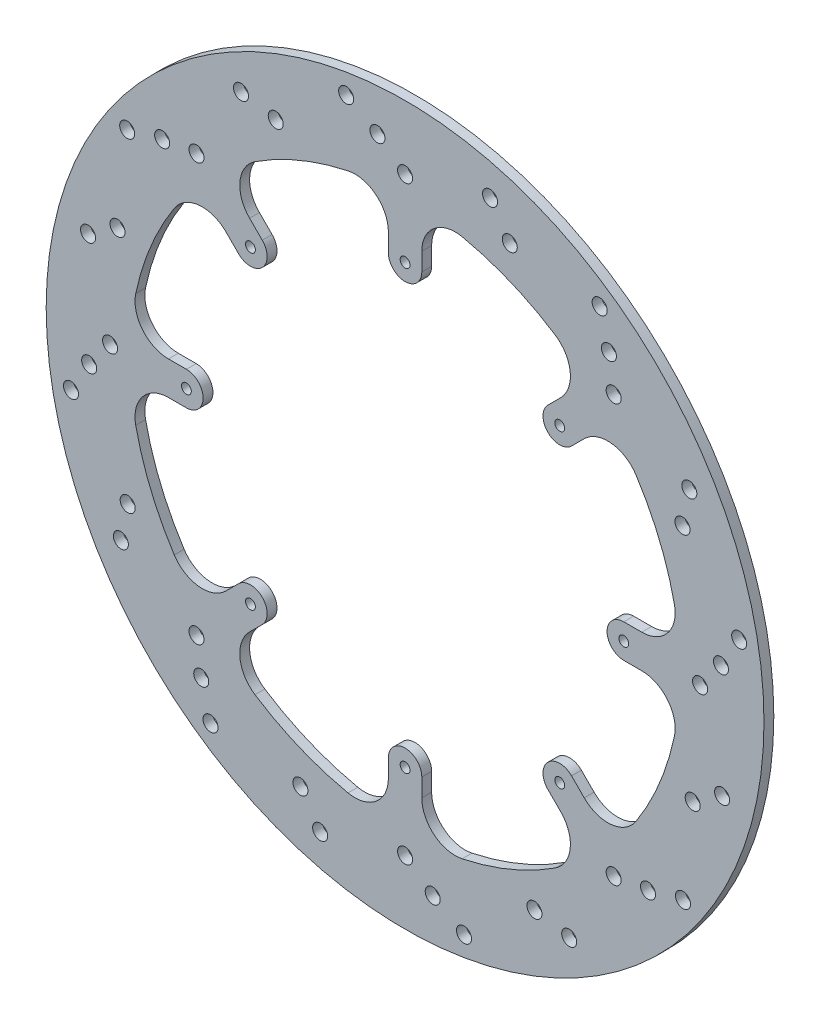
ISO-10303-21;
HEADER;
FILE_DESCRIPTION(('STEP AP214'),'2;1');
FILE_NAME('part.step','',(''),(''),'','','');
FILE_SCHEMA(('AUTOMOTIVE_DESIGN { 1 0 10303 214 1 1 1 1 }'));
ENDSEC;
DATA;
#1=APPLICATION_CONTEXT('core data for automotive mechanical design processes');
#2=APPLICATION_PROTOCOL_DEFINITION('international standard','automotive_design',2000,#1);
#3=PRODUCT_CONTEXT('',#1,'mechanical');
#4=PRODUCT('Part','Part','',(#3));
#5=PRODUCT_RELATED_PRODUCT_CATEGORY('part','',(#4));
#6=PRODUCT_DEFINITION_FORMATION('','',#4);
#7=PRODUCT_DEFINITION_CONTEXT('part definition',#1,'design');
#8=PRODUCT_DEFINITION('design','',#6,#7);
#9=PRODUCT_DEFINITION_SHAPE('','',#8);
#10=(LENGTH_UNIT() NAMED_UNIT(*) SI_UNIT(.MILLI.,.METRE.));
#11=(NAMED_UNIT(*) PLANE_ANGLE_UNIT() SI_UNIT($,.RADIAN.));
#12=(NAMED_UNIT(*) SI_UNIT($,.STERADIAN.) SOLID_ANGLE_UNIT());
#13=UNCERTAINTY_MEASURE_WITH_UNIT(LENGTH_MEASURE(1.E-05),#10,'distance_accuracy_value','');
#14=(GEOMETRIC_REPRESENTATION_CONTEXT(3) GLOBAL_UNCERTAINTY_ASSIGNED_CONTEXT((#13)) GLOBAL_UNIT_ASSIGNED_CONTEXT((#10,
#11,#12)) REPRESENTATION_CONTEXT('',''));
#15=CARTESIAN_POINT('',(0.,0.,0.));
#16=DIRECTION('',(0.,0.,1.));
#17=DIRECTION('',(1.,0.,0.));
#18=AXIS2_PLACEMENT_3D('',#15,#16,#17);
#19=CARTESIAN_POINT('',(0.,0.,3.175));
#20=DIRECTION('',(0.,0.,-1.));
#21=DIRECTION('',(-1.,0.,0.));
#22=AXIS2_PLACEMENT_3D('',#19,#20,#21);
#23=CYLINDRICAL_SURFACE('',#22,115.8875);
#24=CARTESIAN_POINT('',(0.,0.,3.175));
#25=DIRECTION('',(0.,0.,1.));
#26=DIRECTION('',(1.,0.,0.));
#27=AXIS2_PLACEMENT_3D('',#24,#25,#26);
#28=CIRCLE('',#27,115.8875);
#29=CARTESIAN_POINT('',(115.8875,0.,3.175));
#30=VERTEX_POINT('',#29);
#31=EDGE_CURVE('E11',#30,#30,#28,.T.);
#32=ORIENTED_EDGE('',*,*,#31,.F.);
#33=EDGE_LOOP('',(#32));
#34=FACE_BOUND('',#33,.T.);
#35=CARTESIAN_POINT('',(0.,0.,0.));
#36=DIRECTION('',(0.,0.,1.));
#37=DIRECTION('',(1.,0.,0.));
#38=AXIS2_PLACEMENT_3D('',#35,#36,#37);
#39=CIRCLE('',#38,115.8875);
#40=CARTESIAN_POINT('',(115.8875,0.,0.));
#41=VERTEX_POINT('',#40);
#42=EDGE_CURVE('E37',#41,#41,#39,.T.);
#43=ORIENTED_EDGE('',*,*,#42,.T.);
#44=EDGE_LOOP('',(#43));
#45=FACE_BOUND('',#44,.T.);
#46=ADVANCED_FACE('F34',(#34,#45),#23,.T.);
#47=CARTESIAN_POINT('',(0.,-255.093921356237,3.175));
#48=DIRECTION('',(0.,0.,1.));
#49=DIRECTION('',(1.,0.,0.));
#50=AXIS2_PLACEMENT_3D('',#47,#48,#49);
#51=PLANE('',#50);
#52=CARTESIAN_POINT('',(89.5630348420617,41.7639290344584,3.175));
#53=DIRECTION('',(0.,0.,1.));
#54=DIRECTION('',(0.707106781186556,-0.707106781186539,0.));
#55=AXIS2_PLACEMENT_3D('',#52,#53,#54);
#56=CIRCLE('',#55,2.42569999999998);
#57=CARTESIAN_POINT('',(91.2782637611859,40.0487001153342,3.175));
#58=VERTEX_POINT('',#57);
#59=EDGE_CURVE('E1736',#58,#58,#56,.T.);
#60=ORIENTED_EDGE('',*,*,#59,.F.);
#61=EDGE_LOOP('',(#60));
#62=FACE_BOUND('',#61,.T.);
#63=CARTESIAN_POINT('',(91.7689231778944,52.9828125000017,3.175));
#64=DIRECTION('',(0.,0.,1.));
#65=DIRECTION('',(0.707106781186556,-0.707106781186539,0.));
#66=AXIS2_PLACEMENT_3D('',#63,#64,#65);
#67=CIRCLE('',#66,2.42569999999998);
#68=CARTESIAN_POINT('',(93.4841520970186,51.2675835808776,3.175));
#69=VERTEX_POINT('',#68);
#70=EDGE_CURVE('E1730',#69,#69,#67,.T.);
#71=ORIENTED_EDGE('',*,*,#70,.F.);
#72=EDGE_LOOP('',(#71));
#73=FACE_BOUND('',#72,.T.);
#74=CARTESIAN_POINT('',(62.8281288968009,89.7278670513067,3.175));
#75=DIRECTION('',(0.,0.,1.));
#76=DIRECTION('',(0.707106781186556,-0.707106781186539,0.));
#77=AXIS2_PLACEMENT_3D('',#74,#75,#76);
#78=CIRCLE('',#77,2.4257);
#79=CARTESIAN_POINT('',(64.5433578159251,88.0126381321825,3.175));
#80=VERTEX_POINT('',#79);
#81=EDGE_CURVE('E1724',#80,#80,#78,.T.);
#82=ORIENTED_EDGE('',*,*,#81,.F.);
#83=EDGE_LOOP('',(#82));
#84=FACE_BOUND('',#83,.T.);
#85=CARTESIAN_POINT('',(65.8174338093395,78.4381631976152,3.175));
#86=DIRECTION('',(0.,0.,1.));
#87=DIRECTION('',(0.707106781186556,-0.707106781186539,0.));
#88=AXIS2_PLACEMENT_3D('',#85,#86,#87);
#89=CIRCLE('',#88,2.4257);
#90=CARTESIAN_POINT('',(67.5326627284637,76.722934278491,3.175));
#91=VERTEX_POINT('',#90);
#92=EDGE_CURVE('E1718',#91,#91,#89,.T.);
#93=ORIENTED_EDGE('',*,*,#92,.F.);
#94=EDGE_LOOP('',(#93));
#95=FACE_BOUND('',#94,.T.);
#96=CARTESIAN_POINT('',(67.3519209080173,67.35192090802,3.175));
#97=DIRECTION('',(0.,0.,1.));
#98=DIRECTION('',(0.707106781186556,-0.707106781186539,0.));
#99=AXIS2_PLACEMENT_3D('',#96,#97,#98);
#100=CIRCLE('',#99,2.42569999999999);
#101=CARTESIAN_POINT('',(69.0671498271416,65.6366919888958,3.175));
#102=VERTEX_POINT('',#101);
#103=EDGE_CURVE('E1712',#102,#102,#100,.T.);
#104=ORIENTED_EDGE('',*,*,#103,.F.);
#105=EDGE_LOOP('',(#104));
#106=FACE_BOUND('',#105,.T.);
#107=CARTESIAN_POINT('',(92.862186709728,-33.7990718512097,3.175));
#108=DIRECTION('',(0.,0.,1.));
#109=DIRECTION('',(0.,-1.,0.));
#110=AXIS2_PLACEMENT_3D('',#107,#108,#109);
#111=CIRCLE('',#110,2.42569999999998);
#112=CARTESIAN_POINT('',(92.8621867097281,-36.2247718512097,3.175));
#113=VERTEX_POINT('',#112);
#114=EDGE_CURVE('E1706',#113,#113,#111,.T.);
#115=ORIENTED_EDGE('',*,*,#114,.F.);
#116=EDGE_LOOP('',(#115));
#117=FACE_BOUND('',#116,.T.);
#118=CARTESIAN_POINT('',(102.354933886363,-27.42592187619,3.175));
#119=DIRECTION('',(0.,0.,1.));
#120=DIRECTION('',(0.,-1.,0.));
#121=AXIS2_PLACEMENT_3D('',#118,#119,#120);
#122=CIRCLE('',#121,2.42569999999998);
#123=CARTESIAN_POINT('',(102.354933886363,-29.85162187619,3.175));
#124=VERTEX_POINT('',#123);
#125=EDGE_CURVE('E1700',#124,#124,#122,.T.);
#126=ORIENTED_EDGE('',*,*,#125,.F.);
#127=EDGE_LOOP('',(#126));
#128=FACE_BOUND('',#127,.T.);
#129=CARTESIAN_POINT('',(107.873379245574,19.0209872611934,3.175));
#130=DIRECTION('',(0.,0.,1.));
#131=DIRECTION('',(0.,-1.,0.));
#132=AXIS2_PLACEMENT_3D('',#129,#130,#131);
#133=CIRCLE('',#132,2.4257);
#134=CARTESIAN_POINT('',(107.873379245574,16.5952872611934,3.175));
#135=VERTEX_POINT('',#134);
#136=EDGE_CURVE('E1694',#135,#135,#133,.T.);
#137=ORIENTED_EDGE('',*,*,#136,.F.);
#138=EDGE_LOOP('',(#137));
#139=FACE_BOUND('',#138,.T.);
#140=CARTESIAN_POINT('',(102.004110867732,8.92420333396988,3.175));
#141=DIRECTION('',(0.,0.,1.));
#142=DIRECTION('',(0.,-1.,0.));
#143=AXIS2_PLACEMENT_3D('',#140,#141,#142);
#144=CIRCLE('',#143,2.4257);
#145=CARTESIAN_POINT('',(102.004110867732,6.49850333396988,3.175));
#146=VERTEX_POINT('',#145);
#147=EDGE_CURVE('E1688',#146,#146,#144,.T.);
#148=ORIENTED_EDGE('',*,*,#147,.F.);
#149=EDGE_LOOP('',(#148));
#150=FACE_BOUND('',#149,.T.);
#151=CARTESIAN_POINT('',(95.25,1.70885166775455E-12,3.175));
#152=DIRECTION('',(0.,0.,1.));
#153=DIRECTION('',(0.,-1.,0.));
#154=AXIS2_PLACEMENT_3D('',#151,#152,#153);
#155=CIRCLE('',#154,2.42569999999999);
#156=CARTESIAN_POINT('',(95.25,-2.42569999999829,3.175));
#157=VERTEX_POINT('',#156);
#158=EDGE_CURVE('E1682',#157,#157,#155,.T.);
#159=ORIENTED_EDGE('',*,*,#158,.F.);
#160=EDGE_LOOP('',(#159));
#161=FACE_BOUND('',#160,.T.);
#162=CARTESIAN_POINT('',(41.7639290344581,-89.5630348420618,3.175));
#163=DIRECTION('',(0.,0.,1.));
#164=DIRECTION('',(-0.707106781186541,-0.707106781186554,0.));
#165=AXIS2_PLACEMENT_3D('',#162,#163,#164);
#166=CIRCLE('',#165,2.42569999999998);
#167=CARTESIAN_POINT('',(40.0487001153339,-91.278263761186,3.175));
#168=VERTEX_POINT('',#167);
#169=EDGE_CURVE('E1676',#168,#168,#166,.T.);
#170=ORIENTED_EDGE('',*,*,#169,.F.);
#171=EDGE_LOOP('',(#170));
#172=FACE_BOUND('',#171,.T.);
#173=CARTESIAN_POINT('',(52.9828125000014,-91.7689231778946,3.175));
#174=DIRECTION('',(0.,0.,1.));
#175=DIRECTION('',(-0.707106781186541,-0.707106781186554,0.));
#176=AXIS2_PLACEMENT_3D('',#173,#174,#175);
#177=CIRCLE('',#176,2.42569999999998);
#178=CARTESIAN_POINT('',(51.2675835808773,-93.4841520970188,3.175));
#179=VERTEX_POINT('',#178);
#180=EDGE_CURVE('E1670',#179,#179,#177,.T.);
#181=ORIENTED_EDGE('',*,*,#180,.F.);
#182=EDGE_LOOP('',(#181));
#183=FACE_BOUND('',#182,.T.);
#184=CARTESIAN_POINT('',(89.7278670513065,-62.8281288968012,3.175));
#185=DIRECTION('',(0.,0.,1.));
#186=DIRECTION('',(-0.707106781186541,-0.707106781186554,0.));
#187=AXIS2_PLACEMENT_3D('',#184,#185,#186);
#188=CIRCLE('',#187,2.4257);
#189=CARTESIAN_POINT('',(88.0126381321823,-64.5433578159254,3.175));
#190=VERTEX_POINT('',#189);
#191=EDGE_CURVE('E1664',#190,#190,#188,.T.);
#192=ORIENTED_EDGE('',*,*,#191,.F.);
#193=EDGE_LOOP('',(#192));
#194=FACE_BOUND('',#193,.T.);
#195=CARTESIAN_POINT('',(78.4381631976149,-65.8174338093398,3.175));
#196=DIRECTION('',(0.,0.,1.));
#197=DIRECTION('',(-0.707106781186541,-0.707106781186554,0.));
#198=AXIS2_PLACEMENT_3D('',#195,#196,#197);
#199=CIRCLE('',#198,2.4257);
#200=CARTESIAN_POINT('',(76.7229342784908,-67.532662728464,3.175));
#201=VERTEX_POINT('',#200);
#202=EDGE_CURVE('E1658',#201,#201,#199,.T.);
#203=ORIENTED_EDGE('',*,*,#202,.F.);
#204=EDGE_LOOP('',(#203));
#205=FACE_BOUND('',#204,.T.);
#206=CARTESIAN_POINT('',(67.3519209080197,-67.3519209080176,3.175));
#207=DIRECTION('',(0.,0.,1.));
#208=DIRECTION('',(-0.707106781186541,-0.707106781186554,0.));
#209=AXIS2_PLACEMENT_3D('',#206,#207,#208);
#210=CIRCLE('',#209,2.42569999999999);
#211=CARTESIAN_POINT('',(65.6366919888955,-69.0671498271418,3.175));
#212=VERTEX_POINT('',#211);
#213=EDGE_CURVE('E1652',#212,#212,#210,.T.);
#214=ORIENTED_EDGE('',*,*,#213,.F.);
#215=EDGE_LOOP('',(#214));
#216=FACE_BOUND('',#215,.T.);
#217=CARTESIAN_POINT('',(-33.7990718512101,-92.8621867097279,3.175));
#218=DIRECTION('',(0.,0.,1.));
#219=DIRECTION('',(-1.,0.,0.));
#220=AXIS2_PLACEMENT_3D('',#217,#218,#219);
#221=CIRCLE('',#220,2.42569999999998);
#222=CARTESIAN_POINT('',(-36.22477185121,-92.8621867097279,3.175));
#223=VERTEX_POINT('',#222);
#224=EDGE_CURVE('E1646',#223,#223,#221,.T.);
#225=ORIENTED_EDGE('',*,*,#224,.F.);
#226=EDGE_LOOP('',(#225));
#227=FACE_BOUND('',#226,.T.);
#228=CARTESIAN_POINT('',(-27.4259218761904,-102.354933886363,3.175));
#229=DIRECTION('',(0.,0.,1.));
#230=DIRECTION('',(-1.,0.,0.));
#231=AXIS2_PLACEMENT_3D('',#228,#229,#230);
#232=CIRCLE('',#231,2.42569999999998);
#233=CARTESIAN_POINT('',(-29.8516218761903,-102.354933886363,3.175));
#234=VERTEX_POINT('',#233);
#235=EDGE_CURVE('E1640',#234,#234,#232,.T.);
#236=ORIENTED_EDGE('',*,*,#235,.F.);
#237=EDGE_LOOP('',(#236));
#238=FACE_BOUND('',#237,.T.);
#239=CARTESIAN_POINT('',(19.020987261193,-107.873379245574,3.175));
#240=DIRECTION('',(0.,0.,1.));
#241=DIRECTION('',(-1.,0.,0.));
#242=AXIS2_PLACEMENT_3D('',#239,#240,#241);
#243=CIRCLE('',#242,2.4257);
#244=CARTESIAN_POINT('',(16.595287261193,-107.873379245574,3.175));
#245=VERTEX_POINT('',#244);
#246=EDGE_CURVE('E1634',#245,#245,#243,.T.);
#247=ORIENTED_EDGE('',*,*,#246,.F.);
#248=EDGE_LOOP('',(#247));
#249=FACE_BOUND('',#248,.T.);
#250=CARTESIAN_POINT('',(8.92420333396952,-102.004110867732,3.175));
#251=DIRECTION('',(0.,0.,1.));
#252=DIRECTION('',(-1.,0.,0.));
#253=AXIS2_PLACEMENT_3D('',#250,#251,#252);
#254=CIRCLE('',#253,2.4257);
#255=CARTESIAN_POINT('',(6.49850333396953,-102.004110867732,3.175));
#256=VERTEX_POINT('',#255);
#257=EDGE_CURVE('E1628',#256,#256,#254,.T.);
#258=ORIENTED_EDGE('',*,*,#257,.F.);
#259=EDGE_LOOP('',(#258));
#260=FACE_BOUND('',#259,.T.);
#261=CARTESIAN_POINT('',(1.37628787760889E-12,-95.25,3.175));
#262=DIRECTION('',(0.,0.,1.));
#263=DIRECTION('',(-1.,0.,0.));
#264=AXIS2_PLACEMENT_3D('',#261,#262,#263);
#265=CIRCLE('',#264,2.42569999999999);
#266=CARTESIAN_POINT('',(-2.42569999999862,-95.25,3.175));
#267=VERTEX_POINT('',#266);
#268=EDGE_CURVE('E1622',#267,#267,#265,.T.);
#269=ORIENTED_EDGE('',*,*,#268,.F.);
#270=EDGE_LOOP('',(#269));
#271=FACE_BOUND('',#270,.T.);
#272=CARTESIAN_POINT('',(-89.563034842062,-41.7639290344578,3.175));
#273=DIRECTION('',(0.,0.,1.));
#274=DIRECTION('',(-0.707106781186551,0.707106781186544,0.));
#275=AXIS2_PLACEMENT_3D('',#272,#273,#274);
#276=CIRCLE('',#275,2.42569999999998);
#277=CARTESIAN_POINT('',(-91.2782637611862,-40.0487001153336,3.175));
#278=VERTEX_POINT('',#277);
#279=EDGE_CURVE('E1616',#278,#278,#276,.T.);
#280=ORIENTED_EDGE('',*,*,#279,.F.);
#281=EDGE_LOOP('',(#280));
#282=FACE_BOUND('',#281,.T.);
#283=CARTESIAN_POINT('',(-91.7689231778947,-52.9828125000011,3.175));
#284=DIRECTION('',(0.,0.,1.));
#285=DIRECTION('',(-0.707106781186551,0.707106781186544,0.));
#286=AXIS2_PLACEMENT_3D('',#283,#284,#285);
#287=CIRCLE('',#286,2.42569999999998);
#288=CARTESIAN_POINT('',(-93.4841520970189,-51.2675835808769,3.175));
#289=VERTEX_POINT('',#288);
#290=EDGE_CURVE('E1610',#289,#289,#287,.T.);
#291=ORIENTED_EDGE('',*,*,#290,.F.);
#292=EDGE_LOOP('',(#291));
#293=FACE_BOUND('',#292,.T.);
#294=CARTESIAN_POINT('',(-62.8281288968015,-89.7278670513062,3.175));
#295=DIRECTION('',(0.,0.,1.));
#296=DIRECTION('',(-0.707106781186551,0.707106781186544,0.));
#297=AXIS2_PLACEMENT_3D('',#294,#295,#296);
#298=CIRCLE('',#297,2.4257);
#299=CARTESIAN_POINT('',(-64.5433578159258,-88.0126381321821,3.175));
#300=VERTEX_POINT('',#299);
#301=EDGE_CURVE('E1604',#300,#300,#298,.T.);
#302=ORIENTED_EDGE('',*,*,#301,.F.);
#303=EDGE_LOOP('',(#302));
#304=FACE_BOUND('',#303,.T.);
#305=CARTESIAN_POINT('',(-65.8174338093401,-78.4381631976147,3.175));
#306=DIRECTION('',(0.,0.,1.));
#307=DIRECTION('',(-0.707106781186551,0.707106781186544,0.));
#308=AXIS2_PLACEMENT_3D('',#305,#306,#307);
#309=CIRCLE('',#308,2.4257);
#310=CARTESIAN_POINT('',(-67.5326627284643,-76.7229342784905,3.175));
#311=VERTEX_POINT('',#310);
#312=EDGE_CURVE('E1598',#311,#311,#309,.T.);
#313=ORIENTED_EDGE('',*,*,#312,.F.);
#314=EDGE_LOOP('',(#313));
#315=FACE_BOUND('',#314,.T.);
#316=CARTESIAN_POINT('',(-67.3519209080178,-67.3519209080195,3.175));
#317=DIRECTION('',(0.,0.,1.));
#318=DIRECTION('',(-0.707106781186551,0.707106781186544,0.));
#319=AXIS2_PLACEMENT_3D('',#316,#317,#318);
#320=CIRCLE('',#319,2.42569999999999);
#321=CARTESIAN_POINT('',(-69.067149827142,-65.6366919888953,3.175));
#322=VERTEX_POINT('',#321);
#323=EDGE_CURVE('E1592',#322,#322,#320,.T.);
#324=ORIENTED_EDGE('',*,*,#323,.F.);
#325=EDGE_LOOP('',(#324));
#326=FACE_BOUND('',#325,.T.);
#327=CARTESIAN_POINT('',(-92.8621867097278,33.7990718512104,3.175));
#328=DIRECTION('',(0.,0.,1.));
#329=DIRECTION('',(0.,1.,0.));
#330=AXIS2_PLACEMENT_3D('',#327,#328,#329);
#331=CIRCLE('',#330,2.42569999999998);
#332=CARTESIAN_POINT('',(-92.8621867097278,36.2247718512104,3.175));
#333=VERTEX_POINT('',#332);
#334=EDGE_CURVE('E1586',#333,#333,#331,.T.);
#335=ORIENTED_EDGE('',*,*,#334,.F.);
#336=EDGE_LOOP('',(#335));
#337=FACE_BOUND('',#336,.T.);
#338=CARTESIAN_POINT('',(-102.354933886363,27.4259218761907,3.175));
#339=DIRECTION('',(0.,0.,1.));
#340=DIRECTION('',(0.,1.,0.));
#341=AXIS2_PLACEMENT_3D('',#338,#339,#340);
#342=CIRCLE('',#341,2.42569999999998);
#343=CARTESIAN_POINT('',(-102.354933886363,29.8516218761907,3.175));
#344=VERTEX_POINT('',#343);
#345=EDGE_CURVE('E1580',#344,#344,#342,.T.);
#346=ORIENTED_EDGE('',*,*,#345,.F.);
#347=EDGE_LOOP('',(#346));
#348=FACE_BOUND('',#347,.T.);
#349=CARTESIAN_POINT('',(-107.873379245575,-19.0209872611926,3.175));
#350=DIRECTION('',(0.,0.,1.));
#351=DIRECTION('',(0.,1.,0.));
#352=AXIS2_PLACEMENT_3D('',#349,#350,#351);
#353=CIRCLE('',#352,2.4257);
#354=CARTESIAN_POINT('',(-107.873379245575,-16.5952872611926,3.175));
#355=VERTEX_POINT('',#354);
#356=EDGE_CURVE('E1574',#355,#355,#353,.T.);
#357=ORIENTED_EDGE('',*,*,#356,.F.);
#358=EDGE_LOOP('',(#357));
#359=FACE_BOUND('',#358,.T.);
#360=CARTESIAN_POINT('',(-102.004110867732,-8.92420333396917,3.175));
#361=DIRECTION('',(0.,0.,1.));
#362=DIRECTION('',(0.,1.,0.));
#363=AXIS2_PLACEMENT_3D('',#360,#361,#362);
#364=CIRCLE('',#363,2.4257);
#365=CARTESIAN_POINT('',(-102.004110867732,-6.49850333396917,3.175));
#366=VERTEX_POINT('',#365);
#367=EDGE_CURVE('E1568',#366,#366,#364,.T.);
#368=ORIENTED_EDGE('',*,*,#367,.F.);
#369=EDGE_LOOP('',(#368));
#370=FACE_BOUND('',#369,.T.);
#371=CARTESIAN_POINT('',(-95.25,-1.04372408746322E-12,3.175));
#372=DIRECTION('',(0.,0.,1.));
#373=DIRECTION('',(0.,1.,0.));
#374=AXIS2_PLACEMENT_3D('',#371,#372,#373);
#375=CIRCLE('',#374,2.42569999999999);
#376=CARTESIAN_POINT('',(-95.25,2.42569999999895,3.175));
#377=VERTEX_POINT('',#376);
#378=EDGE_CURVE('E1562',#377,#377,#375,.T.);
#379=ORIENTED_EDGE('',*,*,#378,.F.);
#380=EDGE_LOOP('',(#379));
#381=FACE_BOUND('',#380,.T.);
#382=CARTESIAN_POINT('',(-41.7639290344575,89.5630348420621,3.175));
#383=DIRECTION('',(0.,0.,1.));
#384=DIRECTION('',(0.707106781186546,0.707106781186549,0.));
#385=AXIS2_PLACEMENT_3D('',#382,#383,#384);
#386=CIRCLE('',#385,2.42569999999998);
#387=CARTESIAN_POINT('',(-40.0487001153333,91.2782637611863,3.175));
#388=VERTEX_POINT('',#387);
#389=EDGE_CURVE('E1556',#388,#388,#386,.T.);
#390=ORIENTED_EDGE('',*,*,#389,.F.);
#391=EDGE_LOOP('',(#390));
#392=FACE_BOUND('',#391,.T.);
#393=CARTESIAN_POINT('',(-52.9828125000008,91.7689231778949,3.175));
#394=DIRECTION('',(0.,0.,1.));
#395=DIRECTION('',(0.707106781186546,0.707106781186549,0.));
#396=AXIS2_PLACEMENT_3D('',#393,#394,#395);
#397=CIRCLE('',#396,2.42569999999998);
#398=CARTESIAN_POINT('',(-51.2675835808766,93.4841520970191,3.175));
#399=VERTEX_POINT('',#398);
#400=EDGE_CURVE('E1550',#399,#399,#397,.T.);
#401=ORIENTED_EDGE('',*,*,#400,.F.);
#402=EDGE_LOOP('',(#401));
#403=FACE_BOUND('',#402,.T.);
#404=CARTESIAN_POINT('',(-89.727867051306,62.8281288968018,3.175));
#405=DIRECTION('',(0.,0.,1.));
#406=DIRECTION('',(0.707106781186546,0.707106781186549,0.));
#407=AXIS2_PLACEMENT_3D('',#404,#405,#406);
#408=CIRCLE('',#407,2.4257);
#409=CARTESIAN_POINT('',(-88.0126381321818,64.543357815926,3.175));
#410=VERTEX_POINT('',#409);
#411=EDGE_CURVE('E1544',#410,#410,#408,.T.);
#412=ORIENTED_EDGE('',*,*,#411,.F.);
#413=EDGE_LOOP('',(#412));
#414=FACE_BOUND('',#413,.T.);
#415=CARTESIAN_POINT('',(-78.4381631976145,65.8174338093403,3.175));
#416=DIRECTION('',(0.,0.,1.));
#417=DIRECTION('',(0.707106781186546,0.707106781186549,0.));
#418=AXIS2_PLACEMENT_3D('',#415,#416,#417);
#419=CIRCLE('',#418,2.4257);
#420=CARTESIAN_POINT('',(-76.7229342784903,67.5326627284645,3.175));
#421=VERTEX_POINT('',#420);
#422=EDGE_CURVE('E1538',#421,#421,#419,.T.);
#423=ORIENTED_EDGE('',*,*,#422,.F.);
#424=EDGE_LOOP('',(#423));
#425=FACE_BOUND('',#424,.T.);
#426=CARTESIAN_POINT('',(-67.3519209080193,67.351920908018,3.175));
#427=DIRECTION('',(0.,0.,1.));
#428=DIRECTION('',(0.707106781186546,0.707106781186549,0.));
#429=AXIS2_PLACEMENT_3D('',#426,#427,#428);
#430=CIRCLE('',#429,2.42569999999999);
#431=CARTESIAN_POINT('',(-65.6366919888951,69.0671498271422,3.175));
#432=VERTEX_POINT('',#431);
#433=EDGE_CURVE('E1532',#432,#432,#430,.T.);
#434=ORIENTED_EDGE('',*,*,#433,.F.);
#435=EDGE_LOOP('',(#434));
#436=FACE_BOUND('',#435,.T.);
#437=CARTESIAN_POINT('',(33.7990718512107,92.8621867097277,3.175));
#438=DIRECTION('',(0.,0.,1.));
#439=DIRECTION('',(1.,0.,0.));
#440=AXIS2_PLACEMENT_3D('',#437,#438,#439);
#441=CIRCLE('',#440,2.42569999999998);
#442=CARTESIAN_POINT('',(36.2247718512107,92.8621867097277,3.175));
#443=VERTEX_POINT('',#442);
#444=EDGE_CURVE('E1526',#443,#443,#441,.T.);
#445=ORIENTED_EDGE('',*,*,#444,.F.);
#446=EDGE_LOOP('',(#445));
#447=FACE_BOUND('',#446,.T.);
#448=CARTESIAN_POINT('',(27.4259218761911,102.354933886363,3.175));
#449=DIRECTION('',(0.,0.,1.));
#450=DIRECTION('',(1.,0.,0.));
#451=AXIS2_PLACEMENT_3D('',#448,#449,#450);
#452=CIRCLE('',#451,2.42569999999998);
#453=CARTESIAN_POINT('',(29.8516218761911,102.354933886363,3.175));
#454=VERTEX_POINT('',#453);
#455=EDGE_CURVE('E1520',#454,#454,#452,.T.);
#456=ORIENTED_EDGE('',*,*,#455,.F.);
#457=EDGE_LOOP('',(#456));
#458=FACE_BOUND('',#457,.T.);
#459=CARTESIAN_POINT('',(-19.0209872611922,107.873379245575,3.175));
#460=DIRECTION('',(0.,0.,1.));
#461=DIRECTION('',(1.,0.,0.));
#462=AXIS2_PLACEMENT_3D('',#459,#460,#461);
#463=CIRCLE('',#462,2.4257);
#464=CARTESIAN_POINT('',(-16.5952872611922,107.873379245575,3.175));
#465=VERTEX_POINT('',#464);
#466=EDGE_CURVE('E1514',#465,#465,#463,.T.);
#467=ORIENTED_EDGE('',*,*,#466,.F.);
#468=EDGE_LOOP('',(#467));
#469=FACE_BOUND('',#468,.T.);
#470=CARTESIAN_POINT('',(-8.92420333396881,102.004110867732,3.175));
#471=DIRECTION('',(0.,0.,1.));
#472=DIRECTION('',(1.,0.,0.));
#473=AXIS2_PLACEMENT_3D('',#470,#471,#472);
#474=CIRCLE('',#473,2.4257);
#475=CARTESIAN_POINT('',(-6.49850333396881,102.004110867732,3.175));
#476=VERTEX_POINT('',#475);
#477=EDGE_CURVE('E1508',#476,#476,#474,.T.);
#478=ORIENTED_EDGE('',*,*,#477,.F.);
#479=EDGE_LOOP('',(#478));
#480=FACE_BOUND('',#479,.T.);
#481=CARTESIAN_POINT('',(-7.11160297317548E-13,95.25,3.175));
#482=DIRECTION('',(0.,0.,1.));
#483=DIRECTION('',(1.,0.,0.));
#484=AXIS2_PLACEMENT_3D('',#481,#482,#483);
#485=CIRCLE('',#484,2.42569999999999);
#486=CARTESIAN_POINT('',(2.42569999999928,95.25,3.175));
#487=VERTEX_POINT('',#486);
#488=EDGE_CURVE('E1502',#487,#487,#485,.T.);
#489=ORIENTED_EDGE('',*,*,#488,.F.);
#490=EDGE_LOOP('',(#489));
#491=FACE_BOUND('',#490,.T.);
#492=CARTESIAN_POINT('',(49.9302240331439,49.9302240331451,3.175));
#493=DIRECTION('',(0.,0.,1.));
#494=DIRECTION('',(0.707106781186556,-0.707106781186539,0.));
#495=AXIS2_PLACEMENT_3D('',#492,#493,#494);
#496=CIRCLE('',#495,1.5875);
#497=CARTESIAN_POINT('',(51.0527560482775,48.8076920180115,3.175));
#498=VERTEX_POINT('',#497);
#499=EDGE_CURVE('E1496',#498,#498,#496,.T.);
#500=ORIENTED_EDGE('',*,*,#499,.F.);
#501=EDGE_LOOP('',(#500));
#502=FACE_BOUND('',#501,.T.);
#503=CARTESIAN_POINT('',(70.612,7.39621869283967E-13,3.175));
#504=DIRECTION('',(0.,0.,1.));
#505=DIRECTION('',(0.,-1.,0.));
#506=AXIS2_PLACEMENT_3D('',#503,#504,#505);
#507=CIRCLE('',#506,1.5875);
#508=CARTESIAN_POINT('',(70.612,-1.58749999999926,3.175));
#509=VERTEX_POINT('',#508);
#510=EDGE_CURVE('E1490',#509,#509,#507,.T.);
#511=ORIENTED_EDGE('',*,*,#510,.F.);
#512=EDGE_LOOP('',(#511));
#513=FACE_BOUND('',#512,.T.);
#514=CARTESIAN_POINT('',(49.9302240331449,-49.9302240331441,3.175));
#515=DIRECTION('',(0.,0.,1.));
#516=DIRECTION('',(-0.707106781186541,-0.707106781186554,0.));
#517=AXIS2_PLACEMENT_3D('',#514,#515,#516);
#518=CIRCLE('',#517,1.5875);
#519=CARTESIAN_POINT('',(48.8076920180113,-51.0527560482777,3.175));
#520=VERTEX_POINT('',#519);
#521=EDGE_CURVE('E1484',#520,#520,#518,.T.);
#522=ORIENTED_EDGE('',*,*,#521,.F.);
#523=EDGE_LOOP('',(#522));
#524=FACE_BOUND('',#523,.T.);
#525=CARTESIAN_POINT('',(4.93081246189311E-13,-70.612,3.175));
#526=DIRECTION('',(0.,0.,1.));
#527=DIRECTION('',(-1.,0.,0.));
#528=AXIS2_PLACEMENT_3D('',#525,#526,#527);
#529=CIRCLE('',#528,1.5875);
#530=CARTESIAN_POINT('',(-1.58749999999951,-70.612,3.175));
#531=VERTEX_POINT('',#530);
#532=EDGE_CURVE('E1478',#531,#531,#529,.T.);
#533=ORIENTED_EDGE('',*,*,#532,.F.);
#534=EDGE_LOOP('',(#533));
#535=FACE_BOUND('',#534,.T.);
#536=CARTESIAN_POINT('',(-49.9302240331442,-49.9302240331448,3.175));
#537=DIRECTION('',(0.,0.,1.));
#538=DIRECTION('',(-0.707106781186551,0.707106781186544,0.));
#539=AXIS2_PLACEMENT_3D('',#536,#537,#538);
#540=CIRCLE('',#539,1.5875);
#541=CARTESIAN_POINT('',(-51.0527560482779,-48.8076920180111,3.175));
#542=VERTEX_POINT('',#541);
#543=EDGE_CURVE('E1472',#542,#542,#540,.T.);
#544=ORIENTED_EDGE('',*,*,#543,.F.);
#545=EDGE_LOOP('',(#544));
#546=FACE_BOUND('',#545,.T.);
#547=CARTESIAN_POINT('',(-70.612,-2.46540623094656E-13,3.175));
#548=DIRECTION('',(0.,0.,1.));
#549=DIRECTION('',(0.,1.,0.));
#550=AXIS2_PLACEMENT_3D('',#547,#548,#549);
#551=CIRCLE('',#550,1.5875);
#552=CARTESIAN_POINT('',(-70.612,1.58749999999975,3.175));
#553=VERTEX_POINT('',#552);
#554=EDGE_CURVE('E1466',#553,#553,#551,.T.);
#555=ORIENTED_EDGE('',*,*,#554,.F.);
#556=EDGE_LOOP('',(#555));
#557=FACE_BOUND('',#556,.T.);
#558=CARTESIAN_POINT('',(-42.5788416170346,65.4784947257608,3.175));
#559=DIRECTION('',(0.,0.,1.));
#560=DIRECTION('',(0.707106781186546,0.707106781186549,0.));
#561=AXIS2_PLACEMENT_3D('',#558,#559,#560);
#562=CIRCLE('',#561,10.795);
#563=CARTESIAN_POINT('',(-48.4637221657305,74.5283679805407,3.175));
#564=VERTEX_POINT('',#563);
#565=CARTESIAN_POINT('',(-50.2120593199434,57.845277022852,3.175));
#566=VERTEX_POINT('',#565);
#567=EDGE_CURVE('E621',#564,#566,#562,.T.);
#568=ORIENTED_EDGE('',*,*,#567,.F.);
#569=CARTESIAN_POINT('',(0.,0.,3.175));
#570=DIRECTION('',(0.,0.,1.));
#571=DIRECTION('',(1.,0.,0.));
#572=AXIS2_PLACEMENT_3D('',#569,#570,#571);
#573=CIRCLE('',#572,88.9);
#574=CARTESIAN_POINT('',(-18.430487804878,86.9685409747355,3.175));
#575=VERTEX_POINT('',#574);
#576=EDGE_CURVE('E669',#575,#564,#573,.T.);
#577=ORIENTED_EDGE('',*,*,#576,.F.);
#578=CARTESIAN_POINT('',(-16.1925,76.4080752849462,3.175));
#579=DIRECTION('',(0.,0.,1.));
#580=DIRECTION('',(1.,0.,0.));
#581=AXIS2_PLACEMENT_3D('',#578,#579,#580);
#582=CIRCLE('',#581,10.795);
#583=CARTESIAN_POINT('',(-5.3975,76.4080752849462,3.175));
#584=VERTEX_POINT('',#583);
#585=EDGE_CURVE('E666',#584,#575,#582,.T.);
#586=ORIENTED_EDGE('',*,*,#585,.F.);
#587=DIRECTION('',(0.,1.,0.));
#588=VECTOR('',#587,1.);
#589=CARTESIAN_POINT('',(-5.3975,76.4080752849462,3.175));
#590=LINE('',#589,#588);
#591=CARTESIAN_POINT('',(-5.3975,70.612,3.175));
#592=VERTEX_POINT('',#591);
#593=EDGE_CURVE('E663',#592,#584,#590,.T.);
#594=ORIENTED_EDGE('',*,*,#593,.F.);
#595=CARTESIAN_POINT('',(0.,70.612,3.175));
#596=DIRECTION('',(0.,0.,-1.));
#597=DIRECTION('',(1.,0.,0.));
#598=AXIS2_PLACEMENT_3D('',#595,#596,#597);
#599=CIRCLE('',#598,5.3975);
#600=CARTESIAN_POINT('',(5.3975,70.612,3.175));
#601=VERTEX_POINT('',#600);
#602=EDGE_CURVE('E661',#601,#592,#599,.T.);
#603=ORIENTED_EDGE('',*,*,#602,.F.);
#604=DIRECTION('',(0.,-1.,0.));
#605=VECTOR('',#604,1.);
#606=CARTESIAN_POINT('',(5.3975,76.4080752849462,3.175));
#607=LINE('',#606,#605);
#608=CARTESIAN_POINT('',(5.3975,76.4080752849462,3.175));
#609=VERTEX_POINT('',#608);
#610=EDGE_CURVE('E676',#609,#601,#607,.T.);
#611=ORIENTED_EDGE('',*,*,#610,.F.);
#612=CARTESIAN_POINT('',(16.1925,76.4080752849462,3.175));
#613=DIRECTION('',(0.,0.,1.));
#614=DIRECTION('',(1.,0.,0.));
#615=AXIS2_PLACEMENT_3D('',#612,#613,#614);
#616=CIRCLE('',#615,10.795);
#617=CARTESIAN_POINT('',(18.430487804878,86.9685409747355,3.175));
#618=VERTEX_POINT('',#617);
#619=EDGE_CURVE('E674',#618,#609,#616,.T.);
#620=ORIENTED_EDGE('',*,*,#619,.F.);
#621=CARTESIAN_POINT('',(0.,0.,3.175));
#622=DIRECTION('',(0.,0.,1.));
#623=DIRECTION('',(1.,0.,0.));
#624=AXIS2_PLACEMENT_3D('',#621,#622,#623);
#625=CIRCLE('',#624,88.9);
#626=CARTESIAN_POINT('',(48.4637221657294,74.5283679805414,3.175));
#627=VERTEX_POINT('',#626);
#628=EDGE_CURVE('E671',#627,#618,#625,.T.);
#629=ORIENTED_EDGE('',*,*,#628,.F.);
#630=CARTESIAN_POINT('',(42.5788416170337,65.4784947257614,3.175));
#631=DIRECTION('',(0.,0.,1.));
#632=DIRECTION('',(0.707106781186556,-0.707106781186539,0.));
#633=AXIS2_PLACEMENT_3D('',#630,#631,#632);
#634=CIRCLE('',#633,10.795);
#635=CARTESIAN_POINT('',(50.2120593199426,57.8452770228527,3.175));
#636=VERTEX_POINT('',#635);
#637=EDGE_CURVE('E366',#636,#627,#634,.T.);
#638=ORIENTED_EDGE('',*,*,#637,.F.);
#639=DIRECTION('',(0.707106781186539,0.707106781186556,0.));
#640=VECTOR('',#639,1.);
#641=CARTESIAN_POINT('',(50.2120593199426,57.8452770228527,3.175));
#642=LINE('',#641,#640);
#643=CARTESIAN_POINT('',(46.1136151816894,53.7468328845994,3.175));
#644=VERTEX_POINT('',#643);
#645=EDGE_CURVE('E343',#644,#636,#642,.T.);
#646=ORIENTED_EDGE('',*,*,#645,.F.);
#647=CARTESIAN_POINT('',(49.9302240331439,49.9302240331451,3.175));
#648=DIRECTION('',(0.,0.,-1.));
#649=DIRECTION('',(0.707106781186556,-0.707106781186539,0.));
#650=AXIS2_PLACEMENT_3D('',#647,#648,#649);
#651=CIRCLE('',#650,5.3975);
#652=CARTESIAN_POINT('',(53.7468328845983,46.1136151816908,3.175));
#653=VERTEX_POINT('',#652);
#654=EDGE_CURVE('E354',#653,#644,#651,.T.);
#655=ORIENTED_EDGE('',*,*,#654,.F.);
#656=DIRECTION('',(-0.707106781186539,-0.707106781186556,0.));
#657=VECTOR('',#656,1.);
#658=CARTESIAN_POINT('',(57.8452770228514,50.212059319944,3.175));
#659=LINE('',#658,#657);
#660=CARTESIAN_POINT('',(57.8452770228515,50.212059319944,3.175));
#661=VERTEX_POINT('',#660);
#662=EDGE_CURVE('E351',#661,#653,#659,.T.);
#663=ORIENTED_EDGE('',*,*,#662,.F.);
#664=CARTESIAN_POINT('',(65.4784947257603,42.5788416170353,3.175));
#665=DIRECTION('',(0.,0.,1.));
#666=DIRECTION('',(0.707106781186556,-0.707106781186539,0.));
#667=AXIS2_PLACEMENT_3D('',#664,#665,#666);
#668=CIRCLE('',#667,10.795);
#669=CARTESIAN_POINT('',(74.5283679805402,48.4637221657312,3.175));
#670=VERTEX_POINT('',#669);
#671=EDGE_CURVE('E368',#670,#661,#668,.T.);
#672=ORIENTED_EDGE('',*,*,#671,.F.);
#673=CARTESIAN_POINT('',(0.,0.,3.175));
#674=DIRECTION('',(0.,0.,1.));
#675=DIRECTION('',(0.,-1.,0.));
#676=AXIS2_PLACEMENT_3D('',#673,#674,#675);
#677=CIRCLE('',#676,88.9);
#678=CARTESIAN_POINT('',(86.9685409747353,18.430487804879,3.175));
#679=VERTEX_POINT('',#678);
#680=EDGE_CURVE('E405',#679,#670,#677,.T.);
#681=ORIENTED_EDGE('',*,*,#680,.F.);
#682=CARTESIAN_POINT('',(76.408075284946,16.1925000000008,3.175));
#683=DIRECTION('',(0.,0.,1.));
#684=DIRECTION('',(0.,-1.,0.));
#685=AXIS2_PLACEMENT_3D('',#682,#683,#684);
#686=CIRCLE('',#685,10.795);
#687=CARTESIAN_POINT('',(76.4080752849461,5.3975000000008,3.175));
#688=VERTEX_POINT('',#687);
#689=EDGE_CURVE('E402',#688,#679,#686,.T.);
#690=ORIENTED_EDGE('',*,*,#689,.F.);
#691=DIRECTION('',(1.,0.,0.));
#692=VECTOR('',#691,1.);
#693=CARTESIAN_POINT('',(76.4080752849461,5.3975000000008,3.175));
#694=LINE('',#693,#692);
#695=CARTESIAN_POINT('',(70.6119999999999,5.39750000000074,3.175));
#696=VERTEX_POINT('',#695);
#697=EDGE_CURVE('E399',#696,#688,#694,.T.);
#698=ORIENTED_EDGE('',*,*,#697,.F.);
#699=CARTESIAN_POINT('',(70.612,7.39621869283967E-13,3.175));
#700=DIRECTION('',(0.,0.,-1.));
#701=DIRECTION('',(0.,-1.,0.));
#702=AXIS2_PLACEMENT_3D('',#699,#700,#701);
#703=CIRCLE('',#702,5.3975);
#704=CARTESIAN_POINT('',(70.6120000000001,-5.39749999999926,3.175));
#705=VERTEX_POINT('',#704);
#706=EDGE_CURVE('E396',#705,#696,#703,.T.);
#707=ORIENTED_EDGE('',*,*,#706,.F.);
#708=DIRECTION('',(-1.,0.,0.));
#709=VECTOR('',#708,1.);
#710=CARTESIAN_POINT('',(76.4080752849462,-5.3974999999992,3.175));
#711=LINE('',#710,#709);
#712=CARTESIAN_POINT('',(76.4080752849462,-5.3974999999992,3.175));
#713=VERTEX_POINT('',#712);
#714=EDGE_CURVE('E410',#713,#705,#711,.T.);
#715=ORIENTED_EDGE('',*,*,#714,.F.);
#716=CARTESIAN_POINT('',(76.4080752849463,-16.1924999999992,3.175));
#717=DIRECTION('',(0.,0.,1.));
#718=DIRECTION('',(0.,-1.,0.));
#719=AXIS2_PLACEMENT_3D('',#716,#717,#718);
#720=CIRCLE('',#719,10.795);
#721=CARTESIAN_POINT('',(86.9685409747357,-18.4304878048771,3.175));
#722=VERTEX_POINT('',#721);
#723=EDGE_CURVE('E407',#722,#713,#720,.T.);
#724=ORIENTED_EDGE('',*,*,#723,.F.);
#725=CARTESIAN_POINT('',(0.,0.,3.175));
#726=DIRECTION('',(0.,0.,1.));
#727=DIRECTION('',(-0.707106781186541,-0.707106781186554,0.));
#728=AXIS2_PLACEMENT_3D('',#725,#726,#727);
#729=CIRCLE('',#728,88.9);
#730=CARTESIAN_POINT('',(74.5283679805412,-48.4637221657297,3.175));
#731=VERTEX_POINT('',#730);
#732=EDGE_CURVE('E447',#731,#722,#729,.T.);
#733=ORIENTED_EDGE('',*,*,#732,.F.);
#734=CARTESIAN_POINT('',(65.4784947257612,-42.5788416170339,3.175));
#735=DIRECTION('',(0.,0.,1.));
#736=DIRECTION('',(-0.707106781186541,-0.707106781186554,0.));
#737=AXIS2_PLACEMENT_3D('',#734,#735,#736);
#738=CIRCLE('',#737,10.795);
#739=CARTESIAN_POINT('',(57.8452770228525,-50.2120593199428,3.175));
#740=VERTEX_POINT('',#739);
#741=EDGE_CURVE('E444',#740,#731,#738,.T.);
#742=ORIENTED_EDGE('',*,*,#741,.F.);
#743=DIRECTION('',(0.707106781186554,-0.707106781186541,0.));
#744=VECTOR('',#743,1.);
#745=CARTESIAN_POINT('',(57.8452770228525,-50.2120593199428,3.175));
#746=LINE('',#745,#744);
#747=CARTESIAN_POINT('',(53.7468328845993,-46.1136151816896,3.175));
#748=VERTEX_POINT('',#747);
#749=EDGE_CURVE('E441',#748,#740,#746,.T.);
#750=ORIENTED_EDGE('',*,*,#749,.F.);
#751=CARTESIAN_POINT('',(49.9302240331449,-49.9302240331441,3.175));
#752=DIRECTION('',(0.,0.,-1.));
#753=DIRECTION('',(-0.707106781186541,-0.707106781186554,0.));
#754=AXIS2_PLACEMENT_3D('',#751,#752,#753);
#755=CIRCLE('',#754,5.3975);
#756=CARTESIAN_POINT('',(46.1136151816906,-53.7468328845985,3.175));
#757=VERTEX_POINT('',#756);
#758=EDGE_CURVE('E438',#757,#748,#755,.T.);
#759=ORIENTED_EDGE('',*,*,#758,.F.);
#760=DIRECTION('',(-0.707106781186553,0.707106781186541,0.));
#761=VECTOR('',#760,1.);
#762=CARTESIAN_POINT('',(50.2120593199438,-57.8452770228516,3.175));
#763=LINE('',#762,#761);
#764=CARTESIAN_POINT('',(50.2120593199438,-57.8452770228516,3.175));
#765=VERTEX_POINT('',#764);
#766=EDGE_CURVE('E452',#765,#757,#763,.T.);
#767=ORIENTED_EDGE('',*,*,#766,.F.);
#768=CARTESIAN_POINT('',(42.5788416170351,-65.4784947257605,3.175));
#769=DIRECTION('',(0.,0.,1.));
#770=DIRECTION('',(-0.707106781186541,-0.707106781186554,0.));
#771=AXIS2_PLACEMENT_3D('',#768,#769,#770);
#772=CIRCLE('',#771,10.795);
#773=CARTESIAN_POINT('',(48.463722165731,-74.5283679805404,3.175));
#774=VERTEX_POINT('',#773);
#775=EDGE_CURVE('E449',#774,#765,#772,.T.);
#776=ORIENTED_EDGE('',*,*,#775,.F.);
#777=CARTESIAN_POINT('',(0.,0.,3.175));
#778=DIRECTION('',(0.,0.,1.));
#779=DIRECTION('',(-1.,0.,0.));
#780=AXIS2_PLACEMENT_3D('',#777,#778,#779);
#781=CIRCLE('',#780,88.9);
#782=CARTESIAN_POINT('',(18.4304878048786,-86.9685409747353,3.175));
#783=VERTEX_POINT('',#782);
#784=EDGE_CURVE('E489',#783,#774,#781,.T.);
#785=ORIENTED_EDGE('',*,*,#784,.F.);
#786=CARTESIAN_POINT('',(16.1925000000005,-76.4080752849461,3.175));
#787=DIRECTION('',(0.,0.,1.));
#788=DIRECTION('',(-1.,0.,0.));
#789=AXIS2_PLACEMENT_3D('',#786,#787,#788);
#790=CIRCLE('',#789,10.795);
#791=CARTESIAN_POINT('',(5.39750000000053,-76.4080752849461,3.175));
#792=VERTEX_POINT('',#791);
#793=EDGE_CURVE('E486',#792,#783,#790,.T.);
#794=ORIENTED_EDGE('',*,*,#793,.F.);
#795=DIRECTION('',(0.,-1.,0.));
#796=VECTOR('',#795,1.);
#797=CARTESIAN_POINT('',(5.39750000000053,-76.4080752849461,3.175));
#798=LINE('',#797,#796);
#799=CARTESIAN_POINT('',(5.39750000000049,-70.612,3.175));
#800=VERTEX_POINT('',#799);
#801=EDGE_CURVE('E483',#800,#792,#798,.T.);
#802=ORIENTED_EDGE('',*,*,#801,.F.);
#803=CARTESIAN_POINT('',(4.93081246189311E-13,-70.612,3.175));
#804=DIRECTION('',(0.,0.,-1.));
#805=DIRECTION('',(-1.,0.,0.));
#806=AXIS2_PLACEMENT_3D('',#803,#804,#805);
#807=CIRCLE('',#806,5.3975);
#808=CARTESIAN_POINT('',(-5.39749999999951,-70.612,3.175));
#809=VERTEX_POINT('',#808);
#810=EDGE_CURVE('E480',#809,#800,#807,.T.);
#811=ORIENTED_EDGE('',*,*,#810,.F.);
#812=DIRECTION('',(0.,1.,0.));
#813=VECTOR('',#812,1.);
#814=CARTESIAN_POINT('',(-5.39749999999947,-76.4080752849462,3.175));
#815=LINE('',#814,#813);
#816=CARTESIAN_POINT('',(-5.39749999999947,-76.4080752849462,3.175));
#817=VERTEX_POINT('',#816);
#818=EDGE_CURVE('E494',#817,#809,#815,.T.);
#819=ORIENTED_EDGE('',*,*,#818,.F.);
#820=CARTESIAN_POINT('',(-16.1924999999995,-76.4080752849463,3.175));
#821=DIRECTION('',(0.,0.,1.));
#822=DIRECTION('',(-1.,0.,0.));
#823=AXIS2_PLACEMENT_3D('',#820,#821,#822);
#824=CIRCLE('',#823,10.795);
#825=CARTESIAN_POINT('',(-18.4304878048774,-86.9685409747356,3.175));
#826=VERTEX_POINT('',#825);
#827=EDGE_CURVE('E491',#826,#817,#824,.T.);
#828=ORIENTED_EDGE('',*,*,#827,.F.);
#829=CARTESIAN_POINT('',(0.,0.,3.175));
#830=DIRECTION('',(0.,0.,1.));
#831=DIRECTION('',(-0.707106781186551,0.707106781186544,0.));
#832=AXIS2_PLACEMENT_3D('',#829,#830,#831);
#833=CIRCLE('',#832,88.9);
#834=CARTESIAN_POINT('',(-48.4637221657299,-74.528367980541,3.175));
#835=VERTEX_POINT('',#834);
#836=EDGE_CURVE('E531',#835,#826,#833,.T.);
#837=ORIENTED_EDGE('',*,*,#836,.F.);
#838=CARTESIAN_POINT('',(-42.5788416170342,-65.4784947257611,3.175));
#839=DIRECTION('',(0.,0.,1.));
#840=DIRECTION('',(-0.707106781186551,0.707106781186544,0.));
#841=AXIS2_PLACEMENT_3D('',#838,#839,#840);
#842=CIRCLE('',#841,10.795);
#843=CARTESIAN_POINT('',(-50.212059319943,-57.8452770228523,3.175));
#844=VERTEX_POINT('',#843);
#845=EDGE_CURVE('E528',#844,#835,#842,.T.);
#846=ORIENTED_EDGE('',*,*,#845,.F.);
#847=DIRECTION('',(-0.707106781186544,-0.707106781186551,0.));
#848=VECTOR('',#847,1.);
#849=CARTESIAN_POINT('',(-50.212059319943,-57.8452770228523,3.175));
#850=LINE('',#849,#848);
#851=CARTESIAN_POINT('',(-46.1136151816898,-53.7468328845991,3.175));
#852=VERTEX_POINT('',#851);
#853=EDGE_CURVE('E525',#852,#844,#850,.T.);
#854=ORIENTED_EDGE('',*,*,#853,.F.);
#855=CARTESIAN_POINT('',(-49.9302240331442,-49.9302240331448,3.175));
#856=DIRECTION('',(0.,0.,-1.));
#857=DIRECTION('',(-0.707106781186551,0.707106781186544,0.));
#858=AXIS2_PLACEMENT_3D('',#855,#856,#857);
#859=CIRCLE('',#858,5.3975);
#860=CARTESIAN_POINT('',(-53.7468328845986,-46.1136151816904,3.175));
#861=VERTEX_POINT('',#860);
#862=EDGE_CURVE('E522',#861,#852,#859,.T.);
#863=ORIENTED_EDGE('',*,*,#862,.F.);
#864=DIRECTION('',(0.707106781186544,0.707106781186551,0.));
#865=VECTOR('',#864,1.);
#866=CARTESIAN_POINT('',(-57.8452770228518,-50.2120593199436,3.175));
#867=LINE('',#866,#865);
#868=CARTESIAN_POINT('',(-57.8452770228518,-50.2120593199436,3.175));
#869=VERTEX_POINT('',#868);
#870=EDGE_CURVE('E536',#869,#861,#867,.T.);
#871=ORIENTED_EDGE('',*,*,#870,.F.);
#872=CARTESIAN_POINT('',(-65.4784947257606,-42.5788416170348,3.175));
#873=DIRECTION('',(0.,0.,1.));
#874=DIRECTION('',(-0.707106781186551,0.707106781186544,0.));
#875=AXIS2_PLACEMENT_3D('',#872,#873,#874);
#876=CIRCLE('',#875,10.795);
#877=CARTESIAN_POINT('',(-74.5283679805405,-48.4637221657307,3.175));
#878=VERTEX_POINT('',#877);
#879=EDGE_CURVE('E533',#878,#869,#876,.T.);
#880=ORIENTED_EDGE('',*,*,#879,.F.);
#881=CARTESIAN_POINT('',(0.,0.,3.175));
#882=DIRECTION('',(0.,0.,1.));
#883=DIRECTION('',(0.,1.,0.));
#884=AXIS2_PLACEMENT_3D('',#881,#882,#883);
#885=CIRCLE('',#884,88.9);
#886=CARTESIAN_POINT('',(-86.9685409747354,-18.4304878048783,3.175));
#887=VERTEX_POINT('',#886);
#888=EDGE_CURVE('E573',#887,#878,#885,.T.);
#889=ORIENTED_EDGE('',*,*,#888,.F.);
#890=CARTESIAN_POINT('',(-76.4080752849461,-16.1925000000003,3.175));
#891=DIRECTION('',(0.,0.,1.));
#892=DIRECTION('',(0.,1.,0.));
#893=AXIS2_PLACEMENT_3D('',#890,#891,#892);
#894=CIRCLE('',#893,10.795);
#895=CARTESIAN_POINT('',(-76.4080752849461,-5.39750000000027,3.175));
#896=VERTEX_POINT('',#895);
#897=EDGE_CURVE('E570',#896,#887,#894,.T.);
#898=ORIENTED_EDGE('',*,*,#897,.F.);
#899=DIRECTION('',(-1.,0.,0.));
#900=VECTOR('',#899,1.);
#901=CARTESIAN_POINT('',(-76.4080752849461,-5.39750000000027,3.175));
#902=LINE('',#901,#900);
#903=CARTESIAN_POINT('',(-70.612,-5.39750000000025,3.175));
#904=VERTEX_POINT('',#903);
#905=EDGE_CURVE('E567',#904,#896,#902,.T.);
#906=ORIENTED_EDGE('',*,*,#905,.F.);
#907=CARTESIAN_POINT('',(-70.612,-2.46540623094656E-13,3.175));
#908=DIRECTION('',(0.,0.,-1.));
#909=DIRECTION('',(0.,1.,0.));
#910=AXIS2_PLACEMENT_3D('',#907,#908,#909);
#911=CIRCLE('',#910,5.3975);
#912=CARTESIAN_POINT('',(-70.612,5.39749999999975,3.175));
#913=VERTEX_POINT('',#912);
#914=EDGE_CURVE('E564',#913,#904,#911,.T.);
#915=ORIENTED_EDGE('',*,*,#914,.F.);
#916=DIRECTION('',(1.,0.,0.));
#917=VECTOR('',#916,1.);
#918=CARTESIAN_POINT('',(-76.4080752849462,5.39749999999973,3.175));
#919=LINE('',#918,#917);
#920=CARTESIAN_POINT('',(-76.4080752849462,5.39749999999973,3.175));
#921=VERTEX_POINT('',#920);
#922=EDGE_CURVE('E578',#921,#913,#919,.T.);
#923=ORIENTED_EDGE('',*,*,#922,.F.);
#924=CARTESIAN_POINT('',(-76.4080752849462,16.1924999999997,3.175));
#925=DIRECTION('',(0.,0.,1.));
#926=DIRECTION('',(0.,1.,0.));
#927=AXIS2_PLACEMENT_3D('',#924,#925,#926);
#928=CIRCLE('',#927,10.795);
#929=CARTESIAN_POINT('',(-86.9685409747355,18.4304878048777,3.175));
#930=VERTEX_POINT('',#929);
#931=EDGE_CURVE('E575',#930,#921,#928,.T.);
#932=ORIENTED_EDGE('',*,*,#931,.F.);
#933=CARTESIAN_POINT('',(0.,0.,3.175));
#934=DIRECTION('',(0.,0.,1.));
#935=DIRECTION('',(0.707106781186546,0.707106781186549,0.));
#936=AXIS2_PLACEMENT_3D('',#933,#934,#935);
#937=CIRCLE('',#936,88.9);
#938=CARTESIAN_POINT('',(-74.5283679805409,48.4637221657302,3.175));
#939=VERTEX_POINT('',#938);
#940=EDGE_CURVE('E619',#939,#930,#937,.T.);
#941=ORIENTED_EDGE('',*,*,#940,.F.);
#942=CARTESIAN_POINT('',(-65.4784947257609,42.5788416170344,3.175));
#943=DIRECTION('',(0.,0.,1.));
#944=DIRECTION('',(0.707106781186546,0.707106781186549,0.));
#945=AXIS2_PLACEMENT_3D('',#942,#943,#944);
#946=CIRCLE('',#945,10.795);
#947=CARTESIAN_POINT('',(-57.8452770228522,50.2120593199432,3.175));
#948=VERTEX_POINT('',#947);
#949=EDGE_CURVE('E616',#948,#939,#946,.T.);
#950=ORIENTED_EDGE('',*,*,#949,.F.);
#951=DIRECTION('',(-0.707106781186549,0.707106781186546,0.));
#952=VECTOR('',#951,1.);
#953=CARTESIAN_POINT('',(-57.8452770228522,50.2120593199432,3.175));
#954=LINE('',#953,#952);
#955=CARTESIAN_POINT('',(-53.746832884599,46.11361518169,3.175));
#956=VERTEX_POINT('',#955);
#957=EDGE_CURVE('E613',#956,#948,#954,.T.);
#958=ORIENTED_EDGE('',*,*,#957,.F.);
#959=CARTESIAN_POINT('',(-49.9302240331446,49.9302240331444,3.175));
#960=DIRECTION('',(0.,0.,-1.));
#961=DIRECTION('',(0.707106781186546,0.707106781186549,0.));
#962=AXIS2_PLACEMENT_3D('',#959,#960,#961);
#963=CIRCLE('',#962,5.3975);
#964=CARTESIAN_POINT('',(-46.1136151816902,53.7468328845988,3.175));
#965=VERTEX_POINT('',#964);
#966=EDGE_CURVE('E610',#965,#956,#963,.T.);
#967=ORIENTED_EDGE('',*,*,#966,.F.);
#968=DIRECTION('',(0.707106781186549,-0.707106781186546,0.));
#969=VECTOR('',#968,1.);
#970=CARTESIAN_POINT('',(-50.2120593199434,57.845277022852,3.175));
#971=LINE('',#970,#969);
#972=EDGE_CURVE('E624',#566,#965,#971,.T.);
#973=ORIENTED_EDGE('',*,*,#972,.F.);
#974=EDGE_LOOP('',(#568,#577,#586,#594,#603,#611,#620,#629,#638,#646,#655,#663,#672,#681,#690,
#698,#707,#715,#724,#733,#742,#750,#759,#767,#776,#785,#794,#802,#811,#819,#828,#837,#846,#854,
#863,#871,#880,#889,#898,#906,#915,#923,#932,#941,#950,#958,#967,#973));
#975=FACE_BOUND('',#974,.T.);
#976=CARTESIAN_POINT('',(-49.9302240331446,49.9302240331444,3.175));
#977=DIRECTION('',(0.,0.,1.));
#978=DIRECTION('',(0.707106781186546,0.707106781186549,0.));
#979=AXIS2_PLACEMENT_3D('',#976,#977,#978);
#980=CIRCLE('',#979,1.5875);
#981=CARTESIAN_POINT('',(-48.8076920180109,51.052756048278,3.175));
#982=VERTEX_POINT('',#981);
#983=EDGE_CURVE('E643',#982,#982,#980,.T.);
#984=ORIENTED_EDGE('',*,*,#983,.F.);
#985=EDGE_LOOP('',(#984));
#986=FACE_BOUND('',#985,.T.);
#987=CARTESIAN_POINT('',(0.,70.612,3.175));
#988=DIRECTION('',(0.,0.,1.));
#989=DIRECTION('',(1.,0.,0.));
#990=AXIS2_PLACEMENT_3D('',#987,#988,#989);
#991=CIRCLE('',#990,1.5875);
#992=CARTESIAN_POINT('',(1.5875,70.612,3.175));
#993=VERTEX_POINT('',#992);
#994=EDGE_CURVE('E690',#993,#993,#991,.T.);
#995=ORIENTED_EDGE('',*,*,#994,.F.);
#996=EDGE_LOOP('',(#995));
#997=FACE_BOUND('',#996,.T.);
#998=ORIENTED_EDGE('',*,*,#31,.T.);
#999=EDGE_LOOP('',(#998));
#1000=FACE_BOUND('',#999,.T.);
#1001=ADVANCED_FACE('F363',(#62,#73,#84,#95,#106,#117,#128,#139,#150,#161,#172,#183,#194,#205,
#216,#227,#238,#249,#260,#271,#282,#293,#304,#315,#326,#337,#348,#359,#370,#381,#392,#403,#414,
#425,#436,#447,#458,#469,#480,#491,#502,#513,#524,#535,#546,#557,#975,#986,#997,#1000),#51,.T.);
#1002=CARTESIAN_POINT('',(0.,-255.093921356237,0.));
#1003=DIRECTION('',(0.,0.,1.));
#1004=DIRECTION('',(1.,0.,0.));
#1005=AXIS2_PLACEMENT_3D('',#1002,#1003,#1004);
#1006=PLANE('',#1005);
#1007=CARTESIAN_POINT('',(89.5630348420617,41.7639290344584,0.));
#1008=DIRECTION('',(0.,0.,1.));
#1009=DIRECTION('',(1.,0.,0.));
#1010=AXIS2_PLACEMENT_3D('',#1007,#1008,#1009);
#1011=CIRCLE('',#1010,2.42569999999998);
#1012=CARTESIAN_POINT('',(91.9887348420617,41.7639290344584,0.));
#1013=VERTEX_POINT('',#1012);
#1014=EDGE_CURVE('E1733',#1013,#1013,#1011,.F.);
#1015=ORIENTED_EDGE('',*,*,#1014,.F.);
#1016=EDGE_LOOP('',(#1015));
#1017=FACE_BOUND('',#1016,.T.);
#1018=CARTESIAN_POINT('',(91.7689231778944,52.9828125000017,0.));
#1019=DIRECTION('',(0.,0.,1.));
#1020=DIRECTION('',(1.,0.,0.));
#1021=AXIS2_PLACEMENT_3D('',#1018,#1019,#1020);
#1022=CIRCLE('',#1021,2.42569999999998);
#1023=CARTESIAN_POINT('',(94.1946231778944,52.9828125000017,0.));
#1024=VERTEX_POINT('',#1023);
#1025=EDGE_CURVE('E1727',#1024,#1024,#1022,.F.);
#1026=ORIENTED_EDGE('',*,*,#1025,.F.);
#1027=EDGE_LOOP('',(#1026));
#1028=FACE_BOUND('',#1027,.T.);
#1029=CARTESIAN_POINT('',(62.8281288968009,89.7278670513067,0.));
#1030=DIRECTION('',(0.,0.,1.));
#1031=DIRECTION('',(1.,0.,0.));
#1032=AXIS2_PLACEMENT_3D('',#1029,#1030,#1031);
#1033=CIRCLE('',#1032,2.4257);
#1034=CARTESIAN_POINT('',(65.2538288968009,89.7278670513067,0.));
#1035=VERTEX_POINT('',#1034);
#1036=EDGE_CURVE('E1721',#1035,#1035,#1033,.F.);
#1037=ORIENTED_EDGE('',*,*,#1036,.F.);
#1038=EDGE_LOOP('',(#1037));
#1039=FACE_BOUND('',#1038,.T.);
#1040=CARTESIAN_POINT('',(65.8174338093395,78.4381631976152,0.));
#1041=DIRECTION('',(0.,0.,1.));
#1042=DIRECTION('',(1.,0.,0.));
#1043=AXIS2_PLACEMENT_3D('',#1040,#1041,#1042);
#1044=CIRCLE('',#1043,2.4257);
#1045=CARTESIAN_POINT('',(68.2431338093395,78.4381631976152,0.));
#1046=VERTEX_POINT('',#1045);
#1047=EDGE_CURVE('E1715',#1046,#1046,#1044,.F.);
#1048=ORIENTED_EDGE('',*,*,#1047,.F.);
#1049=EDGE_LOOP('',(#1048));
#1050=FACE_BOUND('',#1049,.T.);
#1051=CARTESIAN_POINT('',(67.3519209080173,67.35192090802,0.));
#1052=DIRECTION('',(0.,0.,1.));
#1053=DIRECTION('',(1.,0.,0.));
#1054=AXIS2_PLACEMENT_3D('',#1051,#1052,#1053);
#1055=CIRCLE('',#1054,2.42569999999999);
#1056=CARTESIAN_POINT('',(69.7776209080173,67.35192090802,0.));
#1057=VERTEX_POINT('',#1056);
#1058=EDGE_CURVE('E1709',#1057,#1057,#1055,.F.);
#1059=ORIENTED_EDGE('',*,*,#1058,.F.);
#1060=EDGE_LOOP('',(#1059));
#1061=FACE_BOUND('',#1060,.T.);
#1062=CARTESIAN_POINT('',(92.862186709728,-33.7990718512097,0.));
#1063=DIRECTION('',(0.,0.,1.));
#1064=DIRECTION('',(1.,0.,0.));
#1065=AXIS2_PLACEMENT_3D('',#1062,#1063,#1064);
#1066=CIRCLE('',#1065,2.42569999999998);
#1067=CARTESIAN_POINT('',(95.287886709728,-33.7990718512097,0.));
#1068=VERTEX_POINT('',#1067);
#1069=EDGE_CURVE('E1703',#1068,#1068,#1066,.F.);
#1070=ORIENTED_EDGE('',*,*,#1069,.F.);
#1071=EDGE_LOOP('',(#1070));
#1072=FACE_BOUND('',#1071,.T.);
#1073=CARTESIAN_POINT('',(102.354933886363,-27.42592187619,0.));
#1074=DIRECTION('',(0.,0.,1.));
#1075=DIRECTION('',(1.,0.,0.));
#1076=AXIS2_PLACEMENT_3D('',#1073,#1074,#1075);
#1077=CIRCLE('',#1076,2.42569999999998);
#1078=CARTESIAN_POINT('',(104.780633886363,-27.42592187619,0.));
#1079=VERTEX_POINT('',#1078);
#1080=EDGE_CURVE('E1697',#1079,#1079,#1077,.F.);
#1081=ORIENTED_EDGE('',*,*,#1080,.F.);
#1082=EDGE_LOOP('',(#1081));
#1083=FACE_BOUND('',#1082,.T.);
#1084=CARTESIAN_POINT('',(107.873379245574,19.0209872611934,0.));
#1085=DIRECTION('',(0.,0.,1.));
#1086=DIRECTION('',(1.,0.,0.));
#1087=AXIS2_PLACEMENT_3D('',#1084,#1085,#1086);
#1088=CIRCLE('',#1087,2.4257);
#1089=CARTESIAN_POINT('',(110.299079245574,19.0209872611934,0.));
#1090=VERTEX_POINT('',#1089);
#1091=EDGE_CURVE('E1691',#1090,#1090,#1088,.F.);
#1092=ORIENTED_EDGE('',*,*,#1091,.F.);
#1093=EDGE_LOOP('',(#1092));
#1094=FACE_BOUND('',#1093,.T.);
#1095=CARTESIAN_POINT('',(102.004110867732,8.92420333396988,0.));
#1096=DIRECTION('',(0.,0.,1.));
#1097=DIRECTION('',(1.,0.,0.));
#1098=AXIS2_PLACEMENT_3D('',#1095,#1096,#1097);
#1099=CIRCLE('',#1098,2.4257);
#1100=CARTESIAN_POINT('',(104.429810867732,8.92420333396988,0.));
#1101=VERTEX_POINT('',#1100);
#1102=EDGE_CURVE('E1685',#1101,#1101,#1099,.F.);
#1103=ORIENTED_EDGE('',*,*,#1102,.F.);
#1104=EDGE_LOOP('',(#1103));
#1105=FACE_BOUND('',#1104,.T.);
#1106=CARTESIAN_POINT('',(95.25,1.70885166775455E-12,0.));
#1107=DIRECTION('',(0.,0.,1.));
#1108=DIRECTION('',(1.,0.,0.));
#1109=AXIS2_PLACEMENT_3D('',#1106,#1107,#1108);
#1110=CIRCLE('',#1109,2.42569999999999);
#1111=CARTESIAN_POINT('',(97.6757,1.70885166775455E-12,0.));
#1112=VERTEX_POINT('',#1111);
#1113=EDGE_CURVE('E1679',#1112,#1112,#1110,.F.);
#1114=ORIENTED_EDGE('',*,*,#1113,.F.);
#1115=EDGE_LOOP('',(#1114));
#1116=FACE_BOUND('',#1115,.T.);
#1117=CARTESIAN_POINT('',(41.7639290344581,-89.5630348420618,0.));
#1118=DIRECTION('',(0.,0.,1.));
#1119=DIRECTION('',(1.,0.,0.));
#1120=AXIS2_PLACEMENT_3D('',#1117,#1118,#1119);
#1121=CIRCLE('',#1120,2.42569999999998);
#1122=CARTESIAN_POINT('',(44.1896290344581,-89.5630348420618,0.));
#1123=VERTEX_POINT('',#1122);
#1124=EDGE_CURVE('E1673',#1123,#1123,#1121,.F.);
#1125=ORIENTED_EDGE('',*,*,#1124,.F.);
#1126=EDGE_LOOP('',(#1125));
#1127=FACE_BOUND('',#1126,.T.);
#1128=CARTESIAN_POINT('',(52.9828125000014,-91.7689231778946,0.));
#1129=DIRECTION('',(0.,0.,1.));
#1130=DIRECTION('',(1.,0.,0.));
#1131=AXIS2_PLACEMENT_3D('',#1128,#1129,#1130);
#1132=CIRCLE('',#1131,2.42569999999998);
#1133=CARTESIAN_POINT('',(55.4085125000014,-91.7689231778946,0.));
#1134=VERTEX_POINT('',#1133);
#1135=EDGE_CURVE('E1667',#1134,#1134,#1132,.F.);
#1136=ORIENTED_EDGE('',*,*,#1135,.F.);
#1137=EDGE_LOOP('',(#1136));
#1138=FACE_BOUND('',#1137,.T.);
#1139=CARTESIAN_POINT('',(89.7278670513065,-62.8281288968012,0.));
#1140=DIRECTION('',(0.,0.,1.));
#1141=DIRECTION('',(1.,0.,0.));
#1142=AXIS2_PLACEMENT_3D('',#1139,#1140,#1141);
#1143=CIRCLE('',#1142,2.4257);
#1144=CARTESIAN_POINT('',(92.1535670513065,-62.8281288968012,0.));
#1145=VERTEX_POINT('',#1144);
#1146=EDGE_CURVE('E1661',#1145,#1145,#1143,.F.);
#1147=ORIENTED_EDGE('',*,*,#1146,.F.);
#1148=EDGE_LOOP('',(#1147));
#1149=FACE_BOUND('',#1148,.T.);
#1150=CARTESIAN_POINT('',(78.4381631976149,-65.8174338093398,0.));
#1151=DIRECTION('',(0.,0.,1.));
#1152=DIRECTION('',(1.,0.,0.));
#1153=AXIS2_PLACEMENT_3D('',#1150,#1151,#1152);
#1154=CIRCLE('',#1153,2.4257);
#1155=CARTESIAN_POINT('',(80.8638631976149,-65.8174338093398,0.));
#1156=VERTEX_POINT('',#1155);
#1157=EDGE_CURVE('E1655',#1156,#1156,#1154,.F.);
#1158=ORIENTED_EDGE('',*,*,#1157,.F.);
#1159=EDGE_LOOP('',(#1158));
#1160=FACE_BOUND('',#1159,.T.);
#1161=CARTESIAN_POINT('',(67.3519209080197,-67.3519209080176,0.));
#1162=DIRECTION('',(0.,0.,1.));
#1163=DIRECTION('',(1.,0.,0.));
#1164=AXIS2_PLACEMENT_3D('',#1161,#1162,#1163);
#1165=CIRCLE('',#1164,2.42569999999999);
#1166=CARTESIAN_POINT('',(69.7776209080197,-67.3519209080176,0.));
#1167=VERTEX_POINT('',#1166);
#1168=EDGE_CURVE('E1649',#1167,#1167,#1165,.F.);
#1169=ORIENTED_EDGE('',*,*,#1168,.F.);
#1170=EDGE_LOOP('',(#1169));
#1171=FACE_BOUND('',#1170,.T.);
#1172=CARTESIAN_POINT('',(-33.7990718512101,-92.8621867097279,0.));
#1173=DIRECTION('',(0.,0.,1.));
#1174=DIRECTION('',(1.,0.,0.));
#1175=AXIS2_PLACEMENT_3D('',#1172,#1173,#1174);
#1176=CIRCLE('',#1175,2.42569999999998);
#1177=CARTESIAN_POINT('',(-31.3733718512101,-92.8621867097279,0.));
#1178=VERTEX_POINT('',#1177);
#1179=EDGE_CURVE('E1643',#1178,#1178,#1176,.F.);
#1180=ORIENTED_EDGE('',*,*,#1179,.F.);
#1181=EDGE_LOOP('',(#1180));
#1182=FACE_BOUND('',#1181,.T.);
#1183=CARTESIAN_POINT('',(-27.4259218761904,-102.354933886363,0.));
#1184=DIRECTION('',(0.,0.,1.));
#1185=DIRECTION('',(1.,0.,0.));
#1186=AXIS2_PLACEMENT_3D('',#1183,#1184,#1185);
#1187=CIRCLE('',#1186,2.42569999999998);
#1188=CARTESIAN_POINT('',(-25.0002218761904,-102.354933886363,0.));
#1189=VERTEX_POINT('',#1188);
#1190=EDGE_CURVE('E1637',#1189,#1189,#1187,.F.);
#1191=ORIENTED_EDGE('',*,*,#1190,.F.);
#1192=EDGE_LOOP('',(#1191));
#1193=FACE_BOUND('',#1192,.T.);
#1194=CARTESIAN_POINT('',(19.020987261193,-107.873379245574,0.));
#1195=DIRECTION('',(0.,0.,1.));
#1196=DIRECTION('',(1.,0.,0.));
#1197=AXIS2_PLACEMENT_3D('',#1194,#1195,#1196);
#1198=CIRCLE('',#1197,2.4257);
#1199=CARTESIAN_POINT('',(21.446687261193,-107.873379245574,0.));
#1200=VERTEX_POINT('',#1199);
#1201=EDGE_CURVE('E1631',#1200,#1200,#1198,.F.);
#1202=ORIENTED_EDGE('',*,*,#1201,.F.);
#1203=EDGE_LOOP('',(#1202));
#1204=FACE_BOUND('',#1203,.T.);
#1205=CARTESIAN_POINT('',(8.92420333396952,-102.004110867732,0.));
#1206=DIRECTION('',(0.,0.,1.));
#1207=DIRECTION('',(1.,0.,0.));
#1208=AXIS2_PLACEMENT_3D('',#1205,#1206,#1207);
#1209=CIRCLE('',#1208,2.4257);
#1210=CARTESIAN_POINT('',(11.3499033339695,-102.004110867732,0.));
#1211=VERTEX_POINT('',#1210);
#1212=EDGE_CURVE('E1625',#1211,#1211,#1209,.F.);
#1213=ORIENTED_EDGE('',*,*,#1212,.F.);
#1214=EDGE_LOOP('',(#1213));
#1215=FACE_BOUND('',#1214,.T.);
#1216=CARTESIAN_POINT('',(1.37628787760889E-12,-95.25,0.));
#1217=DIRECTION('',(0.,0.,1.));
#1218=DIRECTION('',(1.,0.,0.));
#1219=AXIS2_PLACEMENT_3D('',#1216,#1217,#1218);
#1220=CIRCLE('',#1219,2.42569999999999);
#1221=CARTESIAN_POINT('',(2.42570000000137,-95.25,0.));
#1222=VERTEX_POINT('',#1221);
#1223=EDGE_CURVE('E1619',#1222,#1222,#1220,.F.);
#1224=ORIENTED_EDGE('',*,*,#1223,.F.);
#1225=EDGE_LOOP('',(#1224));
#1226=FACE_BOUND('',#1225,.T.);
#1227=CARTESIAN_POINT('',(-89.563034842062,-41.7639290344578,0.));
#1228=DIRECTION('',(0.,0.,1.));
#1229=DIRECTION('',(1.,0.,0.));
#1230=AXIS2_PLACEMENT_3D('',#1227,#1228,#1229);
#1231=CIRCLE('',#1230,2.42569999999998);
#1232=CARTESIAN_POINT('',(-87.137334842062,-41.7639290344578,0.));
#1233=VERTEX_POINT('',#1232);
#1234=EDGE_CURVE('E1613',#1233,#1233,#1231,.F.);
#1235=ORIENTED_EDGE('',*,*,#1234,.F.);
#1236=EDGE_LOOP('',(#1235));
#1237=FACE_BOUND('',#1236,.T.);
#1238=CARTESIAN_POINT('',(-91.7689231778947,-52.9828125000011,0.));
#1239=DIRECTION('',(0.,0.,1.));
#1240=DIRECTION('',(1.,0.,0.));
#1241=AXIS2_PLACEMENT_3D('',#1238,#1239,#1240);
#1242=CIRCLE('',#1241,2.42569999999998);
#1243=CARTESIAN_POINT('',(-89.3432231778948,-52.9828125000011,0.));
#1244=VERTEX_POINT('',#1243);
#1245=EDGE_CURVE('E1607',#1244,#1244,#1242,.F.);
#1246=ORIENTED_EDGE('',*,*,#1245,.F.);
#1247=EDGE_LOOP('',(#1246));
#1248=FACE_BOUND('',#1247,.T.);
#1249=CARTESIAN_POINT('',(-62.8281288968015,-89.7278670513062,0.));
#1250=DIRECTION('',(0.,0.,1.));
#1251=DIRECTION('',(1.,0.,0.));
#1252=AXIS2_PLACEMENT_3D('',#1249,#1250,#1251);
#1253=CIRCLE('',#1252,2.4257);
#1254=CARTESIAN_POINT('',(-60.4024288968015,-89.7278670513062,0.));
#1255=VERTEX_POINT('',#1254);
#1256=EDGE_CURVE('E1601',#1255,#1255,#1253,.F.);
#1257=ORIENTED_EDGE('',*,*,#1256,.F.);
#1258=EDGE_LOOP('',(#1257));
#1259=FACE_BOUND('',#1258,.T.);
#1260=CARTESIAN_POINT('',(-65.8174338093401,-78.4381631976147,0.));
#1261=DIRECTION('',(0.,0.,1.));
#1262=DIRECTION('',(1.,0.,0.));
#1263=AXIS2_PLACEMENT_3D('',#1260,#1261,#1262);
#1264=CIRCLE('',#1263,2.4257);
#1265=CARTESIAN_POINT('',(-63.3917338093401,-78.4381631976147,0.));
#1266=VERTEX_POINT('',#1265);
#1267=EDGE_CURVE('E1595',#1266,#1266,#1264,.F.);
#1268=ORIENTED_EDGE('',*,*,#1267,.F.);
#1269=EDGE_LOOP('',(#1268));
#1270=FACE_BOUND('',#1269,.T.);
#1271=CARTESIAN_POINT('',(-67.3519209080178,-67.3519209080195,0.));
#1272=DIRECTION('',(0.,0.,1.));
#1273=DIRECTION('',(1.,0.,0.));
#1274=AXIS2_PLACEMENT_3D('',#1271,#1272,#1273);
#1275=CIRCLE('',#1274,2.42569999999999);
#1276=CARTESIAN_POINT('',(-64.9262209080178,-67.3519209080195,0.));
#1277=VERTEX_POINT('',#1276);
#1278=EDGE_CURVE('E1589',#1277,#1277,#1275,.F.);
#1279=ORIENTED_EDGE('',*,*,#1278,.F.);
#1280=EDGE_LOOP('',(#1279));
#1281=FACE_BOUND('',#1280,.T.);
#1282=CARTESIAN_POINT('',(-92.8621867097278,33.7990718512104,0.));
#1283=DIRECTION('',(0.,0.,1.));
#1284=DIRECTION('',(1.,0.,0.));
#1285=AXIS2_PLACEMENT_3D('',#1282,#1283,#1284);
#1286=CIRCLE('',#1285,2.42569999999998);
#1287=CARTESIAN_POINT('',(-90.4364867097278,33.7990718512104,0.));
#1288=VERTEX_POINT('',#1287);
#1289=EDGE_CURVE('E1583',#1288,#1288,#1286,.F.);
#1290=ORIENTED_EDGE('',*,*,#1289,.F.);
#1291=EDGE_LOOP('',(#1290));
#1292=FACE_BOUND('',#1291,.T.);
#1293=CARTESIAN_POINT('',(-102.354933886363,27.4259218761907,0.));
#1294=DIRECTION('',(0.,0.,1.));
#1295=DIRECTION('',(1.,0.,0.));
#1296=AXIS2_PLACEMENT_3D('',#1293,#1294,#1295);
#1297=CIRCLE('',#1296,2.42569999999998);
#1298=CARTESIAN_POINT('',(-99.9292338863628,27.4259218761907,0.));
#1299=VERTEX_POINT('',#1298);
#1300=EDGE_CURVE('E1577',#1299,#1299,#1297,.F.);
#1301=ORIENTED_EDGE('',*,*,#1300,.F.);
#1302=EDGE_LOOP('',(#1301));
#1303=FACE_BOUND('',#1302,.T.);
#1304=CARTESIAN_POINT('',(-107.873379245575,-19.0209872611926,0.));
#1305=DIRECTION('',(0.,0.,1.));
#1306=DIRECTION('',(1.,0.,0.));
#1307=AXIS2_PLACEMENT_3D('',#1304,#1305,#1306);
#1308=CIRCLE('',#1307,2.4257);
#1309=CARTESIAN_POINT('',(-105.447679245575,-19.0209872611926,0.));
#1310=VERTEX_POINT('',#1309);
#1311=EDGE_CURVE('E1571',#1310,#1310,#1308,.F.);
#1312=ORIENTED_EDGE('',*,*,#1311,.F.);
#1313=EDGE_LOOP('',(#1312));
#1314=FACE_BOUND('',#1313,.T.);
#1315=CARTESIAN_POINT('',(-102.004110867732,-8.92420333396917,0.));
#1316=DIRECTION('',(0.,0.,1.));
#1317=DIRECTION('',(1.,0.,0.));
#1318=AXIS2_PLACEMENT_3D('',#1315,#1316,#1317);
#1319=CIRCLE('',#1318,2.4257);
#1320=CARTESIAN_POINT('',(-99.5784108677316,-8.92420333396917,0.));
#1321=VERTEX_POINT('',#1320);
#1322=EDGE_CURVE('E1565',#1321,#1321,#1319,.F.);
#1323=ORIENTED_EDGE('',*,*,#1322,.F.);
#1324=EDGE_LOOP('',(#1323));
#1325=FACE_BOUND('',#1324,.T.);
#1326=CARTESIAN_POINT('',(-95.25,-1.04372408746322E-12,0.));
#1327=DIRECTION('',(0.,0.,1.));
#1328=DIRECTION('',(1.,0.,0.));
#1329=AXIS2_PLACEMENT_3D('',#1326,#1327,#1328);
#1330=CIRCLE('',#1329,2.42569999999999);
#1331=CARTESIAN_POINT('',(-92.8243,-1.04372408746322E-12,0.));
#1332=VERTEX_POINT('',#1331);
#1333=EDGE_CURVE('E1559',#1332,#1332,#1330,.F.);
#1334=ORIENTED_EDGE('',*,*,#1333,.F.);
#1335=EDGE_LOOP('',(#1334));
#1336=FACE_BOUND('',#1335,.T.);
#1337=CARTESIAN_POINT('',(-41.7639290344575,89.5630348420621,0.));
#1338=DIRECTION('',(0.,0.,1.));
#1339=DIRECTION('',(1.,0.,0.));
#1340=AXIS2_PLACEMENT_3D('',#1337,#1338,#1339);
#1341=CIRCLE('',#1340,2.42569999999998);
#1342=CARTESIAN_POINT('',(-39.3382290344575,89.5630348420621,0.));
#1343=VERTEX_POINT('',#1342);
#1344=EDGE_CURVE('E1553',#1343,#1343,#1341,.F.);
#1345=ORIENTED_EDGE('',*,*,#1344,.F.);
#1346=EDGE_LOOP('',(#1345));
#1347=FACE_BOUND('',#1346,.T.);
#1348=CARTESIAN_POINT('',(-52.9828125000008,91.7689231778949,0.));
#1349=DIRECTION('',(0.,0.,1.));
#1350=DIRECTION('',(1.,0.,0.));
#1351=AXIS2_PLACEMENT_3D('',#1348,#1349,#1350);
#1352=CIRCLE('',#1351,2.42569999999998);
#1353=CARTESIAN_POINT('',(-50.5571125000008,91.7689231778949,0.));
#1354=VERTEX_POINT('',#1353);
#1355=EDGE_CURVE('E1547',#1354,#1354,#1352,.F.);
#1356=ORIENTED_EDGE('',*,*,#1355,.F.);
#1357=EDGE_LOOP('',(#1356));
#1358=FACE_BOUND('',#1357,.T.);
#1359=CARTESIAN_POINT('',(-89.727867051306,62.8281288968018,0.));
#1360=DIRECTION('',(0.,0.,1.));
#1361=DIRECTION('',(1.,0.,0.));
#1362=AXIS2_PLACEMENT_3D('',#1359,#1360,#1361);
#1363=CIRCLE('',#1362,2.4257);
#1364=CARTESIAN_POINT('',(-87.302167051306,62.8281288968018,0.));
#1365=VERTEX_POINT('',#1364);
#1366=EDGE_CURVE('E1541',#1365,#1365,#1363,.F.);
#1367=ORIENTED_EDGE('',*,*,#1366,.F.);
#1368=EDGE_LOOP('',(#1367));
#1369=FACE_BOUND('',#1368,.T.);
#1370=CARTESIAN_POINT('',(-78.4381631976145,65.8174338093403,0.));
#1371=DIRECTION('',(0.,0.,1.));
#1372=DIRECTION('',(1.,0.,0.));
#1373=AXIS2_PLACEMENT_3D('',#1370,#1371,#1372);
#1374=CIRCLE('',#1373,2.4257);
#1375=CARTESIAN_POINT('',(-76.0124631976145,65.8174338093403,0.));
#1376=VERTEX_POINT('',#1375);
#1377=EDGE_CURVE('E1535',#1376,#1376,#1374,.F.);
#1378=ORIENTED_EDGE('',*,*,#1377,.F.);
#1379=EDGE_LOOP('',(#1378));
#1380=FACE_BOUND('',#1379,.T.);
#1381=CARTESIAN_POINT('',(-67.3519209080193,67.351920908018,0.));
#1382=DIRECTION('',(0.,0.,1.));
#1383=DIRECTION('',(1.,0.,0.));
#1384=AXIS2_PLACEMENT_3D('',#1381,#1382,#1383);
#1385=CIRCLE('',#1384,2.42569999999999);
#1386=CARTESIAN_POINT('',(-64.9262209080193,67.351920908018,0.));
#1387=VERTEX_POINT('',#1386);
#1388=EDGE_CURVE('E1529',#1387,#1387,#1385,.F.);
#1389=ORIENTED_EDGE('',*,*,#1388,.F.);
#1390=EDGE_LOOP('',(#1389));
#1391=FACE_BOUND('',#1390,.T.);
#1392=CARTESIAN_POINT('',(33.7990718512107,92.8621867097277,0.));
#1393=DIRECTION('',(0.,0.,1.));
#1394=DIRECTION('',(1.,0.,0.));
#1395=AXIS2_PLACEMENT_3D('',#1392,#1393,#1394);
#1396=CIRCLE('',#1395,2.42569999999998);
#1397=CARTESIAN_POINT('',(36.2247718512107,92.8621867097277,0.));
#1398=VERTEX_POINT('',#1397);
#1399=EDGE_CURVE('E1523',#1398,#1398,#1396,.F.);
#1400=ORIENTED_EDGE('',*,*,#1399,.F.);
#1401=EDGE_LOOP('',(#1400));
#1402=FACE_BOUND('',#1401,.T.);
#1403=CARTESIAN_POINT('',(27.4259218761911,102.354933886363,0.));
#1404=DIRECTION('',(0.,0.,1.));
#1405=DIRECTION('',(1.,0.,0.));
#1406=AXIS2_PLACEMENT_3D('',#1403,#1404,#1405);
#1407=CIRCLE('',#1406,2.42569999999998);
#1408=CARTESIAN_POINT('',(29.8516218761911,102.354933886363,0.));
#1409=VERTEX_POINT('',#1408);
#1410=EDGE_CURVE('E1517',#1409,#1409,#1407,.F.);
#1411=ORIENTED_EDGE('',*,*,#1410,.F.);
#1412=EDGE_LOOP('',(#1411));
#1413=FACE_BOUND('',#1412,.T.);
#1414=CARTESIAN_POINT('',(-19.0209872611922,107.873379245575,0.));
#1415=DIRECTION('',(0.,0.,1.));
#1416=DIRECTION('',(1.,0.,0.));
#1417=AXIS2_PLACEMENT_3D('',#1414,#1415,#1416);
#1418=CIRCLE('',#1417,2.4257);
#1419=CARTESIAN_POINT('',(-16.5952872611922,107.873379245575,0.));
#1420=VERTEX_POINT('',#1419);
#1421=EDGE_CURVE('E1511',#1420,#1420,#1418,.F.);
#1422=ORIENTED_EDGE('',*,*,#1421,.F.);
#1423=EDGE_LOOP('',(#1422));
#1424=FACE_BOUND('',#1423,.T.);
#1425=CARTESIAN_POINT('',(-8.92420333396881,102.004110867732,0.));
#1426=DIRECTION('',(0.,0.,1.));
#1427=DIRECTION('',(1.,0.,0.));
#1428=AXIS2_PLACEMENT_3D('',#1425,#1426,#1427);
#1429=CIRCLE('',#1428,2.4257);
#1430=CARTESIAN_POINT('',(-6.49850333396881,102.004110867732,0.));
#1431=VERTEX_POINT('',#1430);
#1432=EDGE_CURVE('E1505',#1431,#1431,#1429,.F.);
#1433=ORIENTED_EDGE('',*,*,#1432,.F.);
#1434=EDGE_LOOP('',(#1433));
#1435=FACE_BOUND('',#1434,.T.);
#1436=CARTESIAN_POINT('',(-7.11160297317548E-13,95.25,0.));
#1437=DIRECTION('',(0.,0.,1.));
#1438=DIRECTION('',(1.,0.,0.));
#1439=AXIS2_PLACEMENT_3D('',#1436,#1437,#1438);
#1440=CIRCLE('',#1439,2.42569999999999);
#1441=CARTESIAN_POINT('',(2.42569999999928,95.25,0.));
#1442=VERTEX_POINT('',#1441);
#1443=EDGE_CURVE('E1499',#1442,#1442,#1440,.F.);
#1444=ORIENTED_EDGE('',*,*,#1443,.F.);
#1445=EDGE_LOOP('',(#1444));
#1446=FACE_BOUND('',#1445,.T.);
#1447=CARTESIAN_POINT('',(49.9302240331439,49.9302240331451,0.));
#1448=DIRECTION('',(0.,0.,1.));
#1449=DIRECTION('',(1.,0.,0.));
#1450=AXIS2_PLACEMENT_3D('',#1447,#1448,#1449);
#1451=CIRCLE('',#1450,1.5875);
#1452=CARTESIAN_POINT('',(51.5177240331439,49.9302240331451,0.));
#1453=VERTEX_POINT('',#1452);
#1454=EDGE_CURVE('E1493',#1453,#1453,#1451,.F.);
#1455=ORIENTED_EDGE('',*,*,#1454,.F.);
#1456=EDGE_LOOP('',(#1455));
#1457=FACE_BOUND('',#1456,.T.);
#1458=CARTESIAN_POINT('',(70.612,7.39621869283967E-13,0.));
#1459=DIRECTION('',(0.,0.,1.));
#1460=DIRECTION('',(1.,0.,0.));
#1461=AXIS2_PLACEMENT_3D('',#1458,#1459,#1460);
#1462=CIRCLE('',#1461,1.5875);
#1463=CARTESIAN_POINT('',(72.1995,7.39621869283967E-13,0.));
#1464=VERTEX_POINT('',#1463);
#1465=EDGE_CURVE('E1487',#1464,#1464,#1462,.F.);
#1466=ORIENTED_EDGE('',*,*,#1465,.F.);
#1467=EDGE_LOOP('',(#1466));
#1468=FACE_BOUND('',#1467,.T.);
#1469=CARTESIAN_POINT('',(49.9302240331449,-49.9302240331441,0.));
#1470=DIRECTION('',(0.,0.,1.));
#1471=DIRECTION('',(1.,0.,0.));
#1472=AXIS2_PLACEMENT_3D('',#1469,#1470,#1471);
#1473=CIRCLE('',#1472,1.5875);
#1474=CARTESIAN_POINT('',(51.5177240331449,-49.9302240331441,0.));
#1475=VERTEX_POINT('',#1474);
#1476=EDGE_CURVE('E1481',#1475,#1475,#1473,.F.);
#1477=ORIENTED_EDGE('',*,*,#1476,.F.);
#1478=EDGE_LOOP('',(#1477));
#1479=FACE_BOUND('',#1478,.T.);
#1480=CARTESIAN_POINT('',(4.93081246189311E-13,-70.612,0.));
#1481=DIRECTION('',(0.,0.,1.));
#1482=DIRECTION('',(1.,0.,0.));
#1483=AXIS2_PLACEMENT_3D('',#1480,#1481,#1482);
#1484=CIRCLE('',#1483,1.5875);
#1485=CARTESIAN_POINT('',(1.58750000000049,-70.612,0.));
#1486=VERTEX_POINT('',#1485);
#1487=EDGE_CURVE('E1475',#1486,#1486,#1484,.F.);
#1488=ORIENTED_EDGE('',*,*,#1487,.F.);
#1489=EDGE_LOOP('',(#1488));
#1490=FACE_BOUND('',#1489,.T.);
#1491=CARTESIAN_POINT('',(-49.9302240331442,-49.9302240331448,0.));
#1492=DIRECTION('',(0.,0.,1.));
#1493=DIRECTION('',(1.,0.,0.));
#1494=AXIS2_PLACEMENT_3D('',#1491,#1492,#1493);
#1495=CIRCLE('',#1494,1.5875);
#1496=CARTESIAN_POINT('',(-48.3427240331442,-49.9302240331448,0.));
#1497=VERTEX_POINT('',#1496);
#1498=EDGE_CURVE('E1469',#1497,#1497,#1495,.F.);
#1499=ORIENTED_EDGE('',*,*,#1498,.F.);
#1500=EDGE_LOOP('',(#1499));
#1501=FACE_BOUND('',#1500,.T.);
#1502=CARTESIAN_POINT('',(-70.612,-2.46540623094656E-13,0.));
#1503=DIRECTION('',(0.,0.,1.));
#1504=DIRECTION('',(1.,0.,0.));
#1505=AXIS2_PLACEMENT_3D('',#1502,#1503,#1504);
#1506=CIRCLE('',#1505,1.5875);
#1507=CARTESIAN_POINT('',(-69.0245,-2.46540623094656E-13,0.));
#1508=VERTEX_POINT('',#1507);
#1509=EDGE_CURVE('E1463',#1508,#1508,#1506,.F.);
#1510=ORIENTED_EDGE('',*,*,#1509,.F.);
#1511=EDGE_LOOP('',(#1510));
#1512=FACE_BOUND('',#1511,.T.);
#1513=CARTESIAN_POINT('',(0.,0.,0.));
#1514=DIRECTION('',(0.,0.,1.));
#1515=DIRECTION('',(1.,0.,0.));
#1516=AXIS2_PLACEMENT_3D('',#1513,#1514,#1515);
#1517=CIRCLE('',#1516,88.9);
#1518=CARTESIAN_POINT('',(-48.4637221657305,74.5283679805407,0.));
#1519=VERTEX_POINT('',#1518);
#1520=CARTESIAN_POINT('',(-18.430487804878,86.9685409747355,0.));
#1521=VERTEX_POINT('',#1520);
#1522=EDGE_CURVE('E651',#1519,#1521,#1517,.F.);
#1523=ORIENTED_EDGE('',*,*,#1522,.F.);
#1524=CARTESIAN_POINT('',(-42.5788416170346,65.4784947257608,0.));
#1525=DIRECTION('',(0.,0.,1.));
#1526=DIRECTION('',(1.,0.,0.));
#1527=AXIS2_PLACEMENT_3D('',#1524,#1525,#1526);
#1528=CIRCLE('',#1527,10.795);
#1529=CARTESIAN_POINT('',(-50.2120593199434,57.845277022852,0.));
#1530=VERTEX_POINT('',#1529);
#1531=EDGE_CURVE('E607',#1530,#1519,#1528,.F.);
#1532=ORIENTED_EDGE('',*,*,#1531,.F.);
#1533=DIRECTION('',(-0.707106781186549,0.707106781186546,0.));
#1534=VECTOR('',#1533,1.);
#1535=CARTESIAN_POINT('',(-50.2120593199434,57.845277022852,0.));
#1536=LINE('',#1535,#1534);
#1537=CARTESIAN_POINT('',(-46.1136151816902,53.7468328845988,0.));
#1538=VERTEX_POINT('',#1537);
#1539=EDGE_CURVE('E604',#1538,#1530,#1536,.T.);
#1540=ORIENTED_EDGE('',*,*,#1539,.F.);
#1541=CARTESIAN_POINT('',(-49.9302240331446,49.9302240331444,0.));
#1542=DIRECTION('',(0.,0.,1.));
#1543=DIRECTION('',(1.,0.,0.));
#1544=AXIS2_PLACEMENT_3D('',#1541,#1542,#1543);
#1545=CIRCLE('',#1544,5.3975);
#1546=CARTESIAN_POINT('',(-53.746832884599,46.11361518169,0.));
#1547=VERTEX_POINT('',#1546);
#1548=EDGE_CURVE('E601',#1547,#1538,#1545,.T.);
#1549=ORIENTED_EDGE('',*,*,#1548,.F.);
#1550=DIRECTION('',(0.707106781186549,-0.707106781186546,0.));
#1551=VECTOR('',#1550,1.);
#1552=CARTESIAN_POINT('',(-57.8452770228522,50.2120593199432,0.));
#1553=LINE('',#1552,#1551);
#1554=CARTESIAN_POINT('',(-57.8452770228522,50.2120593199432,0.));
#1555=VERTEX_POINT('',#1554);
#1556=EDGE_CURVE('E630',#1555,#1547,#1553,.T.);
#1557=ORIENTED_EDGE('',*,*,#1556,.F.);
#1558=CARTESIAN_POINT('',(-65.4784947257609,42.5788416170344,0.));
#1559=DIRECTION('',(0.,0.,1.));
#1560=DIRECTION('',(1.,0.,0.));
#1561=AXIS2_PLACEMENT_3D('',#1558,#1559,#1560);
#1562=CIRCLE('',#1561,10.795);
#1563=CARTESIAN_POINT('',(-74.5283679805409,48.4637221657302,0.));
#1564=VERTEX_POINT('',#1563);
#1565=EDGE_CURVE('E596',#1564,#1555,#1562,.F.);
#1566=ORIENTED_EDGE('',*,*,#1565,.F.);
#1567=CARTESIAN_POINT('',(0.,0.,0.));
#1568=DIRECTION('',(0.,0.,1.));
#1569=DIRECTION('',(1.,0.,0.));
#1570=AXIS2_PLACEMENT_3D('',#1567,#1568,#1569);
#1571=CIRCLE('',#1570,88.9);
#1572=CARTESIAN_POINT('',(-86.9685409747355,18.4304878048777,0.));
#1573=VERTEX_POINT('',#1572);
#1574=EDGE_CURVE('E599',#1573,#1564,#1571,.F.);
#1575=ORIENTED_EDGE('',*,*,#1574,.F.);
#1576=CARTESIAN_POINT('',(-76.4080752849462,16.1924999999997,0.));
#1577=DIRECTION('',(0.,0.,1.));
#1578=DIRECTION('',(1.,0.,0.));
#1579=AXIS2_PLACEMENT_3D('',#1576,#1577,#1578);
#1580=CIRCLE('',#1579,10.795);
#1581=CARTESIAN_POINT('',(-76.4080752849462,5.39749999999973,0.));
#1582=VERTEX_POINT('',#1581);
#1583=EDGE_CURVE('E562',#1582,#1573,#1580,.F.);
#1584=ORIENTED_EDGE('',*,*,#1583,.F.);
#1585=DIRECTION('',(-1.,0.,0.));
#1586=VECTOR('',#1585,1.);
#1587=CARTESIAN_POINT('',(-76.4080752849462,5.39749999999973,0.));
#1588=LINE('',#1587,#1586);
#1589=CARTESIAN_POINT('',(-70.612,5.39749999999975,0.));
#1590=VERTEX_POINT('',#1589);
#1591=EDGE_CURVE('E560',#1590,#1582,#1588,.T.);
#1592=ORIENTED_EDGE('',*,*,#1591,.F.);
#1593=CARTESIAN_POINT('',(-70.612,-2.46540623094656E-13,0.));
#1594=DIRECTION('',(0.,0.,1.));
#1595=DIRECTION('',(1.,0.,0.));
#1596=AXIS2_PLACEMENT_3D('',#1593,#1594,#1595);
#1597=CIRCLE('',#1596,5.3975);
#1598=CARTESIAN_POINT('',(-70.612,-5.39750000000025,0.));
#1599=VERTEX_POINT('',#1598);
#1600=EDGE_CURVE('E558',#1599,#1590,#1597,.T.);
#1601=ORIENTED_EDGE('',*,*,#1600,.F.);
#1602=DIRECTION('',(1.,0.,0.));
#1603=VECTOR('',#1602,1.);
#1604=CARTESIAN_POINT('',(-76.4080752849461,-5.39750000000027,0.));
#1605=LINE('',#1604,#1603);
#1606=CARTESIAN_POINT('',(-76.4080752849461,-5.39750000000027,0.));
#1607=VERTEX_POINT('',#1606);
#1608=EDGE_CURVE('E584',#1607,#1599,#1605,.T.);
#1609=ORIENTED_EDGE('',*,*,#1608,.F.);
#1610=CARTESIAN_POINT('',(-76.4080752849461,-16.1925000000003,0.));
#1611=DIRECTION('',(0.,0.,1.));
#1612=DIRECTION('',(1.,0.,0.));
#1613=AXIS2_PLACEMENT_3D('',#1610,#1611,#1612);
#1614=CIRCLE('',#1613,10.795);
#1615=CARTESIAN_POINT('',(-86.9685409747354,-18.4304878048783,0.));
#1616=VERTEX_POINT('',#1615);
#1617=EDGE_CURVE('E554',#1616,#1607,#1614,.F.);
#1618=ORIENTED_EDGE('',*,*,#1617,.F.);
#1619=CARTESIAN_POINT('',(0.,0.,0.));
#1620=DIRECTION('',(0.,0.,1.));
#1621=DIRECTION('',(1.,0.,0.));
#1622=AXIS2_PLACEMENT_3D('',#1619,#1620,#1621);
#1623=CIRCLE('',#1622,88.9);
#1624=CARTESIAN_POINT('',(-74.5283679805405,-48.4637221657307,0.));
#1625=VERTEX_POINT('',#1624);
#1626=EDGE_CURVE('E556',#1625,#1616,#1623,.F.);
#1627=ORIENTED_EDGE('',*,*,#1626,.F.);
#1628=CARTESIAN_POINT('',(-65.4784947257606,-42.5788416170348,0.));
#1629=DIRECTION('',(0.,0.,1.));
#1630=DIRECTION('',(1.,0.,0.));
#1631=AXIS2_PLACEMENT_3D('',#1628,#1629,#1630);
#1632=CIRCLE('',#1631,10.795);
#1633=CARTESIAN_POINT('',(-57.8452770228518,-50.2120593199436,0.));
#1634=VERTEX_POINT('',#1633);
#1635=EDGE_CURVE('E520',#1634,#1625,#1632,.F.);
#1636=ORIENTED_EDGE('',*,*,#1635,.F.);
#1637=DIRECTION('',(-0.707106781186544,-0.707106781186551,0.));
#1638=VECTOR('',#1637,1.);
#1639=CARTESIAN_POINT('',(-57.8452770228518,-50.2120593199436,0.));
#1640=LINE('',#1639,#1638);
#1641=CARTESIAN_POINT('',(-53.7468328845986,-46.1136151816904,0.));
#1642=VERTEX_POINT('',#1641);
#1643=EDGE_CURVE('E518',#1642,#1634,#1640,.T.);
#1644=ORIENTED_EDGE('',*,*,#1643,.F.);
#1645=CARTESIAN_POINT('',(-49.9302240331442,-49.9302240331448,0.));
#1646=DIRECTION('',(0.,0.,1.));
#1647=DIRECTION('',(1.,0.,0.));
#1648=AXIS2_PLACEMENT_3D('',#1645,#1646,#1647);
#1649=CIRCLE('',#1648,5.3975);
#1650=CARTESIAN_POINT('',(-46.1136151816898,-53.7468328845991,0.));
#1651=VERTEX_POINT('',#1650);
#1652=EDGE_CURVE('E516',#1651,#1642,#1649,.T.);
#1653=ORIENTED_EDGE('',*,*,#1652,.F.);
#1654=DIRECTION('',(0.707106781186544,0.707106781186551,0.));
#1655=VECTOR('',#1654,1.);
#1656=CARTESIAN_POINT('',(-50.212059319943,-57.8452770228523,0.));
#1657=LINE('',#1656,#1655);
#1658=CARTESIAN_POINT('',(-50.212059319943,-57.8452770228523,0.));
#1659=VERTEX_POINT('',#1658);
#1660=EDGE_CURVE('E542',#1659,#1651,#1657,.T.);
#1661=ORIENTED_EDGE('',*,*,#1660,.F.);
#1662=CARTESIAN_POINT('',(-42.5788416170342,-65.4784947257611,0.));
#1663=DIRECTION('',(0.,0.,1.));
#1664=DIRECTION('',(1.,0.,0.));
#1665=AXIS2_PLACEMENT_3D('',#1662,#1663,#1664);
#1666=CIRCLE('',#1665,10.795);
#1667=CARTESIAN_POINT('',(-48.4637221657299,-74.528367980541,0.));
#1668=VERTEX_POINT('',#1667);
#1669=EDGE_CURVE('E512',#1668,#1659,#1666,.F.);
#1670=ORIENTED_EDGE('',*,*,#1669,.F.);
#1671=CARTESIAN_POINT('',(0.,0.,0.));
#1672=DIRECTION('',(0.,0.,1.));
#1673=DIRECTION('',(1.,0.,0.));
#1674=AXIS2_PLACEMENT_3D('',#1671,#1672,#1673);
#1675=CIRCLE('',#1674,88.9);
#1676=CARTESIAN_POINT('',(-18.4304878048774,-86.9685409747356,0.));
#1677=VERTEX_POINT('',#1676);
#1678=EDGE_CURVE('E514',#1677,#1668,#1675,.F.);
#1679=ORIENTED_EDGE('',*,*,#1678,.F.);
#1680=CARTESIAN_POINT('',(-16.1924999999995,-76.4080752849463,0.));
#1681=DIRECTION('',(0.,0.,1.));
#1682=DIRECTION('',(1.,0.,0.));
#1683=AXIS2_PLACEMENT_3D('',#1680,#1681,#1682);
#1684=CIRCLE('',#1683,10.795);
#1685=CARTESIAN_POINT('',(-5.39749999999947,-76.4080752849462,0.));
#1686=VERTEX_POINT('',#1685);
#1687=EDGE_CURVE('E478',#1686,#1677,#1684,.F.);
#1688=ORIENTED_EDGE('',*,*,#1687,.F.);
#1689=DIRECTION('',(0.,-1.,0.));
#1690=VECTOR('',#1689,1.);
#1691=CARTESIAN_POINT('',(-5.39749999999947,-76.4080752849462,0.));
#1692=LINE('',#1691,#1690);
#1693=CARTESIAN_POINT('',(-5.39749999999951,-70.612,0.));
#1694=VERTEX_POINT('',#1693);
#1695=EDGE_CURVE('E476',#1694,#1686,#1692,.T.);
#1696=ORIENTED_EDGE('',*,*,#1695,.F.);
#1697=CARTESIAN_POINT('',(4.93081246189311E-13,-70.612,0.));
#1698=DIRECTION('',(0.,0.,1.));
#1699=DIRECTION('',(1.,0.,0.));
#1700=AXIS2_PLACEMENT_3D('',#1697,#1698,#1699);
#1701=CIRCLE('',#1700,5.3975);
#1702=CARTESIAN_POINT('',(5.39750000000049,-70.612,0.));
#1703=VERTEX_POINT('',#1702);
#1704=EDGE_CURVE('E474',#1703,#1694,#1701,.T.);
#1705=ORIENTED_EDGE('',*,*,#1704,.F.);
#1706=DIRECTION('',(0.,1.,0.));
#1707=VECTOR('',#1706,1.);
#1708=CARTESIAN_POINT('',(5.39750000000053,-76.4080752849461,0.));
#1709=LINE('',#1708,#1707);
#1710=CARTESIAN_POINT('',(5.39750000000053,-76.4080752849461,0.));
#1711=VERTEX_POINT('',#1710);
#1712=EDGE_CURVE('E500',#1711,#1703,#1709,.T.);
#1713=ORIENTED_EDGE('',*,*,#1712,.F.);
#1714=CARTESIAN_POINT('',(16.1925000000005,-76.4080752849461,0.));
#1715=DIRECTION('',(0.,0.,1.));
#1716=DIRECTION('',(1.,0.,0.));
#1717=AXIS2_PLACEMENT_3D('',#1714,#1715,#1716);
#1718=CIRCLE('',#1717,10.795);
#1719=CARTESIAN_POINT('',(18.4304878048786,-86.9685409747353,0.));
#1720=VERTEX_POINT('',#1719);
#1721=EDGE_CURVE('E470',#1720,#1711,#1718,.F.);
#1722=ORIENTED_EDGE('',*,*,#1721,.F.);
#1723=CARTESIAN_POINT('',(0.,0.,0.));
#1724=DIRECTION('',(0.,0.,1.));
#1725=DIRECTION('',(1.,0.,0.));
#1726=AXIS2_PLACEMENT_3D('',#1723,#1724,#1725);
#1727=CIRCLE('',#1726,88.9);
#1728=CARTESIAN_POINT('',(48.463722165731,-74.5283679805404,0.));
#1729=VERTEX_POINT('',#1728);
#1730=EDGE_CURVE('E472',#1729,#1720,#1727,.F.);
#1731=ORIENTED_EDGE('',*,*,#1730,.F.);
#1732=CARTESIAN_POINT('',(42.5788416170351,-65.4784947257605,0.));
#1733=DIRECTION('',(0.,0.,1.));
#1734=DIRECTION('',(1.,0.,0.));
#1735=AXIS2_PLACEMENT_3D('',#1732,#1733,#1734);
#1736=CIRCLE('',#1735,10.795);
#1737=CARTESIAN_POINT('',(50.2120593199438,-57.8452770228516,0.));
#1738=VERTEX_POINT('',#1737);
#1739=EDGE_CURVE('E436',#1738,#1729,#1736,.F.);
#1740=ORIENTED_EDGE('',*,*,#1739,.F.);
#1741=DIRECTION('',(0.707106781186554,-0.707106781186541,0.));
#1742=VECTOR('',#1741,1.);
#1743=CARTESIAN_POINT('',(50.2120593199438,-57.8452770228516,0.));
#1744=LINE('',#1743,#1742);
#1745=CARTESIAN_POINT('',(46.1136151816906,-53.7468328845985,0.));
#1746=VERTEX_POINT('',#1745);
#1747=EDGE_CURVE('E434',#1746,#1738,#1744,.T.);
#1748=ORIENTED_EDGE('',*,*,#1747,.F.);
#1749=CARTESIAN_POINT('',(49.9302240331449,-49.9302240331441,0.));
#1750=DIRECTION('',(0.,0.,1.));
#1751=DIRECTION('',(1.,0.,0.));
#1752=AXIS2_PLACEMENT_3D('',#1749,#1750,#1751);
#1753=CIRCLE('',#1752,5.3975);
#1754=CARTESIAN_POINT('',(53.7468328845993,-46.1136151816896,0.));
#1755=VERTEX_POINT('',#1754);
#1756=EDGE_CURVE('E432',#1755,#1746,#1753,.T.);
#1757=ORIENTED_EDGE('',*,*,#1756,.F.);
#1758=DIRECTION('',(-0.707106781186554,0.707106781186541,0.));
#1759=VECTOR('',#1758,1.);
#1760=CARTESIAN_POINT('',(57.8452770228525,-50.2120593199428,0.));
#1761=LINE('',#1760,#1759);
#1762=CARTESIAN_POINT('',(57.8452770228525,-50.2120593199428,0.));
#1763=VERTEX_POINT('',#1762);
#1764=EDGE_CURVE('E458',#1763,#1755,#1761,.T.);
#1765=ORIENTED_EDGE('',*,*,#1764,.F.);
#1766=CARTESIAN_POINT('',(65.4784947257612,-42.5788416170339,0.));
#1767=DIRECTION('',(0.,0.,1.));
#1768=DIRECTION('',(1.,0.,0.));
#1769=AXIS2_PLACEMENT_3D('',#1766,#1767,#1768);
#1770=CIRCLE('',#1769,10.795);
#1771=CARTESIAN_POINT('',(74.5283679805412,-48.4637221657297,0.));
#1772=VERTEX_POINT('',#1771);
#1773=EDGE_CURVE('E428',#1772,#1763,#1770,.F.);
#1774=ORIENTED_EDGE('',*,*,#1773,.F.);
#1775=CARTESIAN_POINT('',(0.,0.,0.));
#1776=DIRECTION('',(0.,0.,1.));
#1777=DIRECTION('',(1.,0.,0.));
#1778=AXIS2_PLACEMENT_3D('',#1775,#1776,#1777);
#1779=CIRCLE('',#1778,88.9);
#1780=CARTESIAN_POINT('',(86.9685409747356,-18.4304878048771,0.));
#1781=VERTEX_POINT('',#1780);
#1782=EDGE_CURVE('E430',#1781,#1772,#1779,.F.);
#1783=ORIENTED_EDGE('',*,*,#1782,.F.);
#1784=CARTESIAN_POINT('',(76.4080752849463,-16.1924999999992,0.));
#1785=DIRECTION('',(0.,0.,1.));
#1786=DIRECTION('',(1.,0.,0.));
#1787=AXIS2_PLACEMENT_3D('',#1784,#1785,#1786);
#1788=CIRCLE('',#1787,10.795);
#1789=CARTESIAN_POINT('',(76.4080752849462,-5.3974999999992,0.));
#1790=VERTEX_POINT('',#1789);
#1791=EDGE_CURVE('E394',#1790,#1781,#1788,.F.);
#1792=ORIENTED_EDGE('',*,*,#1791,.F.);
#1793=DIRECTION('',(1.,0.,0.));
#1794=VECTOR('',#1793,1.);
#1795=CARTESIAN_POINT('',(76.4080752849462,-5.3974999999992,0.));
#1796=LINE('',#1795,#1794);
#1797=CARTESIAN_POINT('',(70.6120000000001,-5.39749999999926,0.));
#1798=VERTEX_POINT('',#1797);
#1799=EDGE_CURVE('E392',#1798,#1790,#1796,.T.);
#1800=ORIENTED_EDGE('',*,*,#1799,.F.);
#1801=CARTESIAN_POINT('',(70.612,7.39621869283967E-13,0.));
#1802=DIRECTION('',(0.,0.,1.));
#1803=DIRECTION('',(1.,0.,0.));
#1804=AXIS2_PLACEMENT_3D('',#1801,#1802,#1803);
#1805=CIRCLE('',#1804,5.3975);
#1806=CARTESIAN_POINT('',(70.6119999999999,5.39750000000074,0.));
#1807=VERTEX_POINT('',#1806);
#1808=EDGE_CURVE('E390',#1807,#1798,#1805,.T.);
#1809=ORIENTED_EDGE('',*,*,#1808,.F.);
#1810=DIRECTION('',(-1.,0.,0.));
#1811=VECTOR('',#1810,1.);
#1812=CARTESIAN_POINT('',(76.4080752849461,5.3975000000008,0.));
#1813=LINE('',#1812,#1811);
#1814=CARTESIAN_POINT('',(76.4080752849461,5.3975000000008,0.));
#1815=VERTEX_POINT('',#1814);
#1816=EDGE_CURVE('E416',#1815,#1807,#1813,.T.);
#1817=ORIENTED_EDGE('',*,*,#1816,.F.);
#1818=CARTESIAN_POINT('',(76.408075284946,16.1925000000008,0.));
#1819=DIRECTION('',(0.,0.,1.));
#1820=DIRECTION('',(1.,0.,0.));
#1821=AXIS2_PLACEMENT_3D('',#1818,#1819,#1820);
#1822=CIRCLE('',#1821,10.795);
#1823=CARTESIAN_POINT('',(86.9685409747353,18.430487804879,0.));
#1824=VERTEX_POINT('',#1823);
#1825=EDGE_CURVE('E386',#1824,#1815,#1822,.F.);
#1826=ORIENTED_EDGE('',*,*,#1825,.F.);
#1827=CARTESIAN_POINT('',(0.,0.,0.));
#1828=DIRECTION('',(0.,0.,1.));
#1829=DIRECTION('',(1.,0.,0.));
#1830=AXIS2_PLACEMENT_3D('',#1827,#1828,#1829);
#1831=CIRCLE('',#1830,88.9);
#1832=CARTESIAN_POINT('',(74.5283679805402,48.4637221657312,0.));
#1833=VERTEX_POINT('',#1832);
#1834=EDGE_CURVE('E388',#1833,#1824,#1831,.F.);
#1835=ORIENTED_EDGE('',*,*,#1834,.F.);
#1836=CARTESIAN_POINT('',(65.4784947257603,42.5788416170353,0.));
#1837=DIRECTION('',(0.,0.,1.));
#1838=DIRECTION('',(1.,0.,0.));
#1839=AXIS2_PLACEMENT_3D('',#1836,#1837,#1838);
#1840=CIRCLE('',#1839,10.795);
#1841=CARTESIAN_POINT('',(57.8452770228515,50.212059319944,0.));
#1842=VERTEX_POINT('',#1841);
#1843=EDGE_CURVE('E360',#1842,#1833,#1840,.F.);
#1844=ORIENTED_EDGE('',*,*,#1843,.F.);
#1845=DIRECTION('',(0.707106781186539,0.707106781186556,0.));
#1846=VECTOR('',#1845,1.);
#1847=CARTESIAN_POINT('',(57.8452770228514,50.212059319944,0.));
#1848=LINE('',#1847,#1846);
#1849=CARTESIAN_POINT('',(53.7468328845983,46.1136151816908,0.));
#1850=VERTEX_POINT('',#1849);
#1851=EDGE_CURVE('E1455',#1850,#1842,#1848,.T.);
#1852=ORIENTED_EDGE('',*,*,#1851,.F.);
#1853=CARTESIAN_POINT('',(49.9302240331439,49.9302240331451,0.));
#1854=DIRECTION('',(0.,0.,1.));
#1855=DIRECTION('',(1.,0.,0.));
#1856=AXIS2_PLACEMENT_3D('',#1853,#1854,#1855);
#1857=CIRCLE('',#1856,5.3975);
#1858=CARTESIAN_POINT('',(46.1136151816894,53.7468328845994,0.));
#1859=VERTEX_POINT('',#1858);
#1860=EDGE_CURVE('E1456',#1859,#1850,#1857,.T.);
#1861=ORIENTED_EDGE('',*,*,#1860,.F.);
#1862=DIRECTION('',(-0.707106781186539,-0.707106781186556,0.));
#1863=VECTOR('',#1862,1.);
#1864=CARTESIAN_POINT('',(50.2120593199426,57.8452770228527,0.));
#1865=LINE('',#1864,#1863);
#1866=CARTESIAN_POINT('',(50.2120593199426,57.8452770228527,0.));
#1867=VERTEX_POINT('',#1866);
#1868=EDGE_CURVE('E346',#1867,#1859,#1865,.T.);
#1869=ORIENTED_EDGE('',*,*,#1868,.F.);
#1870=CARTESIAN_POINT('',(42.5788416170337,65.4784947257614,0.));
#1871=DIRECTION('',(0.,0.,1.));
#1872=DIRECTION('',(1.,0.,0.));
#1873=AXIS2_PLACEMENT_3D('',#1870,#1871,#1872);
#1874=CIRCLE('',#1873,10.795);
#1875=CARTESIAN_POINT('',(48.4637221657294,74.5283679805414,0.));
#1876=VERTEX_POINT('',#1875);
#1877=EDGE_CURVE('E1460',#1876,#1867,#1874,.F.);
#1878=ORIENTED_EDGE('',*,*,#1877,.F.);
#1879=CARTESIAN_POINT('',(0.,0.,0.));
#1880=DIRECTION('',(0.,0.,1.));
#1881=DIRECTION('',(1.,0.,0.));
#1882=AXIS2_PLACEMENT_3D('',#1879,#1880,#1881);
#1883=CIRCLE('',#1882,88.9);
#1884=CARTESIAN_POINT('',(18.430487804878,86.9685409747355,0.));
#1885=VERTEX_POINT('',#1884);
#1886=EDGE_CURVE('E659',#1885,#1876,#1883,.F.);
#1887=ORIENTED_EDGE('',*,*,#1886,.F.);
#1888=CARTESIAN_POINT('',(16.1925,76.4080752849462,0.));
#1889=DIRECTION('',(0.,0.,1.));
#1890=DIRECTION('',(1.,0.,0.));
#1891=AXIS2_PLACEMENT_3D('',#1888,#1889,#1890);
#1892=CIRCLE('',#1891,10.795);
#1893=CARTESIAN_POINT('',(5.3975,76.4080752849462,0.));
#1894=VERTEX_POINT('',#1893);
#1895=EDGE_CURVE('E657',#1894,#1885,#1892,.F.);
#1896=ORIENTED_EDGE('',*,*,#1895,.F.);
#1897=DIRECTION('',(0.,1.,0.));
#1898=VECTOR('',#1897,1.);
#1899=CARTESIAN_POINT('',(5.3975,76.4080752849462,0.));
#1900=LINE('',#1899,#1898);
#1901=CARTESIAN_POINT('',(5.3975,70.612,0.));
#1902=VERTEX_POINT('',#1901);
#1903=EDGE_CURVE('E655',#1902,#1894,#1900,.T.);
#1904=ORIENTED_EDGE('',*,*,#1903,.F.);
#1905=CARTESIAN_POINT('',(0.,70.612,0.));
#1906=DIRECTION('',(0.,0.,1.));
#1907=DIRECTION('',(1.,0.,0.));
#1908=AXIS2_PLACEMENT_3D('',#1905,#1906,#1907);
#1909=CIRCLE('',#1908,5.3975);
#1910=CARTESIAN_POINT('',(-5.3975,70.612,0.));
#1911=VERTEX_POINT('',#1910);
#1912=EDGE_CURVE('E653',#1911,#1902,#1909,.T.);
#1913=ORIENTED_EDGE('',*,*,#1912,.F.);
#1914=DIRECTION('',(0.,-1.,0.));
#1915=VECTOR('',#1914,1.);
#1916=CARTESIAN_POINT('',(-5.3975,76.4080752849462,0.));
#1917=LINE('',#1916,#1915);
#1918=CARTESIAN_POINT('',(-5.3975,76.4080752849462,0.));
#1919=VERTEX_POINT('',#1918);
#1920=EDGE_CURVE('E680',#1919,#1911,#1917,.T.);
#1921=ORIENTED_EDGE('',*,*,#1920,.F.);
#1922=CARTESIAN_POINT('',(-16.1925,76.4080752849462,0.));
#1923=DIRECTION('',(0.,0.,1.));
#1924=DIRECTION('',(1.,0.,0.));
#1925=AXIS2_PLACEMENT_3D('',#1922,#1923,#1924);
#1926=CIRCLE('',#1925,10.795);
#1927=EDGE_CURVE('E649',#1521,#1919,#1926,.F.);
#1928=ORIENTED_EDGE('',*,*,#1927,.F.);
#1929=EDGE_LOOP('',(#1523,#1532,#1540,#1549,#1557,#1566,#1575,#1584,#1592,#1601,#1609,#1618,
#1627,#1636,#1644,#1653,#1661,#1670,#1679,#1688,#1696,#1705,#1713,#1722,#1731,#1740,#1748,#1757,
#1765,#1774,#1783,#1792,#1800,#1809,#1817,#1826,#1835,#1844,#1852,#1861,#1869,#1878,#1887,#1896,
#1904,#1913,#1921,#1928));
#1930=FACE_BOUND('',#1929,.T.);
#1931=CARTESIAN_POINT('',(-49.9302240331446,49.9302240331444,0.));
#1932=DIRECTION('',(0.,0.,1.));
#1933=DIRECTION('',(1.,0.,0.));
#1934=AXIS2_PLACEMENT_3D('',#1931,#1932,#1933);
#1935=CIRCLE('',#1934,1.5875);
#1936=CARTESIAN_POINT('',(-48.3427240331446,49.9302240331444,0.));
#1937=VERTEX_POINT('',#1936);
#1938=EDGE_CURVE('E646',#1937,#1937,#1935,.F.);
#1939=ORIENTED_EDGE('',*,*,#1938,.F.);
#1940=EDGE_LOOP('',(#1939));
#1941=FACE_BOUND('',#1940,.T.);
#1942=CARTESIAN_POINT('',(0.,70.612,0.));
#1943=DIRECTION('',(0.,0.,1.));
#1944=DIRECTION('',(1.,0.,0.));
#1945=AXIS2_PLACEMENT_3D('',#1942,#1943,#1944);
#1946=CIRCLE('',#1945,1.5875);
#1947=CARTESIAN_POINT('',(1.5875,70.612,0.));
#1948=VERTEX_POINT('',#1947);
#1949=EDGE_CURVE('E693',#1948,#1948,#1946,.F.);
#1950=ORIENTED_EDGE('',*,*,#1949,.F.);
#1951=EDGE_LOOP('',(#1950));
#1952=FACE_BOUND('',#1951,.T.);
#1953=ORIENTED_EDGE('',*,*,#42,.F.);
#1954=EDGE_LOOP('',(#1953));
#1955=FACE_BOUND('',#1954,.T.);
#1956=ADVANCED_FACE('F701',(#1017,#1028,#1039,#1050,#1061,#1072,#1083,#1094,#1105,#1116,#1127,
#1138,#1149,#1160,#1171,#1182,#1193,#1204,#1215,#1226,#1237,#1248,#1259,#1270,#1281,#1292,#1303,
#1314,#1325,#1336,#1347,#1358,#1369,#1380,#1391,#1402,#1413,#1424,#1435,#1446,#1457,#1468,#1479,
#1490,#1501,#1512,#1930,#1941,#1952,#1955),#1006,.F.);
#1957=CARTESIAN_POINT('',(0.,70.612,-0.00100000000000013));
#1958=DIRECTION('',(0.,0.,1.));
#1959=DIRECTION('',(1.,0.,0.));
#1960=AXIS2_PLACEMENT_3D('',#1957,#1958,#1959);
#1961=CYLINDRICAL_SURFACE('',#1960,1.5875);
#1962=ORIENTED_EDGE('',*,*,#994,.T.);
#1963=EDGE_LOOP('',(#1962));
#1964=FACE_BOUND('',#1963,.T.);
#1965=ORIENTED_EDGE('',*,*,#1949,.T.);
#1966=EDGE_LOOP('',(#1965));
#1967=FACE_BOUND('',#1966,.T.);
#1968=ADVANCED_FACE('F703',(#1964,#1967),#1961,.F.);
#1969=CARTESIAN_POINT('',(0.,70.612,-0.00100000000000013));
#1970=DIRECTION('',(0.,0.,1.));
#1971=DIRECTION('',(1.,0.,0.));
#1972=AXIS2_PLACEMENT_3D('',#1969,#1970,#1971);
#1973=CYLINDRICAL_SURFACE('',#1972,5.3975);
#1974=ORIENTED_EDGE('',*,*,#1912,.T.);
#1975=DIRECTION('',(0.,0.,1.));
#1976=VECTOR('',#1975,1.);
#1977=CARTESIAN_POINT('',(5.3975,70.612,-0.00100000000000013));
#1978=LINE('',#1977,#1976);
#1979=EDGE_CURVE('E48',#1902,#601,#1978,.T.);
#1980=ORIENTED_EDGE('',*,*,#1979,.T.);
#1981=ORIENTED_EDGE('',*,*,#602,.T.);
#1982=DIRECTION('',(0.,0.,1.));
#1983=VECTOR('',#1982,1.);
#1984=CARTESIAN_POINT('',(-5.3975,70.612,-0.00100000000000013));
#1985=LINE('',#1984,#1983);
#1986=EDGE_CURVE('E678',#1911,#592,#1985,.T.);
#1987=ORIENTED_EDGE('',*,*,#1986,.F.);
#1988=EDGE_LOOP('',(#1974,#1980,#1981,#1987));
#1989=FACE_BOUND('',#1988,.T.);
#1990=ADVANCED_FACE('F709',(#1989),#1973,.T.);
#1991=CARTESIAN_POINT('',(5.3975,76.4080752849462,-0.00100000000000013));
#1992=DIRECTION('',(-1.,0.,0.));
#1993=DIRECTION('',(0.,-1.,0.));
#1994=AXIS2_PLACEMENT_3D('',#1991,#1992,#1993);
#1995=PLANE('',#1994);
#1996=ORIENTED_EDGE('',*,*,#1903,.T.);
#1997=DIRECTION('',(0.,0.,1.));
#1998=VECTOR('',#1997,1.);
#1999=CARTESIAN_POINT('',(5.3975,76.4080752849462,-0.00100000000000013));
#2000=LINE('',#1999,#1998);
#2001=EDGE_CURVE('E55',#1894,#609,#2000,.T.);
#2002=ORIENTED_EDGE('',*,*,#2001,.T.);
#2003=ORIENTED_EDGE('',*,*,#610,.T.);
#2004=ORIENTED_EDGE('',*,*,#1979,.F.);
#2005=EDGE_LOOP('',(#1996,#2002,#2003,#2004));
#2006=FACE_BOUND('',#2005,.T.);
#2007=ADVANCED_FACE('F1302',(#2006),#1995,.F.);
#2008=CARTESIAN_POINT('',(16.1925,76.4080752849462,-0.00100000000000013));
#2009=DIRECTION('',(0.,0.,1.));
#2010=DIRECTION('',(1.,0.,0.));
#2011=AXIS2_PLACEMENT_3D('',#2008,#2009,#2010);
#2012=CYLINDRICAL_SURFACE('',#2011,10.795);
#2013=ORIENTED_EDGE('',*,*,#1895,.T.);
#2014=DIRECTION('',(0.,0.,1.));
#2015=VECTOR('',#2014,1.);
#2016=CARTESIAN_POINT('',(18.430487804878,86.9685409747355,-0.00100000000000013));
#2017=LINE('',#2016,#2015);
#2018=EDGE_CURVE('E682',#1885,#618,#2017,.T.);
#2019=ORIENTED_EDGE('',*,*,#2018,.T.);
#2020=ORIENTED_EDGE('',*,*,#619,.T.);
#2021=ORIENTED_EDGE('',*,*,#2001,.F.);
#2022=EDGE_LOOP('',(#2013,#2019,#2020,#2021));
#2023=FACE_BOUND('',#2022,.T.);
#2024=ADVANCED_FACE('F1305',(#2023),#2012,.F.);
#2025=CARTESIAN_POINT('',(0.,0.,-0.00100000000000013));
#2026=DIRECTION('',(0.,0.,1.));
#2027=DIRECTION('',(1.,0.,0.));
#2028=AXIS2_PLACEMENT_3D('',#2025,#2026,#2027);
#2029=CYLINDRICAL_SURFACE('',#2028,88.9);
#2030=ORIENTED_EDGE('',*,*,#1886,.T.);
#2031=DIRECTION('',(0.,0.,1.));
#2032=VECTOR('',#2031,1.);
#2033=CARTESIAN_POINT('',(48.4637221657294,74.5283679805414,-0.00100000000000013));
#2034=LINE('',#2033,#2032);
#2035=EDGE_CURVE('E381',#1876,#627,#2034,.T.);
#2036=ORIENTED_EDGE('',*,*,#2035,.T.);
#2037=ORIENTED_EDGE('',*,*,#628,.T.);
#2038=ORIENTED_EDGE('',*,*,#2018,.F.);
#2039=EDGE_LOOP('',(#2030,#2036,#2037,#2038));
#2040=FACE_BOUND('',#2039,.T.);
#2041=ADVANCED_FACE('F1308',(#2040),#2029,.F.);
#2042=CARTESIAN_POINT('',(0.,0.,-0.00100000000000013));
#2043=DIRECTION('',(0.,0.,1.));
#2044=DIRECTION('',(1.,0.,0.));
#2045=AXIS2_PLACEMENT_3D('',#2042,#2043,#2044);
#2046=CYLINDRICAL_SURFACE('',#2045,88.9);
#2047=ORIENTED_EDGE('',*,*,#1522,.T.);
#2048=DIRECTION('',(0.,0.,1.));
#2049=VECTOR('',#2048,1.);
#2050=CARTESIAN_POINT('',(-18.430487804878,86.9685409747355,-0.00100000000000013));
#2051=LINE('',#2050,#2049);
#2052=EDGE_CURVE('E684',#1521,#575,#2051,.T.);
#2053=ORIENTED_EDGE('',*,*,#2052,.T.);
#2054=ORIENTED_EDGE('',*,*,#576,.T.);
#2055=DIRECTION('',(0.,0.,1.));
#2056=VECTOR('',#2055,1.);
#2057=CARTESIAN_POINT('',(-48.4637221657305,74.5283679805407,-0.00100000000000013));
#2058=LINE('',#2057,#2056);
#2059=EDGE_CURVE('E633',#1519,#564,#2058,.T.);
#2060=ORIENTED_EDGE('',*,*,#2059,.F.);
#2061=EDGE_LOOP('',(#2047,#2053,#2054,#2060));
#2062=FACE_BOUND('',#2061,.T.);
#2063=ADVANCED_FACE('F1312',(#2062),#2046,.F.);
#2064=CARTESIAN_POINT('',(-16.1925,76.4080752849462,-0.00100000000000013));
#2065=DIRECTION('',(0.,0.,1.));
#2066=DIRECTION('',(1.,0.,0.));
#2067=AXIS2_PLACEMENT_3D('',#2064,#2065,#2066);
#2068=CYLINDRICAL_SURFACE('',#2067,10.795);
#2069=ORIENTED_EDGE('',*,*,#1927,.T.);
#2070=DIRECTION('',(0.,0.,1.));
#2071=VECTOR('',#2070,1.);
#2072=CARTESIAN_POINT('',(-5.3975,76.4080752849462,-0.00100000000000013));
#2073=LINE('',#2072,#2071);
#2074=EDGE_CURVE('E686',#1919,#584,#2073,.T.);
#2075=ORIENTED_EDGE('',*,*,#2074,.T.);
#2076=ORIENTED_EDGE('',*,*,#585,.T.);
#2077=ORIENTED_EDGE('',*,*,#2052,.F.);
#2078=EDGE_LOOP('',(#2069,#2075,#2076,#2077));
#2079=FACE_BOUND('',#2078,.T.);
#2080=ADVANCED_FACE('F1316',(#2079),#2068,.F.);
#2081=CARTESIAN_POINT('',(-5.3975,76.4080752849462,-0.00100000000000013));
#2082=DIRECTION('',(1.,0.,0.));
#2083=DIRECTION('',(0.,1.,0.));
#2084=AXIS2_PLACEMENT_3D('',#2081,#2082,#2083);
#2085=PLANE('',#2084);
#2086=ORIENTED_EDGE('',*,*,#1920,.T.);
#2087=ORIENTED_EDGE('',*,*,#1986,.T.);
#2088=ORIENTED_EDGE('',*,*,#593,.T.);
#2089=ORIENTED_EDGE('',*,*,#2074,.F.);
#2090=EDGE_LOOP('',(#2086,#2087,#2088,#2089));
#2091=FACE_BOUND('',#2090,.T.);
#2092=ADVANCED_FACE('F1300',(#2091),#2085,.F.);
#2093=CARTESIAN_POINT('',(-49.9302240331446,49.9302240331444,-0.00100000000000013));
#2094=DIRECTION('',(0.,0.,1.));
#2095=DIRECTION('',(1.,0.,0.));
#2096=AXIS2_PLACEMENT_3D('',#2093,#2094,#2095);
#2097=CYLINDRICAL_SURFACE('',#2096,1.5875);
#2098=ORIENTED_EDGE('',*,*,#983,.T.);
#2099=EDGE_LOOP('',(#2098));
#2100=FACE_BOUND('',#2099,.T.);
#2101=ORIENTED_EDGE('',*,*,#1938,.T.);
#2102=EDGE_LOOP('',(#2101));
#2103=FACE_BOUND('',#2102,.T.);
#2104=ADVANCED_FACE('F1296',(#2100,#2103),#2097,.F.);
#2105=CARTESIAN_POINT('',(-49.9302240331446,49.9302240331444,-0.00100000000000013));
#2106=DIRECTION('',(0.,0.,1.));
#2107=DIRECTION('',(1.,0.,0.));
#2108=AXIS2_PLACEMENT_3D('',#2105,#2106,#2107);
#2109=CYLINDRICAL_SURFACE('',#2108,5.3975);
#2110=ORIENTED_EDGE('',*,*,#1548,.T.);
#2111=DIRECTION('',(0.,0.,1.));
#2112=VECTOR('',#2111,1.);
#2113=CARTESIAN_POINT('',(-46.1136151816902,53.7468328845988,-0.00100000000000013));
#2114=LINE('',#2113,#2112);
#2115=EDGE_CURVE('E628',#1538,#965,#2114,.T.);
#2116=ORIENTED_EDGE('',*,*,#2115,.T.);
#2117=ORIENTED_EDGE('',*,*,#966,.T.);
#2118=DIRECTION('',(0.,0.,1.));
#2119=VECTOR('',#2118,1.);
#2120=CARTESIAN_POINT('',(-53.746832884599,46.11361518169,-0.00100000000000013));
#2121=LINE('',#2120,#2119);
#2122=EDGE_CURVE('E627',#1547,#956,#2121,.T.);
#2123=ORIENTED_EDGE('',*,*,#2122,.F.);
#2124=EDGE_LOOP('',(#2110,#2116,#2117,#2123));
#2125=FACE_BOUND('',#2124,.T.);
#2126=ADVANCED_FACE('F1278',(#2125),#2109,.T.);
#2127=CARTESIAN_POINT('',(-50.2120593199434,57.845277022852,-0.00100000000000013));
#2128=DIRECTION('',(-0.707106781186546,-0.707106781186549,0.));
#2129=DIRECTION('',(0.707106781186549,-0.707106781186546,0.));
#2130=AXIS2_PLACEMENT_3D('',#2127,#2128,#2129);
#2131=PLANE('',#2130);
#2132=ORIENTED_EDGE('',*,*,#1539,.T.);
#2133=DIRECTION('',(0.,0.,1.));
#2134=VECTOR('',#2133,1.);
#2135=CARTESIAN_POINT('',(-50.2120593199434,57.845277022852,-0.00100000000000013));
#2136=LINE('',#2135,#2134);
#2137=EDGE_CURVE('E631',#1530,#566,#2136,.T.);
#2138=ORIENTED_EDGE('',*,*,#2137,.T.);
#2139=ORIENTED_EDGE('',*,*,#972,.T.);
#2140=ORIENTED_EDGE('',*,*,#2115,.F.);
#2141=EDGE_LOOP('',(#2132,#2138,#2139,#2140));
#2142=FACE_BOUND('',#2141,.T.);
#2143=ADVANCED_FACE('F1274',(#2142),#2131,.F.);
#2144=CARTESIAN_POINT('',(-42.5788416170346,65.4784947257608,-0.00100000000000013));
#2145=DIRECTION('',(0.,0.,1.));
#2146=DIRECTION('',(1.,0.,0.));
#2147=AXIS2_PLACEMENT_3D('',#2144,#2145,#2146);
#2148=CYLINDRICAL_SURFACE('',#2147,10.795);
#2149=ORIENTED_EDGE('',*,*,#1531,.T.);
#2150=ORIENTED_EDGE('',*,*,#2059,.T.);
#2151=ORIENTED_EDGE('',*,*,#567,.T.);
#2152=ORIENTED_EDGE('',*,*,#2137,.F.);
#2153=EDGE_LOOP('',(#2149,#2150,#2151,#2152));
#2154=FACE_BOUND('',#2153,.T.);
#2155=ADVANCED_FACE('F1277',(#2154),#2148,.F.);
#2156=CARTESIAN_POINT('',(0.,0.,-0.00100000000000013));
#2157=DIRECTION('',(0.,0.,1.));
#2158=DIRECTION('',(1.,0.,0.));
#2159=AXIS2_PLACEMENT_3D('',#2156,#2157,#2158);
#2160=CYLINDRICAL_SURFACE('',#2159,88.9);
#2161=DIRECTION('',(0.,0.,1.));
#2162=VECTOR('',#2161,1.);
#2163=CARTESIAN_POINT('',(-74.5283679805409,48.4637221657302,-0.00100000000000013));
#2164=LINE('',#2163,#2162);
#2165=EDGE_CURVE('E636',#1564,#939,#2164,.T.);
#2166=ORIENTED_EDGE('',*,*,#2165,.T.);
#2167=ORIENTED_EDGE('',*,*,#940,.T.);
#2168=DIRECTION('',(0.,0.,1.));
#2169=VECTOR('',#2168,1.);
#2170=CARTESIAN_POINT('',(-86.9685409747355,18.4304878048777,-0.00100000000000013));
#2171=LINE('',#2170,#2169);
#2172=EDGE_CURVE('E587',#1573,#930,#2171,.T.);
#2173=ORIENTED_EDGE('',*,*,#2172,.F.);
#2174=ORIENTED_EDGE('',*,*,#1574,.T.);
#2175=EDGE_LOOP('',(#2166,#2167,#2173,#2174));
#2176=FACE_BOUND('',#2175,.T.);
#2177=ADVANCED_FACE('F1282',(#2176),#2160,.F.);
#2178=CARTESIAN_POINT('',(-65.4784947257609,42.5788416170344,-0.00100000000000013));
#2179=DIRECTION('',(0.,0.,1.));
#2180=DIRECTION('',(1.,0.,0.));
#2181=AXIS2_PLACEMENT_3D('',#2178,#2179,#2180);
#2182=CYLINDRICAL_SURFACE('',#2181,10.795);
#2183=ORIENTED_EDGE('',*,*,#1565,.T.);
#2184=DIRECTION('',(0.,0.,1.));
#2185=VECTOR('',#2184,1.);
#2186=CARTESIAN_POINT('',(-57.8452770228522,50.2120593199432,-0.00100000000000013));
#2187=LINE('',#2186,#2185);
#2188=EDGE_CURVE('E638',#1555,#948,#2187,.T.);
#2189=ORIENTED_EDGE('',*,*,#2188,.T.);
#2190=ORIENTED_EDGE('',*,*,#949,.T.);
#2191=ORIENTED_EDGE('',*,*,#2165,.F.);
#2192=EDGE_LOOP('',(#2183,#2189,#2190,#2191));
#2193=FACE_BOUND('',#2192,.T.);
#2194=ADVANCED_FACE('F1286',(#2193),#2182,.F.);
#2195=CARTESIAN_POINT('',(-57.8452770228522,50.2120593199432,-0.00100000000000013));
#2196=DIRECTION('',(0.707106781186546,0.707106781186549,0.));
#2197=DIRECTION('',(-0.707106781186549,0.707106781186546,0.));
#2198=AXIS2_PLACEMENT_3D('',#2195,#2196,#2197);
#2199=PLANE('',#2198);
#2200=ORIENTED_EDGE('',*,*,#1556,.T.);
#2201=ORIENTED_EDGE('',*,*,#2122,.T.);
#2202=ORIENTED_EDGE('',*,*,#957,.T.);
#2203=ORIENTED_EDGE('',*,*,#2188,.F.);
#2204=EDGE_LOOP('',(#2200,#2201,#2202,#2203));
#2205=FACE_BOUND('',#2204,.T.);
#2206=ADVANCED_FACE('F1272',(#2205),#2199,.F.);
#2207=CARTESIAN_POINT('',(-70.612,-2.46540623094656E-13,-0.00100000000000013));
#2208=DIRECTION('',(0.,0.,1.));
#2209=DIRECTION('',(1.,0.,0.));
#2210=AXIS2_PLACEMENT_3D('',#2207,#2208,#2209);
#2211=CYLINDRICAL_SURFACE('',#2210,5.3975);
#2212=ORIENTED_EDGE('',*,*,#1600,.T.);
#2213=DIRECTION('',(0.,0.,1.));
#2214=VECTOR('',#2213,1.);
#2215=CARTESIAN_POINT('',(-70.612,5.39749999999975,-0.00100000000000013));
#2216=LINE('',#2215,#2214);
#2217=EDGE_CURVE('E582',#1590,#913,#2216,.T.);
#2218=ORIENTED_EDGE('',*,*,#2217,.T.);
#2219=ORIENTED_EDGE('',*,*,#914,.T.);
#2220=DIRECTION('',(0.,0.,1.));
#2221=VECTOR('',#2220,1.);
#2222=CARTESIAN_POINT('',(-70.612,-5.39750000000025,-0.00100000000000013));
#2223=LINE('',#2222,#2221);
#2224=EDGE_CURVE('E581',#1599,#904,#2223,.T.);
#2225=ORIENTED_EDGE('',*,*,#2224,.F.);
#2226=EDGE_LOOP('',(#2212,#2218,#2219,#2225));
#2227=FACE_BOUND('',#2226,.T.);
#2228=ADVANCED_FACE('F1254',(#2227),#2211,.T.);
#2229=CARTESIAN_POINT('',(-76.4080752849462,5.39749999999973,-0.00100000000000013));
#2230=DIRECTION('',(0.,-1.,0.));
#2231=DIRECTION('',(1.,0.,0.));
#2232=AXIS2_PLACEMENT_3D('',#2229,#2230,#2231);
#2233=PLANE('',#2232);
#2234=ORIENTED_EDGE('',*,*,#1591,.T.);
#2235=DIRECTION('',(0.,0.,1.));
#2236=VECTOR('',#2235,1.);
#2237=CARTESIAN_POINT('',(-76.4080752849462,5.39749999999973,-0.00100000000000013));
#2238=LINE('',#2237,#2236);
#2239=EDGE_CURVE('E585',#1582,#921,#2238,.T.);
#2240=ORIENTED_EDGE('',*,*,#2239,.T.);
#2241=ORIENTED_EDGE('',*,*,#922,.T.);
#2242=ORIENTED_EDGE('',*,*,#2217,.F.);
#2243=EDGE_LOOP('',(#2234,#2240,#2241,#2242));
#2244=FACE_BOUND('',#2243,.T.);
#2245=ADVANCED_FACE('F1250',(#2244),#2233,.F.);
#2246=CARTESIAN_POINT('',(-76.4080752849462,16.1924999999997,-0.00100000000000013));
#2247=DIRECTION('',(0.,0.,1.));
#2248=DIRECTION('',(1.,0.,0.));
#2249=AXIS2_PLACEMENT_3D('',#2246,#2247,#2248);
#2250=CYLINDRICAL_SURFACE('',#2249,10.795);
#2251=ORIENTED_EDGE('',*,*,#1583,.T.);
#2252=ORIENTED_EDGE('',*,*,#2172,.T.);
#2253=ORIENTED_EDGE('',*,*,#931,.T.);
#2254=ORIENTED_EDGE('',*,*,#2239,.F.);
#2255=EDGE_LOOP('',(#2251,#2252,#2253,#2254));
#2256=FACE_BOUND('',#2255,.T.);
#2257=ADVANCED_FACE('F1253',(#2256),#2250,.F.);
#2258=CARTESIAN_POINT('',(0.,0.,-0.00100000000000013));
#2259=DIRECTION('',(0.,0.,1.));
#2260=DIRECTION('',(1.,0.,0.));
#2261=AXIS2_PLACEMENT_3D('',#2258,#2259,#2260);
#2262=CYLINDRICAL_SURFACE('',#2261,88.9);
#2263=DIRECTION('',(0.,0.,1.));
#2264=VECTOR('',#2263,1.);
#2265=CARTESIAN_POINT('',(-86.9685409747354,-18.4304878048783,-0.00100000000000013));
#2266=LINE('',#2265,#2264);
#2267=EDGE_CURVE('E590',#1616,#887,#2266,.T.);
#2268=ORIENTED_EDGE('',*,*,#2267,.T.);
#2269=ORIENTED_EDGE('',*,*,#888,.T.);
#2270=DIRECTION('',(0.,0.,1.));
#2271=VECTOR('',#2270,1.);
#2272=CARTESIAN_POINT('',(-74.5283679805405,-48.4637221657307,-0.00100000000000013));
#2273=LINE('',#2272,#2271);
#2274=EDGE_CURVE('E545',#1625,#878,#2273,.T.);
#2275=ORIENTED_EDGE('',*,*,#2274,.F.);
#2276=ORIENTED_EDGE('',*,*,#1626,.T.);
#2277=EDGE_LOOP('',(#2268,#2269,#2275,#2276));
#2278=FACE_BOUND('',#2277,.T.);
#2279=ADVANCED_FACE('F1258',(#2278),#2262,.F.);
#2280=CARTESIAN_POINT('',(-76.4080752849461,-16.1925000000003,-0.00100000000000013));
#2281=DIRECTION('',(0.,0.,1.));
#2282=DIRECTION('',(1.,0.,0.));
#2283=AXIS2_PLACEMENT_3D('',#2280,#2281,#2282);
#2284=CYLINDRICAL_SURFACE('',#2283,10.795);
#2285=ORIENTED_EDGE('',*,*,#1617,.T.);
#2286=DIRECTION('',(0.,0.,1.));
#2287=VECTOR('',#2286,1.);
#2288=CARTESIAN_POINT('',(-76.4080752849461,-5.39750000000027,-0.00100000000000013));
#2289=LINE('',#2288,#2287);
#2290=EDGE_CURVE('E592',#1607,#896,#2289,.T.);
#2291=ORIENTED_EDGE('',*,*,#2290,.T.);
#2292=ORIENTED_EDGE('',*,*,#897,.T.);
#2293=ORIENTED_EDGE('',*,*,#2267,.F.);
#2294=EDGE_LOOP('',(#2285,#2291,#2292,#2293));
#2295=FACE_BOUND('',#2294,.T.);
#2296=ADVANCED_FACE('F1262',(#2295),#2284,.F.);
#2297=CARTESIAN_POINT('',(-76.4080752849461,-5.39750000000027,-0.00100000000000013));
#2298=DIRECTION('',(0.,1.,0.));
#2299=DIRECTION('',(-1.,0.,0.));
#2300=AXIS2_PLACEMENT_3D('',#2297,#2298,#2299);
#2301=PLANE('',#2300);
#2302=ORIENTED_EDGE('',*,*,#1608,.T.);
#2303=ORIENTED_EDGE('',*,*,#2224,.T.);
#2304=ORIENTED_EDGE('',*,*,#905,.T.);
#2305=ORIENTED_EDGE('',*,*,#2290,.F.);
#2306=EDGE_LOOP('',(#2302,#2303,#2304,#2305));
#2307=FACE_BOUND('',#2306,.T.);
#2308=ADVANCED_FACE('F1248',(#2307),#2301,.F.);
#2309=CARTESIAN_POINT('',(-49.9302240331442,-49.9302240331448,-0.00100000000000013));
#2310=DIRECTION('',(0.,0.,1.));
#2311=DIRECTION('',(1.,0.,0.));
#2312=AXIS2_PLACEMENT_3D('',#2309,#2310,#2311);
#2313=CYLINDRICAL_SURFACE('',#2312,5.3975);
#2314=ORIENTED_EDGE('',*,*,#1652,.T.);
#2315=DIRECTION('',(0.,0.,1.));
#2316=VECTOR('',#2315,1.);
#2317=CARTESIAN_POINT('',(-53.7468328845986,-46.1136151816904,-0.00100000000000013));
#2318=LINE('',#2317,#2316);
#2319=EDGE_CURVE('E540',#1642,#861,#2318,.T.);
#2320=ORIENTED_EDGE('',*,*,#2319,.T.);
#2321=ORIENTED_EDGE('',*,*,#862,.T.);
#2322=DIRECTION('',(0.,0.,1.));
#2323=VECTOR('',#2322,1.);
#2324=CARTESIAN_POINT('',(-46.1136151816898,-53.7468328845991,-0.00100000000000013));
#2325=LINE('',#2324,#2323);
#2326=EDGE_CURVE('E539',#1651,#852,#2325,.T.);
#2327=ORIENTED_EDGE('',*,*,#2326,.F.);
#2328=EDGE_LOOP('',(#2314,#2320,#2321,#2327));
#2329=FACE_BOUND('',#2328,.T.);
#2330=ADVANCED_FACE('F1230',(#2329),#2313,.T.);
#2331=CARTESIAN_POINT('',(-57.8452770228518,-50.2120593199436,-0.00100000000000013));
#2332=DIRECTION('',(0.707106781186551,-0.707106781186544,0.));
#2333=DIRECTION('',(0.707106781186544,0.707106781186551,0.));
#2334=AXIS2_PLACEMENT_3D('',#2331,#2332,#2333);
#2335=PLANE('',#2334);
#2336=ORIENTED_EDGE('',*,*,#1643,.T.);
#2337=DIRECTION('',(0.,0.,1.));
#2338=VECTOR('',#2337,1.);
#2339=CARTESIAN_POINT('',(-57.8452770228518,-50.2120593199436,-0.00100000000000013));
#2340=LINE('',#2339,#2338);
#2341=EDGE_CURVE('E543',#1634,#869,#2340,.T.);
#2342=ORIENTED_EDGE('',*,*,#2341,.T.);
#2343=ORIENTED_EDGE('',*,*,#870,.T.);
#2344=ORIENTED_EDGE('',*,*,#2319,.F.);
#2345=EDGE_LOOP('',(#2336,#2342,#2343,#2344));
#2346=FACE_BOUND('',#2345,.T.);
#2347=ADVANCED_FACE('F1226',(#2346),#2335,.F.);
#2348=CARTESIAN_POINT('',(-65.4784947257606,-42.5788416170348,-0.00100000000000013));
#2349=DIRECTION('',(0.,0.,1.));
#2350=DIRECTION('',(1.,0.,0.));
#2351=AXIS2_PLACEMENT_3D('',#2348,#2349,#2350);
#2352=CYLINDRICAL_SURFACE('',#2351,10.795);
#2353=ORIENTED_EDGE('',*,*,#1635,.T.);
#2354=ORIENTED_EDGE('',*,*,#2274,.T.);
#2355=ORIENTED_EDGE('',*,*,#879,.T.);
#2356=ORIENTED_EDGE('',*,*,#2341,.F.);
#2357=EDGE_LOOP('',(#2353,#2354,#2355,#2356));
#2358=FACE_BOUND('',#2357,.T.);
#2359=ADVANCED_FACE('F1229',(#2358),#2352,.F.);
#2360=CARTESIAN_POINT('',(0.,0.,-0.00100000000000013));
#2361=DIRECTION('',(0.,0.,1.));
#2362=DIRECTION('',(1.,0.,0.));
#2363=AXIS2_PLACEMENT_3D('',#2360,#2361,#2362);
#2364=CYLINDRICAL_SURFACE('',#2363,88.9);
#2365=DIRECTION('',(0.,0.,1.));
#2366=VECTOR('',#2365,1.);
#2367=CARTESIAN_POINT('',(-48.4637221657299,-74.528367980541,-0.00100000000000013));
#2368=LINE('',#2367,#2366);
#2369=EDGE_CURVE('E548',#1668,#835,#2368,.T.);
#2370=ORIENTED_EDGE('',*,*,#2369,.T.);
#2371=ORIENTED_EDGE('',*,*,#836,.T.);
#2372=DIRECTION('',(0.,0.,1.));
#2373=VECTOR('',#2372,1.);
#2374=CARTESIAN_POINT('',(-18.4304878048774,-86.9685409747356,-0.00100000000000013));
#2375=LINE('',#2374,#2373);
#2376=EDGE_CURVE('E503',#1677,#826,#2375,.T.);
#2377=ORIENTED_EDGE('',*,*,#2376,.F.);
#2378=ORIENTED_EDGE('',*,*,#1678,.T.);
#2379=EDGE_LOOP('',(#2370,#2371,#2377,#2378));
#2380=FACE_BOUND('',#2379,.T.);
#2381=ADVANCED_FACE('F1234',(#2380),#2364,.F.);
#2382=CARTESIAN_POINT('',(-42.5788416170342,-65.4784947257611,-0.00100000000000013));
#2383=DIRECTION('',(0.,0.,1.));
#2384=DIRECTION('',(1.,0.,0.));
#2385=AXIS2_PLACEMENT_3D('',#2382,#2383,#2384);
#2386=CYLINDRICAL_SURFACE('',#2385,10.795);
#2387=ORIENTED_EDGE('',*,*,#1669,.T.);
#2388=DIRECTION('',(0.,0.,1.));
#2389=VECTOR('',#2388,1.);
#2390=CARTESIAN_POINT('',(-50.212059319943,-57.8452770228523,-0.00100000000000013));
#2391=LINE('',#2390,#2389);
#2392=EDGE_CURVE('E550',#1659,#844,#2391,.T.);
#2393=ORIENTED_EDGE('',*,*,#2392,.T.);
#2394=ORIENTED_EDGE('',*,*,#845,.T.);
#2395=ORIENTED_EDGE('',*,*,#2369,.F.);
#2396=EDGE_LOOP('',(#2387,#2393,#2394,#2395));
#2397=FACE_BOUND('',#2396,.T.);
#2398=ADVANCED_FACE('F1238',(#2397),#2386,.F.);
#2399=CARTESIAN_POINT('',(-50.212059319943,-57.8452770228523,-0.00100000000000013));
#2400=DIRECTION('',(-0.707106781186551,0.707106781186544,0.));
#2401=DIRECTION('',(-0.707106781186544,-0.707106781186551,0.));
#2402=AXIS2_PLACEMENT_3D('',#2399,#2400,#2401);
#2403=PLANE('',#2402);
#2404=ORIENTED_EDGE('',*,*,#1660,.T.);
#2405=ORIENTED_EDGE('',*,*,#2326,.T.);
#2406=ORIENTED_EDGE('',*,*,#853,.T.);
#2407=ORIENTED_EDGE('',*,*,#2392,.F.);
#2408=EDGE_LOOP('',(#2404,#2405,#2406,#2407));
#2409=FACE_BOUND('',#2408,.T.);
#2410=ADVANCED_FACE('F1224',(#2409),#2403,.F.);
#2411=CARTESIAN_POINT('',(4.93081246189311E-13,-70.612,-0.00100000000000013));
#2412=DIRECTION('',(0.,0.,1.));
#2413=DIRECTION('',(1.,0.,0.));
#2414=AXIS2_PLACEMENT_3D('',#2411,#2412,#2413);
#2415=CYLINDRICAL_SURFACE('',#2414,5.3975);
#2416=ORIENTED_EDGE('',*,*,#1704,.T.);
#2417=DIRECTION('',(0.,0.,1.));
#2418=VECTOR('',#2417,1.);
#2419=CARTESIAN_POINT('',(-5.39749999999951,-70.612,-0.00100000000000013));
#2420=LINE('',#2419,#2418);
#2421=EDGE_CURVE('E498',#1694,#809,#2420,.T.);
#2422=ORIENTED_EDGE('',*,*,#2421,.T.);
#2423=ORIENTED_EDGE('',*,*,#810,.T.);
#2424=DIRECTION('',(0.,0.,1.));
#2425=VECTOR('',#2424,1.);
#2426=CARTESIAN_POINT('',(5.39750000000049,-70.612,-0.00100000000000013));
#2427=LINE('',#2426,#2425);
#2428=EDGE_CURVE('E497',#1703,#800,#2427,.T.);
#2429=ORIENTED_EDGE('',*,*,#2428,.F.);
#2430=EDGE_LOOP('',(#2416,#2422,#2423,#2429));
#2431=FACE_BOUND('',#2430,.T.);
#2432=ADVANCED_FACE('F1206',(#2431),#2415,.T.);
#2433=CARTESIAN_POINT('',(-5.39749999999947,-76.4080752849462,-0.00100000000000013));
#2434=DIRECTION('',(1.,0.,0.));
#2435=DIRECTION('',(0.,1.,0.));
#2436=AXIS2_PLACEMENT_3D('',#2433,#2434,#2435);
#2437=PLANE('',#2436);
#2438=ORIENTED_EDGE('',*,*,#1695,.T.);
#2439=DIRECTION('',(0.,0.,1.));
#2440=VECTOR('',#2439,1.);
#2441=CARTESIAN_POINT('',(-5.39749999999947,-76.4080752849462,-0.00100000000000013));
#2442=LINE('',#2441,#2440);
#2443=EDGE_CURVE('E501',#1686,#817,#2442,.T.);
#2444=ORIENTED_EDGE('',*,*,#2443,.T.);
#2445=ORIENTED_EDGE('',*,*,#818,.T.);
#2446=ORIENTED_EDGE('',*,*,#2421,.F.);
#2447=EDGE_LOOP('',(#2438,#2444,#2445,#2446));
#2448=FACE_BOUND('',#2447,.T.);
#2449=ADVANCED_FACE('F1202',(#2448),#2437,.F.);
#2450=CARTESIAN_POINT('',(-16.1924999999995,-76.4080752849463,-0.00100000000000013));
#2451=DIRECTION('',(0.,0.,1.));
#2452=DIRECTION('',(1.,0.,0.));
#2453=AXIS2_PLACEMENT_3D('',#2450,#2451,#2452);
#2454=CYLINDRICAL_SURFACE('',#2453,10.795);
#2455=ORIENTED_EDGE('',*,*,#1687,.T.);
#2456=ORIENTED_EDGE('',*,*,#2376,.T.);
#2457=ORIENTED_EDGE('',*,*,#827,.T.);
#2458=ORIENTED_EDGE('',*,*,#2443,.F.);
#2459=EDGE_LOOP('',(#2455,#2456,#2457,#2458));
#2460=FACE_BOUND('',#2459,.T.);
#2461=ADVANCED_FACE('F1205',(#2460),#2454,.F.);
#2462=CARTESIAN_POINT('',(0.,0.,-0.00100000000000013));
#2463=DIRECTION('',(0.,0.,1.));
#2464=DIRECTION('',(1.,0.,0.));
#2465=AXIS2_PLACEMENT_3D('',#2462,#2463,#2464);
#2466=CYLINDRICAL_SURFACE('',#2465,88.9);
#2467=DIRECTION('',(0.,0.,1.));
#2468=VECTOR('',#2467,1.);
#2469=CARTESIAN_POINT('',(18.4304878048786,-86.9685409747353,-0.00100000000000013));
#2470=LINE('',#2469,#2468);
#2471=EDGE_CURVE('E506',#1720,#783,#2470,.T.);
#2472=ORIENTED_EDGE('',*,*,#2471,.T.);
#2473=ORIENTED_EDGE('',*,*,#784,.T.);
#2474=DIRECTION('',(0.,0.,1.));
#2475=VECTOR('',#2474,1.);
#2476=CARTESIAN_POINT('',(48.463722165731,-74.5283679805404,-0.00100000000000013));
#2477=LINE('',#2476,#2475);
#2478=EDGE_CURVE('E461',#1729,#774,#2477,.T.);
#2479=ORIENTED_EDGE('',*,*,#2478,.F.);
#2480=ORIENTED_EDGE('',*,*,#1730,.T.);
#2481=EDGE_LOOP('',(#2472,#2473,#2479,#2480));
#2482=FACE_BOUND('',#2481,.T.);
#2483=ADVANCED_FACE('F1210',(#2482),#2466,.F.);
#2484=CARTESIAN_POINT('',(16.1925000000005,-76.4080752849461,-0.00100000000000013));
#2485=DIRECTION('',(0.,0.,1.));
#2486=DIRECTION('',(1.,0.,0.));
#2487=AXIS2_PLACEMENT_3D('',#2484,#2485,#2486);
#2488=CYLINDRICAL_SURFACE('',#2487,10.795);
#2489=ORIENTED_EDGE('',*,*,#1721,.T.);
#2490=DIRECTION('',(0.,0.,1.));
#2491=VECTOR('',#2490,1.);
#2492=CARTESIAN_POINT('',(5.39750000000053,-76.4080752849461,-0.00100000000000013));
#2493=LINE('',#2492,#2491);
#2494=EDGE_CURVE('E508',#1711,#792,#2493,.T.);
#2495=ORIENTED_EDGE('',*,*,#2494,.T.);
#2496=ORIENTED_EDGE('',*,*,#793,.T.);
#2497=ORIENTED_EDGE('',*,*,#2471,.F.);
#2498=EDGE_LOOP('',(#2489,#2495,#2496,#2497));
#2499=FACE_BOUND('',#2498,.T.);
#2500=ADVANCED_FACE('F1214',(#2499),#2488,.F.);
#2501=CARTESIAN_POINT('',(5.39750000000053,-76.4080752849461,-0.00100000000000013));
#2502=DIRECTION('',(-1.,0.,0.));
#2503=DIRECTION('',(0.,-1.,0.));
#2504=AXIS2_PLACEMENT_3D('',#2501,#2502,#2503);
#2505=PLANE('',#2504);
#2506=ORIENTED_EDGE('',*,*,#1712,.T.);
#2507=ORIENTED_EDGE('',*,*,#2428,.T.);
#2508=ORIENTED_EDGE('',*,*,#801,.T.);
#2509=ORIENTED_EDGE('',*,*,#2494,.F.);
#2510=EDGE_LOOP('',(#2506,#2507,#2508,#2509));
#2511=FACE_BOUND('',#2510,.T.);
#2512=ADVANCED_FACE('F1200',(#2511),#2505,.F.);
#2513=CARTESIAN_POINT('',(49.9302240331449,-49.9302240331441,-0.00100000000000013));
#2514=DIRECTION('',(0.,0.,1.));
#2515=DIRECTION('',(1.,0.,0.));
#2516=AXIS2_PLACEMENT_3D('',#2513,#2514,#2515);
#2517=CYLINDRICAL_SURFACE('',#2516,5.3975);
#2518=ORIENTED_EDGE('',*,*,#1756,.T.);
#2519=DIRECTION('',(0.,0.,1.));
#2520=VECTOR('',#2519,1.);
#2521=CARTESIAN_POINT('',(46.1136151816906,-53.7468328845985,-0.00100000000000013));
#2522=LINE('',#2521,#2520);
#2523=EDGE_CURVE('E456',#1746,#757,#2522,.T.);
#2524=ORIENTED_EDGE('',*,*,#2523,.T.);
#2525=ORIENTED_EDGE('',*,*,#758,.T.);
#2526=DIRECTION('',(0.,0.,1.));
#2527=VECTOR('',#2526,1.);
#2528=CARTESIAN_POINT('',(53.7468328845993,-46.1136151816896,-0.00100000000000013));
#2529=LINE('',#2528,#2527);
#2530=EDGE_CURVE('E455',#1755,#748,#2529,.T.);
#2531=ORIENTED_EDGE('',*,*,#2530,.F.);
#2532=EDGE_LOOP('',(#2518,#2524,#2525,#2531));
#2533=FACE_BOUND('',#2532,.T.);
#2534=ADVANCED_FACE('F1182',(#2533),#2517,.T.);
#2535=CARTESIAN_POINT('',(50.2120593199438,-57.8452770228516,-0.00100000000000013));
#2536=DIRECTION('',(0.707106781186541,0.707106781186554,0.));
#2537=DIRECTION('',(-0.707106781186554,0.707106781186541,0.));
#2538=AXIS2_PLACEMENT_3D('',#2535,#2536,#2537);
#2539=PLANE('',#2538);
#2540=ORIENTED_EDGE('',*,*,#1747,.T.);
#2541=DIRECTION('',(0.,0.,1.));
#2542=VECTOR('',#2541,1.);
#2543=CARTESIAN_POINT('',(50.2120593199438,-57.8452770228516,-0.00100000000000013));
#2544=LINE('',#2543,#2542);
#2545=EDGE_CURVE('E459',#1738,#765,#2544,.T.);
#2546=ORIENTED_EDGE('',*,*,#2545,.T.);
#2547=ORIENTED_EDGE('',*,*,#766,.T.);
#2548=ORIENTED_EDGE('',*,*,#2523,.F.);
#2549=EDGE_LOOP('',(#2540,#2546,#2547,#2548));
#2550=FACE_BOUND('',#2549,.T.);
#2551=ADVANCED_FACE('F1178',(#2550),#2539,.F.);
#2552=CARTESIAN_POINT('',(42.5788416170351,-65.4784947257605,-0.00100000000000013));
#2553=DIRECTION('',(0.,0.,1.));
#2554=DIRECTION('',(1.,0.,0.));
#2555=AXIS2_PLACEMENT_3D('',#2552,#2553,#2554);
#2556=CYLINDRICAL_SURFACE('',#2555,10.795);
#2557=ORIENTED_EDGE('',*,*,#1739,.T.);
#2558=ORIENTED_EDGE('',*,*,#2478,.T.);
#2559=ORIENTED_EDGE('',*,*,#775,.T.);
#2560=ORIENTED_EDGE('',*,*,#2545,.F.);
#2561=EDGE_LOOP('',(#2557,#2558,#2559,#2560));
#2562=FACE_BOUND('',#2561,.T.);
#2563=ADVANCED_FACE('F1181',(#2562),#2556,.F.);
#2564=CARTESIAN_POINT('',(0.,0.,-0.00100000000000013));
#2565=DIRECTION('',(0.,0.,1.));
#2566=DIRECTION('',(1.,0.,0.));
#2567=AXIS2_PLACEMENT_3D('',#2564,#2565,#2566);
#2568=CYLINDRICAL_SURFACE('',#2567,88.9);
#2569=DIRECTION('',(0.,0.,1.));
#2570=VECTOR('',#2569,1.);
#2571=CARTESIAN_POINT('',(74.5283679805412,-48.4637221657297,-0.00100000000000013));
#2572=LINE('',#2571,#2570);
#2573=EDGE_CURVE('E464',#1772,#731,#2572,.T.);
#2574=ORIENTED_EDGE('',*,*,#2573,.T.);
#2575=ORIENTED_EDGE('',*,*,#732,.T.);
#2576=DIRECTION('',(0.,0.,1.));
#2577=VECTOR('',#2576,1.);
#2578=CARTESIAN_POINT('',(86.9685409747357,-18.4304878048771,-0.00100000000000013));
#2579=LINE('',#2578,#2577);
#2580=EDGE_CURVE('E419',#1781,#722,#2579,.T.);
#2581=ORIENTED_EDGE('',*,*,#2580,.F.);
#2582=ORIENTED_EDGE('',*,*,#1782,.T.);
#2583=EDGE_LOOP('',(#2574,#2575,#2581,#2582));
#2584=FACE_BOUND('',#2583,.T.);
#2585=ADVANCED_FACE('F1186',(#2584),#2568,.F.);
#2586=CARTESIAN_POINT('',(65.4784947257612,-42.5788416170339,-0.00100000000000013));
#2587=DIRECTION('',(0.,0.,1.));
#2588=DIRECTION('',(1.,0.,0.));
#2589=AXIS2_PLACEMENT_3D('',#2586,#2587,#2588);
#2590=CYLINDRICAL_SURFACE('',#2589,10.795);
#2591=ORIENTED_EDGE('',*,*,#1773,.T.);
#2592=DIRECTION('',(0.,0.,1.));
#2593=VECTOR('',#2592,1.);
#2594=CARTESIAN_POINT('',(57.8452770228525,-50.2120593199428,-0.00100000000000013));
#2595=LINE('',#2594,#2593);
#2596=EDGE_CURVE('E466',#1763,#740,#2595,.T.);
#2597=ORIENTED_EDGE('',*,*,#2596,.T.);
#2598=ORIENTED_EDGE('',*,*,#741,.T.);
#2599=ORIENTED_EDGE('',*,*,#2573,.F.);
#2600=EDGE_LOOP('',(#2591,#2597,#2598,#2599));
#2601=FACE_BOUND('',#2600,.T.);
#2602=ADVANCED_FACE('F1190',(#2601),#2590,.F.);
#2603=CARTESIAN_POINT('',(57.8452770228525,-50.2120593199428,-0.00100000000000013));
#2604=DIRECTION('',(-0.707106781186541,-0.707106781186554,0.));
#2605=DIRECTION('',(0.707106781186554,-0.707106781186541,0.));
#2606=AXIS2_PLACEMENT_3D('',#2603,#2604,#2605);
#2607=PLANE('',#2606);
#2608=ORIENTED_EDGE('',*,*,#1764,.T.);
#2609=ORIENTED_EDGE('',*,*,#2530,.T.);
#2610=ORIENTED_EDGE('',*,*,#749,.T.);
#2611=ORIENTED_EDGE('',*,*,#2596,.F.);
#2612=EDGE_LOOP('',(#2608,#2609,#2610,#2611));
#2613=FACE_BOUND('',#2612,.T.);
#2614=ADVANCED_FACE('F1176',(#2613),#2607,.F.);
#2615=CARTESIAN_POINT('',(70.612,7.39621869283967E-13,-0.00100000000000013));
#2616=DIRECTION('',(0.,0.,1.));
#2617=DIRECTION('',(1.,0.,0.));
#2618=AXIS2_PLACEMENT_3D('',#2615,#2616,#2617);
#2619=CYLINDRICAL_SURFACE('',#2618,5.3975);
#2620=ORIENTED_EDGE('',*,*,#1808,.T.);
#2621=DIRECTION('',(0.,0.,1.));
#2622=VECTOR('',#2621,1.);
#2623=CARTESIAN_POINT('',(70.6120000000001,-5.39749999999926,-0.00100000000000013));
#2624=LINE('',#2623,#2622);
#2625=EDGE_CURVE('E414',#1798,#705,#2624,.T.);
#2626=ORIENTED_EDGE('',*,*,#2625,.T.);
#2627=ORIENTED_EDGE('',*,*,#706,.T.);
#2628=DIRECTION('',(0.,0.,1.));
#2629=VECTOR('',#2628,1.);
#2630=CARTESIAN_POINT('',(70.6119999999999,5.39750000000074,-0.00100000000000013));
#2631=LINE('',#2630,#2629);
#2632=EDGE_CURVE('E413',#1807,#696,#2631,.T.);
#2633=ORIENTED_EDGE('',*,*,#2632,.F.);
#2634=EDGE_LOOP('',(#2620,#2626,#2627,#2633));
#2635=FACE_BOUND('',#2634,.T.);
#2636=ADVANCED_FACE('F1158',(#2635),#2619,.T.);
#2637=CARTESIAN_POINT('',(76.4080752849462,-5.3974999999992,-0.00100000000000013));
#2638=DIRECTION('',(0.,1.,0.));
#2639=DIRECTION('',(-1.,0.,0.));
#2640=AXIS2_PLACEMENT_3D('',#2637,#2638,#2639);
#2641=PLANE('',#2640);
#2642=ORIENTED_EDGE('',*,*,#1799,.T.);
#2643=DIRECTION('',(0.,0.,1.));
#2644=VECTOR('',#2643,1.);
#2645=CARTESIAN_POINT('',(76.4080752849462,-5.3974999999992,-0.00100000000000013));
#2646=LINE('',#2645,#2644);
#2647=EDGE_CURVE('E417',#1790,#713,#2646,.T.);
#2648=ORIENTED_EDGE('',*,*,#2647,.T.);
#2649=ORIENTED_EDGE('',*,*,#714,.T.);
#2650=ORIENTED_EDGE('',*,*,#2625,.F.);
#2651=EDGE_LOOP('',(#2642,#2648,#2649,#2650));
#2652=FACE_BOUND('',#2651,.T.);
#2653=ADVANCED_FACE('F1154',(#2652),#2641,.F.);
#2654=CARTESIAN_POINT('',(76.4080752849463,-16.1924999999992,-0.00100000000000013));
#2655=DIRECTION('',(0.,0.,1.));
#2656=DIRECTION('',(1.,0.,0.));
#2657=AXIS2_PLACEMENT_3D('',#2654,#2655,#2656);
#2658=CYLINDRICAL_SURFACE('',#2657,10.795);
#2659=ORIENTED_EDGE('',*,*,#1791,.T.);
#2660=ORIENTED_EDGE('',*,*,#2580,.T.);
#2661=ORIENTED_EDGE('',*,*,#723,.T.);
#2662=ORIENTED_EDGE('',*,*,#2647,.F.);
#2663=EDGE_LOOP('',(#2659,#2660,#2661,#2662));
#2664=FACE_BOUND('',#2663,.T.);
#2665=ADVANCED_FACE('F1157',(#2664),#2658,.F.);
#2666=CARTESIAN_POINT('',(0.,0.,-0.00100000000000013));
#2667=DIRECTION('',(0.,0.,1.));
#2668=DIRECTION('',(1.,0.,0.));
#2669=AXIS2_PLACEMENT_3D('',#2666,#2667,#2668);
#2670=CYLINDRICAL_SURFACE('',#2669,88.9);
#2671=DIRECTION('',(0.,0.,1.));
#2672=VECTOR('',#2671,1.);
#2673=CARTESIAN_POINT('',(86.9685409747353,18.430487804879,-0.00100000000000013));
#2674=LINE('',#2673,#2672);
#2675=EDGE_CURVE('E422',#1824,#679,#2674,.T.);
#2676=ORIENTED_EDGE('',*,*,#2675,.T.);
#2677=ORIENTED_EDGE('',*,*,#680,.T.);
#2678=DIRECTION('',(0.,0.,1.));
#2679=VECTOR('',#2678,1.);
#2680=CARTESIAN_POINT('',(74.5283679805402,48.4637221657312,-0.00100000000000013));
#2681=LINE('',#2680,#2679);
#2682=EDGE_CURVE('E378',#1833,#670,#2681,.T.);
#2683=ORIENTED_EDGE('',*,*,#2682,.F.);
#2684=ORIENTED_EDGE('',*,*,#1834,.T.);
#2685=EDGE_LOOP('',(#2676,#2677,#2683,#2684));
#2686=FACE_BOUND('',#2685,.T.);
#2687=ADVANCED_FACE('F1162',(#2686),#2670,.F.);
#2688=CARTESIAN_POINT('',(76.408075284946,16.1925000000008,-0.00100000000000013));
#2689=DIRECTION('',(0.,0.,1.));
#2690=DIRECTION('',(1.,0.,0.));
#2691=AXIS2_PLACEMENT_3D('',#2688,#2689,#2690);
#2692=CYLINDRICAL_SURFACE('',#2691,10.795);
#2693=ORIENTED_EDGE('',*,*,#1825,.T.);
#2694=DIRECTION('',(0.,0.,1.));
#2695=VECTOR('',#2694,1.);
#2696=CARTESIAN_POINT('',(76.4080752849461,5.3975000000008,-0.00100000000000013));
#2697=LINE('',#2696,#2695);
#2698=EDGE_CURVE('E424',#1815,#688,#2697,.T.);
#2699=ORIENTED_EDGE('',*,*,#2698,.T.);
#2700=ORIENTED_EDGE('',*,*,#689,.T.);
#2701=ORIENTED_EDGE('',*,*,#2675,.F.);
#2702=EDGE_LOOP('',(#2693,#2699,#2700,#2701));
#2703=FACE_BOUND('',#2702,.T.);
#2704=ADVANCED_FACE('F1166',(#2703),#2692,.F.);
#2705=CARTESIAN_POINT('',(76.4080752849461,5.3975000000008,-0.00100000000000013));
#2706=DIRECTION('',(0.,-1.,0.));
#2707=DIRECTION('',(1.,0.,0.));
#2708=AXIS2_PLACEMENT_3D('',#2705,#2706,#2707);
#2709=PLANE('',#2708);
#2710=ORIENTED_EDGE('',*,*,#1816,.T.);
#2711=ORIENTED_EDGE('',*,*,#2632,.T.);
#2712=ORIENTED_EDGE('',*,*,#697,.T.);
#2713=ORIENTED_EDGE('',*,*,#2698,.F.);
#2714=EDGE_LOOP('',(#2710,#2711,#2712,#2713));
#2715=FACE_BOUND('',#2714,.T.);
#2716=ADVANCED_FACE('F1153',(#2715),#2709,.F.);
#2717=CARTESIAN_POINT('',(49.9302240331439,49.9302240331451,-0.00100000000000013));
#2718=DIRECTION('',(0.,0.,1.));
#2719=DIRECTION('',(1.,0.,0.));
#2720=AXIS2_PLACEMENT_3D('',#2717,#2718,#2719);
#2721=CYLINDRICAL_SURFACE('',#2720,5.3975);
#2722=ORIENTED_EDGE('',*,*,#1860,.T.);
#2723=DIRECTION('',(0.,0.,1.));
#2724=VECTOR('',#2723,1.);
#2725=CARTESIAN_POINT('',(53.7468328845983,46.1136151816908,-0.00100000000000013));
#2726=LINE('',#2725,#2724);
#2727=EDGE_CURVE('E356',#1850,#653,#2726,.T.);
#2728=ORIENTED_EDGE('',*,*,#2727,.T.);
#2729=ORIENTED_EDGE('',*,*,#654,.T.);
#2730=DIRECTION('',(0.,0.,1.));
#2731=VECTOR('',#2730,1.);
#2732=CARTESIAN_POINT('',(46.1136151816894,53.7468328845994,-0.00100000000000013));
#2733=LINE('',#2732,#2731);
#2734=EDGE_CURVE('E339',#1859,#644,#2733,.T.);
#2735=ORIENTED_EDGE('',*,*,#2734,.F.);
#2736=EDGE_LOOP('',(#2722,#2728,#2729,#2735));
#2737=FACE_BOUND('',#2736,.T.);
#2738=ADVANCED_FACE('F355',(#2737),#2721,.T.);
#2739=CARTESIAN_POINT('',(57.8452770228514,50.212059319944,-0.00100000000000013));
#2740=DIRECTION('',(-0.707106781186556,0.707106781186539,0.));
#2741=DIRECTION('',(-0.707106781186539,-0.707106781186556,0.));
#2742=AXIS2_PLACEMENT_3D('',#2739,#2740,#2741);
#2743=PLANE('',#2742);
#2744=ORIENTED_EDGE('',*,*,#1851,.T.);
#2745=DIRECTION('',(0.,0.,1.));
#2746=VECTOR('',#2745,1.);
#2747=CARTESIAN_POINT('',(57.8452770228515,50.212059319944,-0.00100000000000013));
#2748=LINE('',#2747,#2746);
#2749=EDGE_CURVE('E376',#1842,#661,#2748,.T.);
#2750=ORIENTED_EDGE('',*,*,#2749,.T.);
#2751=ORIENTED_EDGE('',*,*,#662,.T.);
#2752=ORIENTED_EDGE('',*,*,#2727,.F.);
#2753=EDGE_LOOP('',(#2744,#2750,#2751,#2752));
#2754=FACE_BOUND('',#2753,.T.);
#2755=ADVANCED_FACE('F1137',(#2754),#2743,.F.);
#2756=CARTESIAN_POINT('',(65.4784947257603,42.5788416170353,-0.00100000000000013));
#2757=DIRECTION('',(0.,0.,1.));
#2758=DIRECTION('',(1.,0.,0.));
#2759=AXIS2_PLACEMENT_3D('',#2756,#2757,#2758);
#2760=CYLINDRICAL_SURFACE('',#2759,10.795);
#2761=ORIENTED_EDGE('',*,*,#1843,.T.);
#2762=ORIENTED_EDGE('',*,*,#2682,.T.);
#2763=ORIENTED_EDGE('',*,*,#671,.T.);
#2764=ORIENTED_EDGE('',*,*,#2749,.F.);
#2765=EDGE_LOOP('',(#2761,#2762,#2763,#2764));
#2766=FACE_BOUND('',#2765,.T.);
#2767=ADVANCED_FACE('F1140',(#2766),#2760,.F.);
#2768=CARTESIAN_POINT('',(42.5788416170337,65.4784947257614,-0.00100000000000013));
#2769=DIRECTION('',(0.,0.,1.));
#2770=DIRECTION('',(1.,0.,0.));
#2771=AXIS2_PLACEMENT_3D('',#2768,#2769,#2770);
#2772=CYLINDRICAL_SURFACE('',#2771,10.795);
#2773=ORIENTED_EDGE('',*,*,#1877,.T.);
#2774=DIRECTION('',(0.,0.,1.));
#2775=VECTOR('',#2774,1.);
#2776=CARTESIAN_POINT('',(50.2120593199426,57.8452770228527,-0.00100000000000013));
#2777=LINE('',#2776,#2775);
#2778=EDGE_CURVE('E350',#1867,#636,#2777,.T.);
#2779=ORIENTED_EDGE('',*,*,#2778,.T.);
#2780=ORIENTED_EDGE('',*,*,#637,.T.);
#2781=ORIENTED_EDGE('',*,*,#2035,.F.);
#2782=EDGE_LOOP('',(#2773,#2779,#2780,#2781));
#2783=FACE_BOUND('',#2782,.T.);
#2784=ADVANCED_FACE('F1144',(#2783),#2772,.F.);
#2785=CARTESIAN_POINT('',(50.2120593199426,57.8452770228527,-0.00100000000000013));
#2786=DIRECTION('',(0.707106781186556,-0.707106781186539,0.));
#2787=DIRECTION('',(0.707106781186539,0.707106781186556,0.));
#2788=AXIS2_PLACEMENT_3D('',#2785,#2786,#2787);
#2789=PLANE('',#2788);
#2790=ORIENTED_EDGE('',*,*,#1868,.T.);
#2791=ORIENTED_EDGE('',*,*,#2734,.T.);
#2792=ORIENTED_EDGE('',*,*,#645,.T.);
#2793=ORIENTED_EDGE('',*,*,#2778,.F.);
#2794=EDGE_LOOP('',(#2790,#2791,#2792,#2793));
#2795=FACE_BOUND('',#2794,.T.);
#2796=ADVANCED_FACE('F341',(#2795),#2789,.F.);
#2797=CARTESIAN_POINT('',(-70.612,-2.46540623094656E-13,-0.00100000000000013));
#2798=DIRECTION('',(0.,0.,1.));
#2799=DIRECTION('',(1.,0.,0.));
#2800=AXIS2_PLACEMENT_3D('',#2797,#2798,#2799);
#2801=CYLINDRICAL_SURFACE('',#2800,1.5875);
#2802=ORIENTED_EDGE('',*,*,#554,.T.);
#2803=EDGE_LOOP('',(#2802));
#2804=FACE_BOUND('',#2803,.T.);
#2805=ORIENTED_EDGE('',*,*,#1509,.T.);
#2806=EDGE_LOOP('',(#2805));
#2807=FACE_BOUND('',#2806,.T.);
#2808=ADVANCED_FACE('F1132',(#2804,#2807),#2801,.F.);
#2809=CARTESIAN_POINT('',(-49.9302240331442,-49.9302240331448,-0.00100000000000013));
#2810=DIRECTION('',(0.,0.,1.));
#2811=DIRECTION('',(1.,0.,0.));
#2812=AXIS2_PLACEMENT_3D('',#2809,#2810,#2811);
#2813=CYLINDRICAL_SURFACE('',#2812,1.5875);
#2814=ORIENTED_EDGE('',*,*,#543,.T.);
#2815=EDGE_LOOP('',(#2814));
#2816=FACE_BOUND('',#2815,.T.);
#2817=ORIENTED_EDGE('',*,*,#1498,.T.);
#2818=EDGE_LOOP('',(#2817));
#2819=FACE_BOUND('',#2818,.T.);
#2820=ADVANCED_FACE('F1128',(#2816,#2819),#2813,.F.);
#2821=CARTESIAN_POINT('',(4.93081246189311E-13,-70.612,-0.00100000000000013));
#2822=DIRECTION('',(0.,0.,1.));
#2823=DIRECTION('',(1.,0.,0.));
#2824=AXIS2_PLACEMENT_3D('',#2821,#2822,#2823);
#2825=CYLINDRICAL_SURFACE('',#2824,1.5875);
#2826=ORIENTED_EDGE('',*,*,#532,.T.);
#2827=EDGE_LOOP('',(#2826));
#2828=FACE_BOUND('',#2827,.T.);
#2829=ORIENTED_EDGE('',*,*,#1487,.T.);
#2830=EDGE_LOOP('',(#2829));
#2831=FACE_BOUND('',#2830,.T.);
#2832=ADVANCED_FACE('F1124',(#2828,#2831),#2825,.F.);
#2833=CARTESIAN_POINT('',(49.9302240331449,-49.9302240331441,-0.00100000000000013));
#2834=DIRECTION('',(0.,0.,1.));
#2835=DIRECTION('',(1.,0.,0.));
#2836=AXIS2_PLACEMENT_3D('',#2833,#2834,#2835);
#2837=CYLINDRICAL_SURFACE('',#2836,1.5875);
#2838=ORIENTED_EDGE('',*,*,#521,.T.);
#2839=EDGE_LOOP('',(#2838));
#2840=FACE_BOUND('',#2839,.T.);
#2841=ORIENTED_EDGE('',*,*,#1476,.T.);
#2842=EDGE_LOOP('',(#2841));
#2843=FACE_BOUND('',#2842,.T.);
#2844=ADVANCED_FACE('F1120',(#2840,#2843),#2837,.F.);
#2845=CARTESIAN_POINT('',(70.612,7.39621869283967E-13,-0.00100000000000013));
#2846=DIRECTION('',(0.,0.,1.));
#2847=DIRECTION('',(1.,0.,0.));
#2848=AXIS2_PLACEMENT_3D('',#2845,#2846,#2847);
#2849=CYLINDRICAL_SURFACE('',#2848,1.5875);
#2850=ORIENTED_EDGE('',*,*,#510,.T.);
#2851=EDGE_LOOP('',(#2850));
#2852=FACE_BOUND('',#2851,.T.);
#2853=ORIENTED_EDGE('',*,*,#1465,.T.);
#2854=EDGE_LOOP('',(#2853));
#2855=FACE_BOUND('',#2854,.T.);
#2856=ADVANCED_FACE('F1116',(#2852,#2855),#2849,.F.);
#2857=CARTESIAN_POINT('',(49.9302240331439,49.9302240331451,-0.00100000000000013));
#2858=DIRECTION('',(0.,0.,1.));
#2859=DIRECTION('',(1.,0.,0.));
#2860=AXIS2_PLACEMENT_3D('',#2857,#2858,#2859);
#2861=CYLINDRICAL_SURFACE('',#2860,1.5875);
#2862=ORIENTED_EDGE('',*,*,#499,.T.);
#2863=EDGE_LOOP('',(#2862));
#2864=FACE_BOUND('',#2863,.T.);
#2865=ORIENTED_EDGE('',*,*,#1454,.T.);
#2866=EDGE_LOOP('',(#2865));
#2867=FACE_BOUND('',#2866,.T.);
#2868=ADVANCED_FACE('F1112',(#2864,#2867),#2861,.F.);
#2869=CARTESIAN_POINT('',(-7.11160297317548E-13,95.25,-0.00100000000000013));
#2870=DIRECTION('',(0.,0.,1.));
#2871=DIRECTION('',(1.,0.,0.));
#2872=AXIS2_PLACEMENT_3D('',#2869,#2870,#2871);
#2873=CYLINDRICAL_SURFACE('',#2872,2.42569999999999);
#2874=ORIENTED_EDGE('',*,*,#488,.T.);
#2875=EDGE_LOOP('',(#2874));
#2876=FACE_BOUND('',#2875,.T.);
#2877=ORIENTED_EDGE('',*,*,#1443,.T.);
#2878=EDGE_LOOP('',(#2877));
#2879=FACE_BOUND('',#2878,.T.);
#2880=ADVANCED_FACE('F1108',(#2876,#2879),#2873,.F.);
#2881=CARTESIAN_POINT('',(-8.92420333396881,102.004110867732,-0.00100000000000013));
#2882=DIRECTION('',(0.,0.,1.));
#2883=DIRECTION('',(1.,0.,0.));
#2884=AXIS2_PLACEMENT_3D('',#2881,#2882,#2883);
#2885=CYLINDRICAL_SURFACE('',#2884,2.4257);
#2886=ORIENTED_EDGE('',*,*,#477,.T.);
#2887=EDGE_LOOP('',(#2886));
#2888=FACE_BOUND('',#2887,.T.);
#2889=ORIENTED_EDGE('',*,*,#1432,.T.);
#2890=EDGE_LOOP('',(#2889));
#2891=FACE_BOUND('',#2890,.T.);
#2892=ADVANCED_FACE('F1104',(#2888,#2891),#2885,.F.);
#2893=CARTESIAN_POINT('',(-19.0209872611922,107.873379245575,-0.00100000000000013));
#2894=DIRECTION('',(0.,0.,1.));
#2895=DIRECTION('',(1.,0.,0.));
#2896=AXIS2_PLACEMENT_3D('',#2893,#2894,#2895);
#2897=CYLINDRICAL_SURFACE('',#2896,2.4257);
#2898=ORIENTED_EDGE('',*,*,#466,.T.);
#2899=EDGE_LOOP('',(#2898));
#2900=FACE_BOUND('',#2899,.T.);
#2901=ORIENTED_EDGE('',*,*,#1421,.T.);
#2902=EDGE_LOOP('',(#2901));
#2903=FACE_BOUND('',#2902,.T.);
#2904=ADVANCED_FACE('F1100',(#2900,#2903),#2897,.F.);
#2905=CARTESIAN_POINT('',(27.4259218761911,102.354933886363,-0.00100000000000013));
#2906=DIRECTION('',(0.,0.,1.));
#2907=DIRECTION('',(1.,0.,0.));
#2908=AXIS2_PLACEMENT_3D('',#2905,#2906,#2907);
#2909=CYLINDRICAL_SURFACE('',#2908,2.42569999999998);
#2910=ORIENTED_EDGE('',*,*,#455,.T.);
#2911=EDGE_LOOP('',(#2910));
#2912=FACE_BOUND('',#2911,.T.);
#2913=ORIENTED_EDGE('',*,*,#1410,.T.);
#2914=EDGE_LOOP('',(#2913));
#2915=FACE_BOUND('',#2914,.T.);
#2916=ADVANCED_FACE('F1096',(#2912,#2915),#2909,.F.);
#2917=CARTESIAN_POINT('',(33.7990718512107,92.8621867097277,-0.00100000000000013));
#2918=DIRECTION('',(0.,0.,1.));
#2919=DIRECTION('',(1.,0.,0.));
#2920=AXIS2_PLACEMENT_3D('',#2917,#2918,#2919);
#2921=CYLINDRICAL_SURFACE('',#2920,2.42569999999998);
#2922=ORIENTED_EDGE('',*,*,#444,.T.);
#2923=EDGE_LOOP('',(#2922));
#2924=FACE_BOUND('',#2923,.T.);
#2925=ORIENTED_EDGE('',*,*,#1399,.T.);
#2926=EDGE_LOOP('',(#2925));
#2927=FACE_BOUND('',#2926,.T.);
#2928=ADVANCED_FACE('F733',(#2924,#2927),#2921,.F.);
#2929=CARTESIAN_POINT('',(-67.3519209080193,67.351920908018,-0.00100000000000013));
#2930=DIRECTION('',(0.,0.,1.));
#2931=DIRECTION('',(1.,0.,0.));
#2932=AXIS2_PLACEMENT_3D('',#2929,#2930,#2931);
#2933=CYLINDRICAL_SURFACE('',#2932,2.42569999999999);
#2934=ORIENTED_EDGE('',*,*,#433,.T.);
#2935=EDGE_LOOP('',(#2934));
#2936=FACE_BOUND('',#2935,.T.);
#2937=ORIENTED_EDGE('',*,*,#1388,.T.);
#2938=EDGE_LOOP('',(#2937));
#2939=FACE_BOUND('',#2938,.T.);
#2940=ADVANCED_FACE('F743',(#2936,#2939),#2933,.F.);
#2941=CARTESIAN_POINT('',(-78.4381631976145,65.8174338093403,-0.00100000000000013));
#2942=DIRECTION('',(0.,0.,1.));
#2943=DIRECTION('',(1.,0.,0.));
#2944=AXIS2_PLACEMENT_3D('',#2941,#2942,#2943);
#2945=CYLINDRICAL_SURFACE('',#2944,2.4257);
#2946=ORIENTED_EDGE('',*,*,#422,.T.);
#2947=EDGE_LOOP('',(#2946));
#2948=FACE_BOUND('',#2947,.T.);
#2949=ORIENTED_EDGE('',*,*,#1377,.T.);
#2950=EDGE_LOOP('',(#2949));
#2951=FACE_BOUND('',#2950,.T.);
#2952=ADVANCED_FACE('F748',(#2948,#2951),#2945,.F.);
#2953=CARTESIAN_POINT('',(-89.727867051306,62.8281288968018,-0.00100000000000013));
#2954=DIRECTION('',(0.,0.,1.));
#2955=DIRECTION('',(1.,0.,0.));
#2956=AXIS2_PLACEMENT_3D('',#2953,#2954,#2955);
#2957=CYLINDRICAL_SURFACE('',#2956,2.4257);
#2958=ORIENTED_EDGE('',*,*,#411,.T.);
#2959=EDGE_LOOP('',(#2958));
#2960=FACE_BOUND('',#2959,.T.);
#2961=ORIENTED_EDGE('',*,*,#1366,.T.);
#2962=EDGE_LOOP('',(#2961));
#2963=FACE_BOUND('',#2962,.T.);
#2964=ADVANCED_FACE('F758',(#2960,#2963),#2957,.F.);
#2965=CARTESIAN_POINT('',(-52.9828125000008,91.7689231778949,-0.00100000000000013));
#2966=DIRECTION('',(0.,0.,1.));
#2967=DIRECTION('',(1.,0.,0.));
#2968=AXIS2_PLACEMENT_3D('',#2965,#2966,#2967);
#2969=CYLINDRICAL_SURFACE('',#2968,2.42569999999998);
#2970=ORIENTED_EDGE('',*,*,#400,.T.);
#2971=EDGE_LOOP('',(#2970));
#2972=FACE_BOUND('',#2971,.T.);
#2973=ORIENTED_EDGE('',*,*,#1355,.T.);
#2974=EDGE_LOOP('',(#2973));
#2975=FACE_BOUND('',#2974,.T.);
#2976=ADVANCED_FACE('F768',(#2972,#2975),#2969,.F.);
#2977=CARTESIAN_POINT('',(-41.7639290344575,89.5630348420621,-0.00100000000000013));
#2978=DIRECTION('',(0.,0.,1.));
#2979=DIRECTION('',(1.,0.,0.));
#2980=AXIS2_PLACEMENT_3D('',#2977,#2978,#2979);
#2981=CYLINDRICAL_SURFACE('',#2980,2.42569999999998);
#2982=ORIENTED_EDGE('',*,*,#389,.T.);
#2983=EDGE_LOOP('',(#2982));
#2984=FACE_BOUND('',#2983,.T.);
#2985=ORIENTED_EDGE('',*,*,#1344,.T.);
#2986=EDGE_LOOP('',(#2985));
#2987=FACE_BOUND('',#2986,.T.);
#2988=ADVANCED_FACE('F778',(#2984,#2987),#2981,.F.);
#2989=CARTESIAN_POINT('',(-95.25,-1.04372408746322E-12,-0.00100000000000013));
#2990=DIRECTION('',(0.,0.,1.));
#2991=DIRECTION('',(1.,0.,0.));
#2992=AXIS2_PLACEMENT_3D('',#2989,#2990,#2991);
#2993=CYLINDRICAL_SURFACE('',#2992,2.42569999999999);
#2994=ORIENTED_EDGE('',*,*,#378,.T.);
#2995=EDGE_LOOP('',(#2994));
#2996=FACE_BOUND('',#2995,.T.);
#2997=ORIENTED_EDGE('',*,*,#1333,.T.);
#2998=EDGE_LOOP('',(#2997));
#2999=FACE_BOUND('',#2998,.T.);
#3000=ADVANCED_FACE('F788',(#2996,#2999),#2993,.F.);
#3001=CARTESIAN_POINT('',(-102.004110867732,-8.92420333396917,-0.00100000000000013));
#3002=DIRECTION('',(0.,0.,1.));
#3003=DIRECTION('',(1.,0.,0.));
#3004=AXIS2_PLACEMENT_3D('',#3001,#3002,#3003);
#3005=CYLINDRICAL_SURFACE('',#3004,2.4257);
#3006=ORIENTED_EDGE('',*,*,#367,.T.);
#3007=EDGE_LOOP('',(#3006));
#3008=FACE_BOUND('',#3007,.T.);
#3009=ORIENTED_EDGE('',*,*,#1322,.T.);
#3010=EDGE_LOOP('',(#3009));
#3011=FACE_BOUND('',#3010,.T.);
#3012=ADVANCED_FACE('F798',(#3008,#3011),#3005,.F.);
#3013=CARTESIAN_POINT('',(-107.873379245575,-19.0209872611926,-0.00100000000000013));
#3014=DIRECTION('',(0.,0.,1.));
#3015=DIRECTION('',(1.,0.,0.));
#3016=AXIS2_PLACEMENT_3D('',#3013,#3014,#3015);
#3017=CYLINDRICAL_SURFACE('',#3016,2.4257);
#3018=ORIENTED_EDGE('',*,*,#356,.T.);
#3019=EDGE_LOOP('',(#3018));
#3020=FACE_BOUND('',#3019,.T.);
#3021=ORIENTED_EDGE('',*,*,#1311,.T.);
#3022=EDGE_LOOP('',(#3021));
#3023=FACE_BOUND('',#3022,.T.);
#3024=ADVANCED_FACE('F808',(#3020,#3023),#3017,.F.);
#3025=CARTESIAN_POINT('',(-102.354933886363,27.4259218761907,-0.00100000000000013));
#3026=DIRECTION('',(0.,0.,1.));
#3027=DIRECTION('',(1.,0.,0.));
#3028=AXIS2_PLACEMENT_3D('',#3025,#3026,#3027);
#3029=CYLINDRICAL_SURFACE('',#3028,2.42569999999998);
#3030=ORIENTED_EDGE('',*,*,#345,.T.);
#3031=EDGE_LOOP('',(#3030));
#3032=FACE_BOUND('',#3031,.T.);
#3033=ORIENTED_EDGE('',*,*,#1300,.T.);
#3034=EDGE_LOOP('',(#3033));
#3035=FACE_BOUND('',#3034,.T.);
#3036=ADVANCED_FACE('F818',(#3032,#3035),#3029,.F.);
#3037=CARTESIAN_POINT('',(-92.8621867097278,33.7990718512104,-0.00100000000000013));
#3038=DIRECTION('',(0.,0.,1.));
#3039=DIRECTION('',(1.,0.,0.));
#3040=AXIS2_PLACEMENT_3D('',#3037,#3038,#3039);
#3041=CYLINDRICAL_SURFACE('',#3040,2.42569999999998);
#3042=ORIENTED_EDGE('',*,*,#334,.T.);
#3043=EDGE_LOOP('',(#3042));
#3044=FACE_BOUND('',#3043,.T.);
#3045=ORIENTED_EDGE('',*,*,#1289,.T.);
#3046=EDGE_LOOP('',(#3045));
#3047=FACE_BOUND('',#3046,.T.);
#3048=ADVANCED_FACE('F828',(#3044,#3047),#3041,.F.);
#3049=CARTESIAN_POINT('',(-67.3519209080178,-67.3519209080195,-0.00100000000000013));
#3050=DIRECTION('',(0.,0.,1.));
#3051=DIRECTION('',(1.,0.,0.));
#3052=AXIS2_PLACEMENT_3D('',#3049,#3050,#3051);
#3053=CYLINDRICAL_SURFACE('',#3052,2.42569999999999);
#3054=ORIENTED_EDGE('',*,*,#323,.T.);
#3055=EDGE_LOOP('',(#3054));
#3056=FACE_BOUND('',#3055,.T.);
#3057=ORIENTED_EDGE('',*,*,#1278,.T.);
#3058=EDGE_LOOP('',(#3057));
#3059=FACE_BOUND('',#3058,.T.);
#3060=ADVANCED_FACE('F838',(#3056,#3059),#3053,.F.);
#3061=CARTESIAN_POINT('',(-65.8174338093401,-78.4381631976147,-0.00100000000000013));
#3062=DIRECTION('',(0.,0.,1.));
#3063=DIRECTION('',(1.,0.,0.));
#3064=AXIS2_PLACEMENT_3D('',#3061,#3062,#3063);
#3065=CYLINDRICAL_SURFACE('',#3064,2.4257);
#3066=ORIENTED_EDGE('',*,*,#312,.T.);
#3067=EDGE_LOOP('',(#3066));
#3068=FACE_BOUND('',#3067,.T.);
#3069=ORIENTED_EDGE('',*,*,#1267,.T.);
#3070=EDGE_LOOP('',(#3069));
#3071=FACE_BOUND('',#3070,.T.);
#3072=ADVANCED_FACE('F848',(#3068,#3071),#3065,.F.);
#3073=CARTESIAN_POINT('',(-62.8281288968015,-89.7278670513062,-0.00100000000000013));
#3074=DIRECTION('',(0.,0.,1.));
#3075=DIRECTION('',(1.,0.,0.));
#3076=AXIS2_PLACEMENT_3D('',#3073,#3074,#3075);
#3077=CYLINDRICAL_SURFACE('',#3076,2.4257);
#3078=ORIENTED_EDGE('',*,*,#301,.T.);
#3079=EDGE_LOOP('',(#3078));
#3080=FACE_BOUND('',#3079,.T.);
#3081=ORIENTED_EDGE('',*,*,#1256,.T.);
#3082=EDGE_LOOP('',(#3081));
#3083=FACE_BOUND('',#3082,.T.);
#3084=ADVANCED_FACE('F858',(#3080,#3083),#3077,.F.);
#3085=CARTESIAN_POINT('',(-91.7689231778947,-52.9828125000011,-0.00100000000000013));
#3086=DIRECTION('',(0.,0.,1.));
#3087=DIRECTION('',(1.,0.,0.));
#3088=AXIS2_PLACEMENT_3D('',#3085,#3086,#3087);
#3089=CYLINDRICAL_SURFACE('',#3088,2.42569999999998);
#3090=ORIENTED_EDGE('',*,*,#290,.T.);
#3091=EDGE_LOOP('',(#3090));
#3092=FACE_BOUND('',#3091,.T.);
#3093=ORIENTED_EDGE('',*,*,#1245,.T.);
#3094=EDGE_LOOP('',(#3093));
#3095=FACE_BOUND('',#3094,.T.);
#3096=ADVANCED_FACE('F868',(#3092,#3095),#3089,.F.);
#3097=CARTESIAN_POINT('',(-89.563034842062,-41.7639290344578,-0.00100000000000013));
#3098=DIRECTION('',(0.,0.,1.));
#3099=DIRECTION('',(1.,0.,0.));
#3100=AXIS2_PLACEMENT_3D('',#3097,#3098,#3099);
#3101=CYLINDRICAL_SURFACE('',#3100,2.42569999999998);
#3102=ORIENTED_EDGE('',*,*,#279,.T.);
#3103=EDGE_LOOP('',(#3102));
#3104=FACE_BOUND('',#3103,.T.);
#3105=ORIENTED_EDGE('',*,*,#1234,.T.);
#3106=EDGE_LOOP('',(#3105));
#3107=FACE_BOUND('',#3106,.T.);
#3108=ADVANCED_FACE('F878',(#3104,#3107),#3101,.F.);
#3109=CARTESIAN_POINT('',(1.37628787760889E-12,-95.25,-0.00100000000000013));
#3110=DIRECTION('',(0.,0.,1.));
#3111=DIRECTION('',(1.,0.,0.));
#3112=AXIS2_PLACEMENT_3D('',#3109,#3110,#3111);
#3113=CYLINDRICAL_SURFACE('',#3112,2.42569999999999);
#3114=ORIENTED_EDGE('',*,*,#268,.T.);
#3115=EDGE_LOOP('',(#3114));
#3116=FACE_BOUND('',#3115,.T.);
#3117=ORIENTED_EDGE('',*,*,#1223,.T.);
#3118=EDGE_LOOP('',(#3117));
#3119=FACE_BOUND('',#3118,.T.);
#3120=ADVANCED_FACE('F888',(#3116,#3119),#3113,.F.);
#3121=CARTESIAN_POINT('',(8.92420333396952,-102.004110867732,-0.00100000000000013));
#3122=DIRECTION('',(0.,0.,1.));
#3123=DIRECTION('',(1.,0.,0.));
#3124=AXIS2_PLACEMENT_3D('',#3121,#3122,#3123);
#3125=CYLINDRICAL_SURFACE('',#3124,2.4257);
#3126=ORIENTED_EDGE('',*,*,#257,.T.);
#3127=EDGE_LOOP('',(#3126));
#3128=FACE_BOUND('',#3127,.T.);
#3129=ORIENTED_EDGE('',*,*,#1212,.T.);
#3130=EDGE_LOOP('',(#3129));
#3131=FACE_BOUND('',#3130,.T.);
#3132=ADVANCED_FACE('F898',(#3128,#3131),#3125,.F.);
#3133=CARTESIAN_POINT('',(19.020987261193,-107.873379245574,-0.00100000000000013));
#3134=DIRECTION('',(0.,0.,1.));
#3135=DIRECTION('',(1.,0.,0.));
#3136=AXIS2_PLACEMENT_3D('',#3133,#3134,#3135);
#3137=CYLINDRICAL_SURFACE('',#3136,2.4257);
#3138=ORIENTED_EDGE('',*,*,#246,.T.);
#3139=EDGE_LOOP('',(#3138));
#3140=FACE_BOUND('',#3139,.T.);
#3141=ORIENTED_EDGE('',*,*,#1201,.T.);
#3142=EDGE_LOOP('',(#3141));
#3143=FACE_BOUND('',#3142,.T.);
#3144=ADVANCED_FACE('F908',(#3140,#3143),#3137,.F.);
#3145=CARTESIAN_POINT('',(-27.4259218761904,-102.354933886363,-0.00100000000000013));
#3146=DIRECTION('',(0.,0.,1.));
#3147=DIRECTION('',(1.,0.,0.));
#3148=AXIS2_PLACEMENT_3D('',#3145,#3146,#3147);
#3149=CYLINDRICAL_SURFACE('',#3148,2.42569999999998);
#3150=ORIENTED_EDGE('',*,*,#235,.T.);
#3151=EDGE_LOOP('',(#3150));
#3152=FACE_BOUND('',#3151,.T.);
#3153=ORIENTED_EDGE('',*,*,#1190,.T.);
#3154=EDGE_LOOP('',(#3153));
#3155=FACE_BOUND('',#3154,.T.);
#3156=ADVANCED_FACE('F918',(#3152,#3155),#3149,.F.);
#3157=CARTESIAN_POINT('',(-33.7990718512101,-92.8621867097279,-0.00100000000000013));
#3158=DIRECTION('',(0.,0.,1.));
#3159=DIRECTION('',(1.,0.,0.));
#3160=AXIS2_PLACEMENT_3D('',#3157,#3158,#3159);
#3161=CYLINDRICAL_SURFACE('',#3160,2.42569999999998);
#3162=ORIENTED_EDGE('',*,*,#224,.T.);
#3163=EDGE_LOOP('',(#3162));
#3164=FACE_BOUND('',#3163,.T.);
#3165=ORIENTED_EDGE('',*,*,#1179,.T.);
#3166=EDGE_LOOP('',(#3165));
#3167=FACE_BOUND('',#3166,.T.);
#3168=ADVANCED_FACE('F928',(#3164,#3167),#3161,.F.);
#3169=CARTESIAN_POINT('',(67.3519209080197,-67.3519209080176,-0.00100000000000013));
#3170=DIRECTION('',(0.,0.,1.));
#3171=DIRECTION('',(1.,0.,0.));
#3172=AXIS2_PLACEMENT_3D('',#3169,#3170,#3171);
#3173=CYLINDRICAL_SURFACE('',#3172,2.42569999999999);
#3174=ORIENTED_EDGE('',*,*,#213,.T.);
#3175=EDGE_LOOP('',(#3174));
#3176=FACE_BOUND('',#3175,.T.);
#3177=ORIENTED_EDGE('',*,*,#1168,.T.);
#3178=EDGE_LOOP('',(#3177));
#3179=FACE_BOUND('',#3178,.T.);
#3180=ADVANCED_FACE('F938',(#3176,#3179),#3173,.F.);
#3181=CARTESIAN_POINT('',(78.4381631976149,-65.8174338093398,-0.00100000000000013));
#3182=DIRECTION('',(0.,0.,1.));
#3183=DIRECTION('',(1.,0.,0.));
#3184=AXIS2_PLACEMENT_3D('',#3181,#3182,#3183);
#3185=CYLINDRICAL_SURFACE('',#3184,2.4257);
#3186=ORIENTED_EDGE('',*,*,#202,.T.);
#3187=EDGE_LOOP('',(#3186));
#3188=FACE_BOUND('',#3187,.T.);
#3189=ORIENTED_EDGE('',*,*,#1157,.T.);
#3190=EDGE_LOOP('',(#3189));
#3191=FACE_BOUND('',#3190,.T.);
#3192=ADVANCED_FACE('F948',(#3188,#3191),#3185,.F.);
#3193=CARTESIAN_POINT('',(89.7278670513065,-62.8281288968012,-0.00100000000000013));
#3194=DIRECTION('',(0.,0.,1.));
#3195=DIRECTION('',(1.,0.,0.));
#3196=AXIS2_PLACEMENT_3D('',#3193,#3194,#3195);
#3197=CYLINDRICAL_SURFACE('',#3196,2.4257);
#3198=ORIENTED_EDGE('',*,*,#191,.T.);
#3199=EDGE_LOOP('',(#3198));
#3200=FACE_BOUND('',#3199,.T.);
#3201=ORIENTED_EDGE('',*,*,#1146,.T.);
#3202=EDGE_LOOP('',(#3201));
#3203=FACE_BOUND('',#3202,.T.);
#3204=ADVANCED_FACE('F958',(#3200,#3203),#3197,.F.);
#3205=CARTESIAN_POINT('',(52.9828125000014,-91.7689231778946,-0.00100000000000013));
#3206=DIRECTION('',(0.,0.,1.));
#3207=DIRECTION('',(1.,0.,0.));
#3208=AXIS2_PLACEMENT_3D('',#3205,#3206,#3207);
#3209=CYLINDRICAL_SURFACE('',#3208,2.42569999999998);
#3210=ORIENTED_EDGE('',*,*,#180,.T.);
#3211=EDGE_LOOP('',(#3210));
#3212=FACE_BOUND('',#3211,.T.);
#3213=ORIENTED_EDGE('',*,*,#1135,.T.);
#3214=EDGE_LOOP('',(#3213));
#3215=FACE_BOUND('',#3214,.T.);
#3216=ADVANCED_FACE('F968',(#3212,#3215),#3209,.F.);
#3217=CARTESIAN_POINT('',(41.7639290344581,-89.5630348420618,-0.00100000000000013));
#3218=DIRECTION('',(0.,0.,1.));
#3219=DIRECTION('',(1.,0.,0.));
#3220=AXIS2_PLACEMENT_3D('',#3217,#3218,#3219);
#3221=CYLINDRICAL_SURFACE('',#3220,2.42569999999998);
#3222=ORIENTED_EDGE('',*,*,#169,.T.);
#3223=EDGE_LOOP('',(#3222));
#3224=FACE_BOUND('',#3223,.T.);
#3225=ORIENTED_EDGE('',*,*,#1124,.T.);
#3226=EDGE_LOOP('',(#3225));
#3227=FACE_BOUND('',#3226,.T.);
#3228=ADVANCED_FACE('F978',(#3224,#3227),#3221,.F.);
#3229=CARTESIAN_POINT('',(95.25,1.70885166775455E-12,-0.00100000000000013));
#3230=DIRECTION('',(0.,0.,1.));
#3231=DIRECTION('',(1.,0.,0.));
#3232=AXIS2_PLACEMENT_3D('',#3229,#3230,#3231);
#3233=CYLINDRICAL_SURFACE('',#3232,2.42569999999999);
#3234=ORIENTED_EDGE('',*,*,#158,.T.);
#3235=EDGE_LOOP('',(#3234));
#3236=FACE_BOUND('',#3235,.T.);
#3237=ORIENTED_EDGE('',*,*,#1113,.T.);
#3238=EDGE_LOOP('',(#3237));
#3239=FACE_BOUND('',#3238,.T.);
#3240=ADVANCED_FACE('F988',(#3236,#3239),#3233,.F.);
#3241=CARTESIAN_POINT('',(102.004110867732,8.92420333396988,-0.00100000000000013));
#3242=DIRECTION('',(0.,0.,1.));
#3243=DIRECTION('',(1.,0.,0.));
#3244=AXIS2_PLACEMENT_3D('',#3241,#3242,#3243);
#3245=CYLINDRICAL_SURFACE('',#3244,2.4257);
#3246=ORIENTED_EDGE('',*,*,#147,.T.);
#3247=EDGE_LOOP('',(#3246));
#3248=FACE_BOUND('',#3247,.T.);
#3249=ORIENTED_EDGE('',*,*,#1102,.T.);
#3250=EDGE_LOOP('',(#3249));
#3251=FACE_BOUND('',#3250,.T.);
#3252=ADVANCED_FACE('F998',(#3248,#3251),#3245,.F.);
#3253=CARTESIAN_POINT('',(107.873379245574,19.0209872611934,-0.00100000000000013));
#3254=DIRECTION('',(0.,0.,1.));
#3255=DIRECTION('',(1.,0.,0.));
#3256=AXIS2_PLACEMENT_3D('',#3253,#3254,#3255);
#3257=CYLINDRICAL_SURFACE('',#3256,2.4257);
#3258=ORIENTED_EDGE('',*,*,#136,.T.);
#3259=EDGE_LOOP('',(#3258));
#3260=FACE_BOUND('',#3259,.T.);
#3261=ORIENTED_EDGE('',*,*,#1091,.T.);
#3262=EDGE_LOOP('',(#3261));
#3263=FACE_BOUND('',#3262,.T.);
#3264=ADVANCED_FACE('F1008',(#3260,#3263),#3257,.F.);
#3265=CARTESIAN_POINT('',(102.354933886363,-27.42592187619,-0.00100000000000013));
#3266=DIRECTION('',(0.,0.,1.));
#3267=DIRECTION('',(1.,0.,0.));
#3268=AXIS2_PLACEMENT_3D('',#3265,#3266,#3267);
#3269=CYLINDRICAL_SURFACE('',#3268,2.42569999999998);
#3270=ORIENTED_EDGE('',*,*,#125,.T.);
#3271=EDGE_LOOP('',(#3270));
#3272=FACE_BOUND('',#3271,.T.);
#3273=ORIENTED_EDGE('',*,*,#1080,.T.);
#3274=EDGE_LOOP('',(#3273));
#3275=FACE_BOUND('',#3274,.T.);
#3276=ADVANCED_FACE('F1018',(#3272,#3275),#3269,.F.);
#3277=CARTESIAN_POINT('',(92.862186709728,-33.7990718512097,-0.00100000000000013));
#3278=DIRECTION('',(0.,0.,1.));
#3279=DIRECTION('',(1.,0.,0.));
#3280=AXIS2_PLACEMENT_3D('',#3277,#3278,#3279);
#3281=CYLINDRICAL_SURFACE('',#3280,2.42569999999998);
#3282=ORIENTED_EDGE('',*,*,#114,.T.);
#3283=EDGE_LOOP('',(#3282));
#3284=FACE_BOUND('',#3283,.T.);
#3285=ORIENTED_EDGE('',*,*,#1069,.T.);
#3286=EDGE_LOOP('',(#3285));
#3287=FACE_BOUND('',#3286,.T.);
#3288=ADVANCED_FACE('F1028',(#3284,#3287),#3281,.F.);
#3289=CARTESIAN_POINT('',(67.3519209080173,67.35192090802,-0.00100000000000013));
#3290=DIRECTION('',(0.,0.,1.));
#3291=DIRECTION('',(1.,0.,0.));
#3292=AXIS2_PLACEMENT_3D('',#3289,#3290,#3291);
#3293=CYLINDRICAL_SURFACE('',#3292,2.42569999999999);
#3294=ORIENTED_EDGE('',*,*,#103,.T.);
#3295=EDGE_LOOP('',(#3294));
#3296=FACE_BOUND('',#3295,.T.);
#3297=ORIENTED_EDGE('',*,*,#1058,.T.);
#3298=EDGE_LOOP('',(#3297));
#3299=FACE_BOUND('',#3298,.T.);
#3300=ADVANCED_FACE('F1038',(#3296,#3299),#3293,.F.);
#3301=CARTESIAN_POINT('',(65.8174338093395,78.4381631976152,-0.00100000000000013));
#3302=DIRECTION('',(0.,0.,1.));
#3303=DIRECTION('',(1.,0.,0.));
#3304=AXIS2_PLACEMENT_3D('',#3301,#3302,#3303);
#3305=CYLINDRICAL_SURFACE('',#3304,2.4257);
#3306=ORIENTED_EDGE('',*,*,#92,.T.);
#3307=EDGE_LOOP('',(#3306));
#3308=FACE_BOUND('',#3307,.T.);
#3309=ORIENTED_EDGE('',*,*,#1047,.T.);
#3310=EDGE_LOOP('',(#3309));
#3311=FACE_BOUND('',#3310,.T.);
#3312=ADVANCED_FACE('F1048',(#3308,#3311),#3305,.F.);
#3313=CARTESIAN_POINT('',(62.8281288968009,89.7278670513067,-0.00100000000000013));
#3314=DIRECTION('',(0.,0.,1.));
#3315=DIRECTION('',(1.,0.,0.));
#3316=AXIS2_PLACEMENT_3D('',#3313,#3314,#3315);
#3317=CYLINDRICAL_SURFACE('',#3316,2.4257);
#3318=ORIENTED_EDGE('',*,*,#81,.T.);
#3319=EDGE_LOOP('',(#3318));
#3320=FACE_BOUND('',#3319,.T.);
#3321=ORIENTED_EDGE('',*,*,#1036,.T.);
#3322=EDGE_LOOP('',(#3321));
#3323=FACE_BOUND('',#3322,.T.);
#3324=ADVANCED_FACE('F1058',(#3320,#3323),#3317,.F.);
#3325=CARTESIAN_POINT('',(91.7689231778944,52.9828125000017,-0.00100000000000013));
#3326=DIRECTION('',(0.,0.,1.));
#3327=DIRECTION('',(1.,0.,0.));
#3328=AXIS2_PLACEMENT_3D('',#3325,#3326,#3327);
#3329=CYLINDRICAL_SURFACE('',#3328,2.42569999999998);
#3330=ORIENTED_EDGE('',*,*,#70,.T.);
#3331=EDGE_LOOP('',(#3330));
#3332=FACE_BOUND('',#3331,.T.);
#3333=ORIENTED_EDGE('',*,*,#1025,.T.);
#3334=EDGE_LOOP('',(#3333));
#3335=FACE_BOUND('',#3334,.T.);
#3336=ADVANCED_FACE('F1068',(#3332,#3335),#3329,.F.);
#3337=CARTESIAN_POINT('',(89.5630348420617,41.7639290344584,-0.00100000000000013));
#3338=DIRECTION('',(0.,0.,1.));
#3339=DIRECTION('',(1.,0.,0.));
#3340=AXIS2_PLACEMENT_3D('',#3337,#3338,#3339);
#3341=CYLINDRICAL_SURFACE('',#3340,2.42569999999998);
#3342=ORIENTED_EDGE('',*,*,#59,.T.);
#3343=EDGE_LOOP('',(#3342));
#3344=FACE_BOUND('',#3343,.T.);
#3345=ORIENTED_EDGE('',*,*,#1014,.T.);
#3346=EDGE_LOOP('',(#3345));
#3347=FACE_BOUND('',#3346,.T.);
#3348=ADVANCED_FACE('F1078',(#3344,#3347),#3341,.F.);
#3349=CLOSED_SHELL('',(#46,#1001,#1956,#1968,#1990,#2007,#2024,#2041,#2063,#2080,#2092,#2104,
#2126,#2143,#2155,#2177,#2194,#2206,#2228,#2245,#2257,#2279,#2296,#2308,#2330,#2347,#2359,#2381,
#2398,#2410,#2432,#2449,#2461,#2483,#2500,#2512,#2534,#2551,#2563,#2585,#2602,#2614,#2636,#2653,
#2665,#2687,#2704,#2716,#2738,#2755,#2767,#2784,#2796,#2808,#2820,#2832,#2844,#2856,#2868,#2880,
#2892,#2904,#2916,#2928,#2940,#2952,#2964,#2976,#2988,#3000,#3012,#3024,#3036,#3048,#3060,#3072,
#3084,#3096,#3108,#3120,#3132,#3144,#3156,#3168,#3180,#3192,#3204,#3216,#3228,#3240,#3252,#3264,
#3276,#3288,#3300,#3312,#3324,#3336,#3348));
#3350=MANIFOLD_SOLID_BREP('B2',#3349);
#3351=ADVANCED_BREP_SHAPE_REPRESENTATION('',(#18,#3350),#14);
#3352=SHAPE_DEFINITION_REPRESENTATION(#9,#3351);
ENDSEC;
END-ISO-10303-21;
